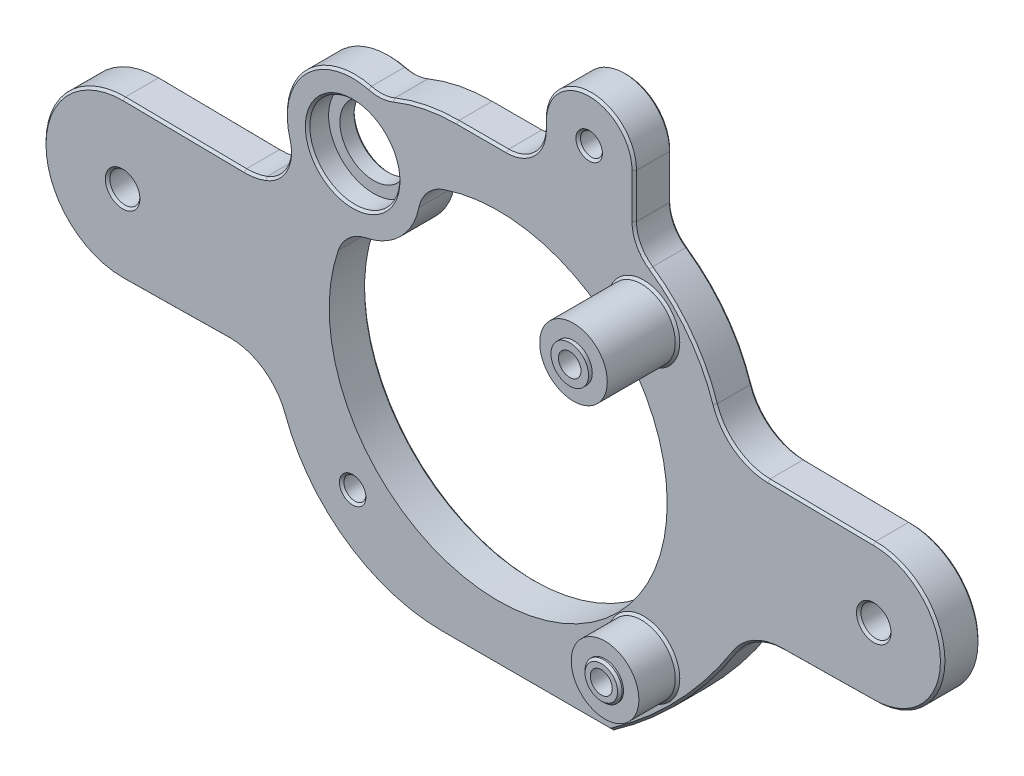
ISO-10303-21;
HEADER;
FILE_DESCRIPTION(('STEP AP214'),'2;1');
FILE_NAME('part.step','',(''),(''),'','','');
FILE_SCHEMA(('AUTOMOTIVE_DESIGN { 1 0 10303 214 1 1 1 1 }'));
ENDSEC;
DATA;
#1=APPLICATION_CONTEXT('core data for automotive mechanical design processes');
#2=APPLICATION_PROTOCOL_DEFINITION('international standard','automotive_design',2000,#1);
#3=PRODUCT_CONTEXT('',#1,'mechanical');
#4=PRODUCT('Part','Part','',(#3));
#5=PRODUCT_RELATED_PRODUCT_CATEGORY('part','',(#4));
#6=PRODUCT_DEFINITION_FORMATION('','',#4);
#7=PRODUCT_DEFINITION_CONTEXT('part definition',#1,'design');
#8=PRODUCT_DEFINITION('design','',#6,#7);
#9=PRODUCT_DEFINITION_SHAPE('','',#8);
#10=(LENGTH_UNIT() NAMED_UNIT(*) SI_UNIT(.MILLI.,.METRE.));
#11=(NAMED_UNIT(*) PLANE_ANGLE_UNIT() SI_UNIT($,.RADIAN.));
#12=(NAMED_UNIT(*) SI_UNIT($,.STERADIAN.) SOLID_ANGLE_UNIT());
#13=UNCERTAINTY_MEASURE_WITH_UNIT(LENGTH_MEASURE(1.E-05),#10,'distance_accuracy_value','');
#14=(GEOMETRIC_REPRESENTATION_CONTEXT(3) GLOBAL_UNCERTAINTY_ASSIGNED_CONTEXT((#13)) GLOBAL_UNIT_ASSIGNED_CONTEXT((#10,
#11,#12)) REPRESENTATION_CONTEXT('',''));
#15=CARTESIAN_POINT('',(0.,0.,0.));
#16=DIRECTION('',(0.,0.,1.));
#17=DIRECTION('',(1.,0.,0.));
#18=AXIS2_PLACEMENT_3D('',#15,#16,#17);
#19=CARTESIAN_POINT('',(38.7499999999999,38.7500000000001,29.7));
#20=DIRECTION('',(0.,0.,1.));
#21=DIRECTION('',(1.,0.,0.));
#22=AXIS2_PLACEMENT_3D('',#19,#20,#21);
#23=PLANE('',#22);
#24=CARTESIAN_POINT('',(38.7499999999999,38.7500000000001,29.7));
#25=DIRECTION('',(0.,0.,1.));
#26=DIRECTION('',(1.,0.,0.));
#27=AXIS2_PLACEMENT_3D('',#24,#25,#26);
#28=CIRCLE('',#27,3.);
#29=CARTESIAN_POINT('',(41.7499999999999,38.7500000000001,29.7));
#30=VERTEX_POINT('',#29);
#31=EDGE_CURVE('E490',#30,#30,#28,.T.);
#32=ORIENTED_EDGE('',*,*,#31,.F.);
#33=EDGE_LOOP('',(#32));
#34=FACE_BOUND('',#33,.T.);
#35=CARTESIAN_POINT('',(38.7499999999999,38.7500000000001,29.7));
#36=DIRECTION('',(0.,0.,1.));
#37=DIRECTION('',(1.,0.,0.));
#38=AXIS2_PLACEMENT_3D('',#35,#36,#37);
#39=CIRCLE('',#38,5.00000000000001);
#40=CARTESIAN_POINT('',(43.7499999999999,38.7500000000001,29.7));
#41=VERTEX_POINT('',#40);
#42=EDGE_CURVE('E798',#41,#41,#39,.T.);
#43=ORIENTED_EDGE('',*,*,#42,.T.);
#44=EDGE_LOOP('',(#43));
#45=FACE_BOUND('',#44,.T.);
#46=ADVANCED_FACE('F32',(#34,#45),#23,.T.);
#47=CARTESIAN_POINT('',(38.7499999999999,38.7500000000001,29.7));
#48=DIRECTION('',(0.,0.,-1.));
#49=DIRECTION('',(-1.,0.,0.));
#50=AXIS2_PLACEMENT_3D('',#47,#48,#49);
#51=CYLINDRICAL_SURFACE('',#50,9.);
#52=CARTESIAN_POINT('',(38.7499999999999,38.7500000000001,10.6000000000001));
#53=DIRECTION('',(0.,0.,1.));
#54=DIRECTION('',(1.,0.,0.));
#55=AXIS2_PLACEMENT_3D('',#52,#53,#54);
#56=CIRCLE('',#55,9.);
#57=CARTESIAN_POINT('',(47.7499999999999,38.7500000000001,10.6000000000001));
#58=VERTEX_POINT('',#57);
#59=EDGE_CURVE('E41',#58,#58,#56,.T.);
#60=ORIENTED_EDGE('',*,*,#59,.T.);
#61=EDGE_LOOP('',(#60));
#62=FACE_BOUND('',#61,.T.);
#63=CARTESIAN_POINT('',(38.7499999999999,38.7500000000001,28.7));
#64=DIRECTION('',(0.,0.,1.));
#65=DIRECTION('',(1.,0.,0.));
#66=AXIS2_PLACEMENT_3D('',#63,#64,#65);
#67=CIRCLE('',#66,9.);
#68=CARTESIAN_POINT('',(47.7499999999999,38.7500000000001,28.7));
#69=VERTEX_POINT('',#68);
#70=EDGE_CURVE('E2145',#69,#69,#67,.T.);
#71=ORIENTED_EDGE('',*,*,#70,.F.);
#72=EDGE_LOOP('',(#71));
#73=FACE_BOUND('',#72,.T.);
#74=ADVANCED_FACE('F1095',(#62,#73),#51,.T.);
#75=CARTESIAN_POINT('',(-38.7500000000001,38.7499999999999,10.));
#76=DIRECTION('',(0.,0.,-1.));
#77=DIRECTION('',(-1.,0.,0.));
#78=AXIS2_PLACEMENT_3D('',#75,#76,#77);
#79=CYLINDRICAL_SURFACE('',#78,9.);
#80=CARTESIAN_POINT('',(-38.7500000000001,38.7499999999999,0.600000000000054));
#81=DIRECTION('',(0.,0.,1.));
#82=DIRECTION('',(1.,0.,0.));
#83=AXIS2_PLACEMENT_3D('',#80,#81,#82);
#84=CIRCLE('',#83,9.);
#85=CARTESIAN_POINT('',(-29.7500000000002,38.7499999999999,0.600000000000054));
#86=VERTEX_POINT('',#85);
#87=EDGE_CURVE('E597',#86,#86,#84,.F.);
#88=ORIENTED_EDGE('',*,*,#87,.T.);
#89=EDGE_LOOP('',(#88));
#90=FACE_BOUND('',#89,.T.);
#91=CARTESIAN_POINT('',(-38.7500000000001,38.7499999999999,4.4));
#92=DIRECTION('',(0.,0.,1.));
#93=DIRECTION('',(1.,0.,0.));
#94=AXIS2_PLACEMENT_3D('',#91,#92,#93);
#95=CIRCLE('',#94,9.);
#96=CARTESIAN_POINT('',(-29.7500000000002,38.7499999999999,4.4));
#97=VERTEX_POINT('',#96);
#98=EDGE_CURVE('E487',#97,#97,#95,.T.);
#99=ORIENTED_EDGE('',*,*,#98,.T.);
#100=EDGE_LOOP('',(#99));
#101=FACE_BOUND('',#100,.T.);
#102=ADVANCED_FACE('F1101',(#90,#101),#79,.F.);
#103=CARTESIAN_POINT('',(-15.,-15.,10.));
#104=DIRECTION('',(0.,0.,1.));
#105=DIRECTION('',(1.,0.,0.));
#106=AXIS2_PLACEMENT_3D('',#103,#104,#105);
#107=PLANE('',#106);
#108=CARTESIAN_POINT('',(38.7499999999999,38.7500000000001,10.));
#109=DIRECTION('',(0.,0.,1.));
#110=DIRECTION('',(1.,0.,0.));
#111=AXIS2_PLACEMENT_3D('',#108,#109,#110);
#112=CIRCLE('',#111,2.925);
#113=CARTESIAN_POINT('',(41.6749999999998,38.7500000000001,10.));
#114=VERTEX_POINT('',#113);
#115=EDGE_CURVE('E386',#114,#114,#112,.T.);
#116=ORIENTED_EDGE('',*,*,#115,.F.);
#117=EDGE_LOOP('',(#116));
#118=FACE_BOUND('',#117,.T.);
#119=CARTESIAN_POINT('',(38.7499999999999,38.7500000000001,10.));
#120=DIRECTION('',(0.,0.,1.));
#121=DIRECTION('',(1.,0.,0.));
#122=AXIS2_PLACEMENT_3D('',#119,#120,#121);
#123=CIRCLE('',#122,3.);
#124=CARTESIAN_POINT('',(41.7499999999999,38.7500000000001,10.));
#125=VERTEX_POINT('',#124);
#126=EDGE_CURVE('E483',#125,#125,#123,.F.);
#127=ORIENTED_EDGE('',*,*,#126,.F.);
#128=EDGE_LOOP('',(#127));
#129=FACE_BOUND('',#128,.T.);
#130=ADVANCED_FACE('F1123',(#118,#129),#107,.T.);
#131=CARTESIAN_POINT('',(38.7500000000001,-38.7499999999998,21.3));
#132=DIRECTION('',(0.,0.,1.));
#133=DIRECTION('',(1.,0.,0.));
#134=AXIS2_PLACEMENT_3D('',#131,#132,#133);
#135=PLANE('',#134);
#136=CARTESIAN_POINT('',(38.7500000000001,-38.7499999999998,21.3));
#137=DIRECTION('',(0.,0.,1.));
#138=DIRECTION('',(1.,0.,0.));
#139=AXIS2_PLACEMENT_3D('',#136,#137,#138);
#140=CIRCLE('',#139,4.32499999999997);
#141=CARTESIAN_POINT('',(43.0750000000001,-38.7499999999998,21.3));
#142=VERTEX_POINT('',#141);
#143=EDGE_CURVE('E486',#142,#142,#140,.T.);
#144=ORIENTED_EDGE('',*,*,#143,.T.);
#145=EDGE_LOOP('',(#144));
#146=FACE_BOUND('',#145,.T.);
#147=CARTESIAN_POINT('',(38.7500000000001,-38.7499999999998,21.3));
#148=DIRECTION('',(0.,0.,1.));
#149=DIRECTION('',(1.,0.,0.));
#150=AXIS2_PLACEMENT_3D('',#147,#148,#149);
#151=CIRCLE('',#150,2.925);
#152=CARTESIAN_POINT('',(41.6750000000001,-38.7499999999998,21.3));
#153=VERTEX_POINT('',#152);
#154=EDGE_CURVE('E2131',#153,#153,#151,.T.);
#155=ORIENTED_EDGE('',*,*,#154,.F.);
#156=EDGE_LOOP('',(#155));
#157=FACE_BOUND('',#156,.T.);
#158=ADVANCED_FACE('F1119',(#146,#157),#135,.T.);
#159=CARTESIAN_POINT('',(38.7500000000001,-38.7499999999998,21.3));
#160=DIRECTION('',(0.,0.,-1.));
#161=DIRECTION('',(-1.,0.,0.));
#162=AXIS2_PLACEMENT_3D('',#159,#160,#161);
#163=CYLINDRICAL_SURFACE('',#162,9.);
#164=CARTESIAN_POINT('',(38.7500000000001,-38.7499999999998,10.6000000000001));
#165=DIRECTION('',(0.,0.,1.));
#166=DIRECTION('',(1.,0.,0.));
#167=AXIS2_PLACEMENT_3D('',#164,#165,#166);
#168=CIRCLE('',#167,9.);
#169=CARTESIAN_POINT('',(29.7500000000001,-38.7499999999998,10.6000000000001));
#170=VERTEX_POINT('',#169);
#171=EDGE_CURVE('E11',#170,#170,#168,.T.);
#172=CARTESIAN_POINT('',(38.7500000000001,-38.7499999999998,20.3));
#173=DIRECTION('',(0.,0.,1.));
#174=DIRECTION('',(1.,0.,0.));
#175=AXIS2_PLACEMENT_3D('',#172,#173,#174);
#176=CIRCLE('',#175,9.);
#177=CARTESIAN_POINT('',(29.7500000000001,-38.7499999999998,20.3));
#178=VERTEX_POINT('',#177);
#179=EDGE_CURVE('E2133',#178,#178,#176,.T.);
#180=CARTESIAN_POINT('',(29.7500000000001,-38.7499999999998,10.6000000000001));
#181=CARTESIAN_POINT('',(29.7500000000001,-38.7499999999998,10.7010416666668));
#182=CARTESIAN_POINT('',(29.7500000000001,-38.7499999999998,10.8020833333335));
#183=CARTESIAN_POINT('',(29.7500000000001,-38.7499999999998,11.0041666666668));
#184=CARTESIAN_POINT('',(29.7500000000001,-38.7499999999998,11.1052083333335));
#185=CARTESIAN_POINT('',(29.7500000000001,-38.7499999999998,11.3072916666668));
#186=CARTESIAN_POINT('',(29.7500000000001,-38.7499999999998,11.4083333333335));
#187=CARTESIAN_POINT('',(29.7500000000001,-38.7499999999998,11.6104166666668));
#188=CARTESIAN_POINT('',(29.7500000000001,-38.7499999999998,11.7114583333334));
#189=CARTESIAN_POINT('',(29.7500000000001,-38.7499999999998,11.9135416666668));
#190=CARTESIAN_POINT('',(29.7500000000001,-38.7499999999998,12.0145833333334));
#191=CARTESIAN_POINT('',(29.7500000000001,-38.7499999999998,12.2166666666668));
#192=CARTESIAN_POINT('',(29.7500000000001,-38.7499999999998,12.3177083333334));
#193=CARTESIAN_POINT('',(29.7500000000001,-38.7499999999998,12.5197916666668));
#194=CARTESIAN_POINT('',(29.7500000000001,-38.7499999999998,12.6208333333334));
#195=CARTESIAN_POINT('',(29.7500000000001,-38.7499999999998,12.8229166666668));
#196=CARTESIAN_POINT('',(29.7500000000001,-38.7499999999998,12.9239583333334));
#197=CARTESIAN_POINT('',(29.7500000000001,-38.7499999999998,13.1260416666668));
#198=CARTESIAN_POINT('',(29.7500000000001,-38.7499999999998,13.2270833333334));
#199=CARTESIAN_POINT('',(29.7500000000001,-38.7499999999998,13.4291666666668));
#200=CARTESIAN_POINT('',(29.7500000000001,-38.7499999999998,13.5302083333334));
#201=CARTESIAN_POINT('',(29.7500000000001,-38.7499999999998,13.7322916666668));
#202=CARTESIAN_POINT('',(29.7500000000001,-38.7499999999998,13.8333333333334));
#203=CARTESIAN_POINT('',(29.7500000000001,-38.7499999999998,14.0354166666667));
#204=CARTESIAN_POINT('',(29.7500000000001,-38.7499999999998,14.1364583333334));
#205=CARTESIAN_POINT('',(29.7500000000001,-38.7499999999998,14.3385416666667));
#206=CARTESIAN_POINT('',(29.7500000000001,-38.7499999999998,14.4395833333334));
#207=CARTESIAN_POINT('',(29.7500000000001,-38.7499999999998,14.6416666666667));
#208=CARTESIAN_POINT('',(29.7500000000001,-38.7499999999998,14.7427083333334));
#209=CARTESIAN_POINT('',(29.7500000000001,-38.7499999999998,14.9447916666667));
#210=CARTESIAN_POINT('',(29.7500000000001,-38.7499999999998,15.0458333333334));
#211=CARTESIAN_POINT('',(29.7500000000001,-38.7499999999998,15.2479166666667));
#212=CARTESIAN_POINT('',(29.7500000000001,-38.7499999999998,15.3489583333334));
#213=CARTESIAN_POINT('',(29.7500000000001,-38.7499999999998,15.5510416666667));
#214=CARTESIAN_POINT('',(29.7500000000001,-38.7499999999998,15.6520833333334));
#215=CARTESIAN_POINT('',(29.7500000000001,-38.7499999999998,15.8541666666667));
#216=CARTESIAN_POINT('',(29.7500000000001,-38.7499999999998,15.9552083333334));
#217=CARTESIAN_POINT('',(29.7500000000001,-38.7499999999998,16.1572916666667));
#218=CARTESIAN_POINT('',(29.7500000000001,-38.7499999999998,16.2583333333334));
#219=CARTESIAN_POINT('',(29.7500000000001,-38.7499999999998,16.4604166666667));
#220=CARTESIAN_POINT('',(29.7500000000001,-38.7499999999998,16.5614583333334));
#221=CARTESIAN_POINT('',(29.7500000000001,-38.7499999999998,16.7635416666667));
#222=CARTESIAN_POINT('',(29.7500000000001,-38.7499999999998,16.8645833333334));
#223=CARTESIAN_POINT('',(29.7500000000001,-38.7499999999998,17.0666666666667));
#224=CARTESIAN_POINT('',(29.7500000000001,-38.7499999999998,17.1677083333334));
#225=CARTESIAN_POINT('',(29.7500000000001,-38.7499999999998,17.3697916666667));
#226=CARTESIAN_POINT('',(29.7500000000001,-38.7499999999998,17.4708333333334));
#227=CARTESIAN_POINT('',(29.7500000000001,-38.7499999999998,17.6729166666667));
#228=CARTESIAN_POINT('',(29.7500000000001,-38.7499999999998,17.7739583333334));
#229=CARTESIAN_POINT('',(29.7500000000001,-38.7499999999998,17.9760416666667));
#230=CARTESIAN_POINT('',(29.7500000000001,-38.7499999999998,18.0770833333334));
#231=CARTESIAN_POINT('',(29.7500000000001,-38.7499999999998,18.2791666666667));
#232=CARTESIAN_POINT('',(29.7500000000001,-38.7499999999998,18.3802083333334));
#233=CARTESIAN_POINT('',(29.7500000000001,-38.7499999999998,18.5822916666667));
#234=CARTESIAN_POINT('',(29.7500000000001,-38.7499999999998,18.6833333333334));
#235=CARTESIAN_POINT('',(29.7500000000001,-38.7499999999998,18.8854166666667));
#236=CARTESIAN_POINT('',(29.7500000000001,-38.7499999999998,18.9864583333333));
#237=CARTESIAN_POINT('',(29.7500000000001,-38.7499999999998,19.1885416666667));
#238=CARTESIAN_POINT('',(29.7500000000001,-38.7499999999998,19.2895833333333));
#239=CARTESIAN_POINT('',(29.7500000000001,-38.7499999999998,19.4916666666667));
#240=CARTESIAN_POINT('',(29.7500000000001,-38.7499999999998,19.5927083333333));
#241=CARTESIAN_POINT('',(29.7500000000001,-38.7499999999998,19.7947916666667));
#242=CARTESIAN_POINT('',(29.7500000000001,-38.7499999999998,19.8958333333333));
#243=CARTESIAN_POINT('',(29.7500000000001,-38.7499999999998,20.0979166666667));
#244=CARTESIAN_POINT('',(29.7500000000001,-38.7499999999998,20.1989583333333));
#245=CARTESIAN_POINT('',(29.7500000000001,-38.7499999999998,20.3));
#246=B_SPLINE_CURVE_WITH_KNOTS('',3,(#180,#181,#182,#183,#184,#185,#186,#187,#188,#189,#190,
#191,#192,#193,#194,#195,#196,#197,#198,#199,#200,#201,#202,#203,#204,#205,#206,#207,#208,#209,
#210,#211,#212,#213,#214,#215,#216,#217,#218,#219,#220,#221,#222,#223,#224,#225,#226,#227,#228,
#229,#230,#231,#232,#233,#234,#235,#236,#237,#238,#239,#240,#241,#242,#243,#244,#245),
.UNSPECIFIED.,.F.,.F.,(4,2,2,2,2,2,2,2,2,2,2,2,2,2,2,2,2,2,2,2,2,2,2,2,2,2,2,2,2,2,2,2,4),(0.,
0.303124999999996,0.606249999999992,0.909374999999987,1.21249999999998,1.51562499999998,
1.81874999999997,2.12187499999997,2.42499999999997,2.72812499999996,3.03124999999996,
3.33437499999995,3.63749999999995,3.94062499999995,4.24374999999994,4.54687499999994,
4.84999999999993,5.15312499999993,5.45624999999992,5.75937499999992,6.06249999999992,
6.36562499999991,6.66874999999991,6.9718749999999,7.2749999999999,7.5781249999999,
7.88124999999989,8.18437499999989,8.48749999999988,8.79062499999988,9.09374999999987,
9.39687499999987,9.69999999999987),.UNSPECIFIED.);
#247=EDGE_CURVE('BSEAM1122',#170,#178,#246,.T.);
#248=ORIENTED_EDGE('',*,*,#171,.T.);
#249=ORIENTED_EDGE('',*,*,#179,.F.);
#250=ORIENTED_EDGE('',*,*,#247,.T.);
#251=ORIENTED_EDGE('',*,*,#247,.F.);
#252=EDGE_LOOP('',(#248,#250,#249,#251));
#253=FACE_BOUND('',#252,.T.);
#254=ADVANCED_FACE('F1122',(#253),#163,.T.);
#255=CARTESIAN_POINT('',(-38.7500000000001,38.7499999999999,10.));
#256=DIRECTION('',(0.,0.,1.));
#257=DIRECTION('',(1.,0.,0.));
#258=AXIS2_PLACEMENT_3D('',#255,#256,#257);
#259=CIRCLE('',#258,12.6);
#260=CARTESIAN_POINT('',(-26.1500000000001,38.7499999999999,10.));
#261=VERTEX_POINT('',#260);
#262=EDGE_CURVE('E782',#261,#261,#259,.F.);
#263=ORIENTED_EDGE('',*,*,#262,.T.);
#264=EDGE_LOOP('',(#263));
#265=FACE_BOUND('',#264,.T.);
#266=CARTESIAN_POINT('',(100.,0.,10.));
#267=DIRECTION('',(0.,0.,1.));
#268=DIRECTION('',(1.,0.,0.));
#269=AXIS2_PLACEMENT_3D('',#266,#267,#268);
#270=CIRCLE('',#269,4.59999999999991);
#271=CARTESIAN_POINT('',(104.6,0.,10.));
#272=VERTEX_POINT('',#271);
#273=EDGE_CURVE('E779',#272,#272,#270,.F.);
#274=ORIENTED_EDGE('',*,*,#273,.T.);
#275=EDGE_LOOP('',(#274));
#276=FACE_BOUND('',#275,.T.);
#277=CARTESIAN_POINT('',(-100.,0.,10.));
#278=DIRECTION('',(0.,0.,1.));
#279=DIRECTION('',(1.,0.,0.));
#280=AXIS2_PLACEMENT_3D('',#277,#278,#279);
#281=CIRCLE('',#280,4.59999999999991);
#282=CARTESIAN_POINT('',(-95.4000000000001,0.,10.));
#283=VERTEX_POINT('',#282);
#284=EDGE_CURVE('E776',#283,#283,#281,.F.);
#285=ORIENTED_EDGE('',*,*,#284,.T.);
#286=EDGE_LOOP('',(#285));
#287=FACE_BOUND('',#286,.T.);
#288=CARTESIAN_POINT('',(100.,0.,10.));
#289=DIRECTION('',(0.,0.,1.));
#290=DIRECTION('',(1.,0.,0.));
#291=AXIS2_PLACEMENT_3D('',#288,#289,#290);
#292=CIRCLE('',#291,17.7545765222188);
#293=CARTESIAN_POINT('',(99.8086540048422,-17.7535453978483,10.));
#294=VERTEX_POINT('',#293);
#295=CARTESIAN_POINT('',(99.8766560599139,17.7541480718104,10.));
#296=VERTEX_POINT('',#295);
#297=EDGE_CURVE('E760',#294,#296,#292,.T.);
#298=ORIENTED_EDGE('',*,*,#297,.T.);
#299=DIRECTION('',(-0.999912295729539,0.0132438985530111,0.));
#300=VECTOR('',#299,1.);
#301=CARTESIAN_POINT('',(71.7967777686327,18.1260677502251,10.));
#302=LINE('',#301,#300);
#303=CARTESIAN_POINT('',(71.7967777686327,18.1260677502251,10.));
#304=VERTEX_POINT('',#303);
#305=EDGE_CURVE('E49',#296,#304,#302,.T.);
#306=ORIENTED_EDGE('',*,*,#305,.T.);
#307=CARTESIAN_POINT('',(72.0033825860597,33.7246995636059,10.));
#308=DIRECTION('',(0.,0.,1.));
#309=DIRECTION('',(1.,0.,0.));
#310=AXIS2_PLACEMENT_3D('',#307,#308,#309);
#311=CIRCLE('',#310,15.6);
#312=CARTESIAN_POINT('',(57.1825031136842,28.8562776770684,10.));
#313=VERTEX_POINT('',#312);
#314=EDGE_CURVE('E53',#304,#313,#311,.F.);
#315=ORIENTED_EDGE('',*,*,#314,.T.);
#316=CARTESIAN_POINT('',(15.,15.,10.));
#317=DIRECTION('',(0.,0.,1.));
#318=DIRECTION('',(1.,0.,0.));
#319=AXIS2_PLACEMENT_3D('',#316,#317,#318);
#320=CIRCLE('',#319,44.4);
#321=CARTESIAN_POINT('',(40.2100877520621,51.5487547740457,10.));
#322=VERTEX_POINT('',#321);
#323=EDGE_CURVE('E772',#313,#322,#320,.T.);
#324=ORIENTED_EDGE('',*,*,#323,.T.);
#325=CARTESIAN_POINT('',(46.2287123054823,60.2743583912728,10.));
#326=DIRECTION('',(0.,0.,1.));
#327=DIRECTION('',(1.,0.,0.));
#328=AXIS2_PLACEMENT_3D('',#325,#326,#327);
#329=CIRCLE('',#328,10.6);
#330=CARTESIAN_POINT('',(35.6287123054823,60.2743583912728,10.));
#331=VERTEX_POINT('',#330);
#332=EDGE_CURVE('E770',#322,#331,#329,.F.);
#333=ORIENTED_EDGE('',*,*,#332,.T.);
#334=DIRECTION('',(0.,1.,0.));
#335=VECTOR('',#334,1.);
#336=CARTESIAN_POINT('',(35.6287123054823,72.0714285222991,10.));
#337=LINE('',#336,#335);
#338=CARTESIAN_POINT('',(35.6287123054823,72.0714285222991,10.));
#339=VERTEX_POINT('',#338);
#340=EDGE_CURVE('E768',#331,#339,#337,.T.);
#341=ORIENTED_EDGE('',*,*,#340,.T.);
#342=CARTESIAN_POINT('',(24.2287123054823,72.0714285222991,10.));
#343=DIRECTION('',(0.,0.,1.));
#344=DIRECTION('',(1.,0.,0.));
#345=AXIS2_PLACEMENT_3D('',#342,#343,#344);
#346=CIRCLE('',#345,11.4);
#347=CARTESIAN_POINT('',(12.8287123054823,72.0714285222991,10.));
#348=VERTEX_POINT('',#347);
#349=EDGE_CURVE('E766',#339,#348,#346,.T.);
#350=ORIENTED_EDGE('',*,*,#349,.T.);
#351=DIRECTION('',(0.,-1.,0.));
#352=VECTOR('',#351,1.);
#353=CARTESIAN_POINT('',(12.8287123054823,70.,10.));
#354=LINE('',#353,#352);
#355=CARTESIAN_POINT('',(12.8287123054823,70.,10.));
#356=VERTEX_POINT('',#355);
#357=EDGE_CURVE('E764',#348,#356,#354,.T.);
#358=ORIENTED_EDGE('',*,*,#357,.T.);
#359=CARTESIAN_POINT('',(2.22871230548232,70.,10.));
#360=DIRECTION('',(0.,0.,1.));
#361=DIRECTION('',(1.,0.,0.));
#362=AXIS2_PLACEMENT_3D('',#359,#360,#361);
#363=CIRCLE('',#362,10.6);
#364=CARTESIAN_POINT('',(2.22871230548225,59.4,10.));
#365=VERTEX_POINT('',#364);
#366=EDGE_CURVE('E762',#356,#365,#363,.F.);
#367=ORIENTED_EDGE('',*,*,#366,.T.);
#368=DIRECTION('',(-1.,0.,0.));
#369=VECTOR('',#368,1.);
#370=CARTESIAN_POINT('',(-11.0217151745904,59.4,10.));
#371=LINE('',#370,#369);
#372=CARTESIAN_POINT('',(-11.0217151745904,59.4,10.));
#373=VERTEX_POINT('',#372);
#374=EDGE_CURVE('E752',#365,#373,#371,.T.);
#375=ORIENTED_EDGE('',*,*,#374,.T.);
#376=CARTESIAN_POINT('',(-11.0217151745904,15.,10.));
#377=DIRECTION('',(0.,0.,1.));
#378=DIRECTION('',(1.,0.,0.));
#379=AXIS2_PLACEMENT_3D('',#376,#377,#378);
#380=CIRCLE('',#379,44.4);
#381=CARTESIAN_POINT('',(-27.8566994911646,56.0845871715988,10.));
#382=VERTEX_POINT('',#381);
#383=EDGE_CURVE('E750',#373,#382,#380,.T.);
#384=ORIENTED_EDGE('',*,*,#383,.T.);
#385=CARTESIAN_POINT('',(-31.87586241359,65.8930696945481,10.));
#386=DIRECTION('',(0.,0.,1.));
#387=DIRECTION('',(1.,0.,0.));
#388=AXIS2_PLACEMENT_3D('',#385,#386,#387);
#389=CIRCLE('',#388,10.6);
#390=CARTESIAN_POINT('',(-34.4782144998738,55.6174790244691,10.));
#391=VERTEX_POINT('',#390);
#392=EDGE_CURVE('E748',#382,#391,#389,.F.);
#393=ORIENTED_EDGE('',*,*,#392,.T.);
#394=CARTESIAN_POINT('',(-38.7500000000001,38.7499999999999,10.));
#395=DIRECTION('',(0.,0.,1.));
#396=DIRECTION('',(1.,0.,0.));
#397=AXIS2_PLACEMENT_3D('',#394,#395,#396);
#398=CIRCLE('',#397,17.4);
#399=CARTESIAN_POINT('',(-55.450580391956,33.8662909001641,10.));
#400=VERTEX_POINT('',#399);
#401=EDGE_CURVE('E746',#391,#400,#398,.T.);
#402=ORIENTED_EDGE('',*,*,#401,.T.);
#403=CARTESIAN_POINT('',(-65.6244971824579,30.891157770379,10.));
#404=DIRECTION('',(0.,0.,1.));
#405=DIRECTION('',(1.,0.,0.));
#406=AXIS2_PLACEMENT_3D('',#403,#404,#405);
#407=CIRCLE('',#406,10.6);
#408=CARTESIAN_POINT('',(-61.8918960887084,20.9700847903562,10.));
#409=VERTEX_POINT('',#408);
#410=EDGE_CURVE('E742',#400,#409,#407,.F.);
#411=ORIENTED_EDGE('',*,*,#410,.T.);
#412=CARTESIAN_POINT('',(-67.3851580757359,35.5709091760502,10.));
#413=DIRECTION('',(0.,0.,1.));
#414=DIRECTION('',(1.,0.,0.));
#415=AXIS2_PLACEMENT_3D('',#412,#413,#414);
#416=CIRCLE('',#415,15.6);
#417=CARTESIAN_POINT('',(-67.5917628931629,19.9722773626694,10.));
#418=VERTEX_POINT('',#417);
#419=EDGE_CURVE('E738',#409,#418,#416,.F.);
#420=ORIENTED_EDGE('',*,*,#419,.T.);
#421=DIRECTION('',(-0.999912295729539,0.0132438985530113,0.));
#422=VECTOR('',#421,1.);
#423=CARTESIAN_POINT('',(-99.8348957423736,20.3993395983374,10.));
#424=LINE('',#423,#422);
#425=CARTESIAN_POINT('',(-99.8348958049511,20.3993318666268,10.));
#426=VERTEX_POINT('',#425);
#427=EDGE_CURVE('E734',#418,#426,#424,.T.);
#428=ORIENTED_EDGE('',*,*,#427,.T.);
#429=CARTESIAN_POINT('',(-100.,0.,10.));
#430=DIRECTION('',(0.,0.,1.));
#431=DIRECTION('',(1.,0.,0.));
#432=AXIS2_PLACEMENT_3D('',#429,#430,#431);
#433=CIRCLE('',#432,20.4);
#434=CARTESIAN_POINT('',(-100.174500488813,-20.3992536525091,10.));
#435=VERTEX_POINT('',#434);
#436=EDGE_CURVE('E732',#426,#435,#433,.T.);
#437=ORIENTED_EDGE('',*,*,#436,.T.);
#438=DIRECTION('',(0.999912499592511,0.0132284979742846,0.));
#439=VECTOR('',#438,1.);
#440=CARTESIAN_POINT('',(-71.5521502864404,-20.0205898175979,10.));
#441=LINE('',#440,#439);
#442=CARTESIAN_POINT('',(-71.5521502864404,-20.0205898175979,10.));
#443=VERTEX_POINT('',#442);
#444=EDGE_CURVE('E730',#435,#443,#441,.T.);
#445=ORIENTED_EDGE('',*,*,#444,.T.);
#446=CARTESIAN_POINT('',(-71.3457857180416,-35.6192248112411,10.));
#447=DIRECTION('',(0.,0.,1.));
#448=DIRECTION('',(1.,0.,0.));
#449=AXIS2_PLACEMENT_3D('',#446,#447,#448);
#450=CIRCLE('',#449,15.6);
#451=CARTESIAN_POINT('',(-56.6958814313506,-30.2582263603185,10.));
#452=VERTEX_POINT('',#451);
#453=EDGE_CURVE('E736',#443,#452,#450,.F.);
#454=ORIENTED_EDGE('',*,*,#453,.T.);
#455=CARTESIAN_POINT('',(-15.,-15.,10.));
#456=DIRECTION('',(0.,0.,1.));
#457=DIRECTION('',(1.,0.,0.));
#458=AXIS2_PLACEMENT_3D('',#455,#456,#457);
#459=CIRCLE('',#458,44.3999999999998);
#460=CARTESIAN_POINT('',(-15.,-59.3999999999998,10.));
#461=VERTEX_POINT('',#460);
#462=EDGE_CURVE('E740',#452,#461,#459,.T.);
#463=ORIENTED_EDGE('',*,*,#462,.T.);
#464=DIRECTION('',(1.,0.,0.));
#465=VECTOR('',#464,1.);
#466=CARTESIAN_POINT('',(30.1201116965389,-59.4,10.));
#467=LINE('',#466,#465);
#468=CARTESIAN_POINT('',(29.9312913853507,-59.4,10.));
#469=VERTEX_POINT('',#468);
#470=EDGE_CURVE('E744',#461,#469,#467,.T.);
#471=ORIENTED_EDGE('',*,*,#470,.T.);
#472=CARTESIAN_POINT('',(-38.7500000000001,38.7499999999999,10.));
#473=DIRECTION('',(0.,0.,1.));
#474=DIRECTION('',(1.,0.,0.));
#475=AXIS2_PLACEMENT_3D('',#472,#473,#474);
#476=CIRCLE('',#475,119.793748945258);
#477=CARTESIAN_POINT('',(62.4641938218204,-25.329866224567,10.));
#478=VERTEX_POINT('',#477);
#479=EDGE_CURVE('E754',#469,#478,#476,.T.);
#480=ORIENTED_EDGE('',*,*,#479,.T.);
#481=CARTESIAN_POINT('',(75.644693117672,-33.6745914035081,10.));
#482=DIRECTION('',(0.,0.,1.));
#483=DIRECTION('',(1.,0.,0.));
#484=AXIS2_PLACEMENT_3D('',#481,#482,#483);
#485=CIRCLE('',#484,15.6);
#486=CARTESIAN_POINT('',(75.4383285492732,-18.075956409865,10.));
#487=VERTEX_POINT('',#486);
#488=EDGE_CURVE('E756',#478,#487,#485,.F.);
#489=ORIENTED_EDGE('',*,*,#488,.T.);
#490=DIRECTION('',(0.999912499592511,0.0132284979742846,0.));
#491=VECTOR('',#490,1.);
#492=CARTESIAN_POINT('',(99.8015122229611,-17.7536398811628,10.));
#493=LINE('',#492,#491);
#494=EDGE_CURVE('E758',#487,#294,#493,.T.);
#495=ORIENTED_EDGE('',*,*,#494,.T.);
#496=EDGE_LOOP('',(#298,#306,#315,#324,#333,#341,#350,#358,#367,#375,#384,#393,#402,#411,#420,
#428,#437,#445,#454,#463,#471,#480,#489,#495));
#497=FACE_BOUND('',#496,.T.);
#498=CARTESIAN_POINT('',(24.2287123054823,72.0714285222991,10.));
#499=DIRECTION('',(0.,0.,1.));
#500=DIRECTION('',(1.,0.,0.));
#501=AXIS2_PLACEMENT_3D('',#498,#499,#500);
#502=CIRCLE('',#501,3.525);
#503=CARTESIAN_POINT('',(27.7537123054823,72.0714285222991,10.));
#504=VERTEX_POINT('',#503);
#505=EDGE_CURVE('E727',#504,#504,#502,.F.);
#506=ORIENTED_EDGE('',*,*,#505,.T.);
#507=EDGE_LOOP('',(#506));
#508=FACE_BOUND('',#507,.T.);
#509=CARTESIAN_POINT('',(38.7499999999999,38.7500000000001,10.));
#510=DIRECTION('',(0.,0.,1.));
#511=DIRECTION('',(1.,0.,0.));
#512=AXIS2_PLACEMENT_3D('',#509,#510,#511);
#513=CIRCLE('',#512,9.60000000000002);
#514=CARTESIAN_POINT('',(48.3499999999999,38.7500000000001,10.));
#515=VERTEX_POINT('',#514);
#516=EDGE_CURVE('E724',#515,#515,#513,.F.);
#517=ORIENTED_EDGE('',*,*,#516,.T.);
#518=EDGE_LOOP('',(#517));
#519=FACE_BOUND('',#518,.T.);
#520=CARTESIAN_POINT('',(-38.7499999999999,-38.7500000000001,10.));
#521=DIRECTION('',(0.,0.,1.));
#522=DIRECTION('',(1.,0.,0.));
#523=AXIS2_PLACEMENT_3D('',#520,#521,#522);
#524=CIRCLE('',#523,3.52499999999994);
#525=CARTESIAN_POINT('',(-35.2249999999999,-38.7500000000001,10.));
#526=VERTEX_POINT('',#525);
#527=EDGE_CURVE('E721',#526,#526,#524,.F.);
#528=ORIENTED_EDGE('',*,*,#527,.T.);
#529=EDGE_LOOP('',(#528));
#530=FACE_BOUND('',#529,.T.);
#531=CARTESIAN_POINT('',(38.7500000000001,-38.7499999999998,10.));
#532=DIRECTION('',(0.,0.,1.));
#533=DIRECTION('',(1.,0.,0.));
#534=AXIS2_PLACEMENT_3D('',#531,#532,#533);
#535=CIRCLE('',#534,9.60000000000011);
#536=CARTESIAN_POINT('',(48.3500000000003,-38.7499999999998,10.));
#537=VERTEX_POINT('',#536);
#538=EDGE_CURVE('E718',#537,#537,#535,.F.);
#539=ORIENTED_EDGE('',*,*,#538,.T.);
#540=EDGE_LOOP('',(#539));
#541=FACE_BOUND('',#540,.T.);
#542=CARTESIAN_POINT('',(-38.7500000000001,38.7499999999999,10.));
#543=DIRECTION('',(0.,0.,-1.));
#544=DIRECTION('',(1.,0.,0.));
#545=AXIS2_PLACEMENT_3D('',#542,#543,#544);
#546=CIRCLE('',#545,18.);
#547=CARTESIAN_POINT('',(-21.1178761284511,35.1294741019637,10.));
#548=VERTEX_POINT('',#547);
#549=CARTESIAN_POINT('',(-35.1294741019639,21.1178761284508,10.));
#550=VERTEX_POINT('',#549);
#551=EDGE_CURVE('E385',#548,#550,#546,.T.);
#552=ORIENTED_EDGE('',*,*,#551,.F.);
#553=CARTESIAN_POINT('',(-11.3222517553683,33.1180708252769,10.));
#554=DIRECTION('',(0.,0.,1.));
#555=DIRECTION('',(1.,0.,0.));
#556=AXIS2_PLACEMENT_3D('',#553,#554,#555);
#557=CIRCLE('',#556,10.);
#558=CARTESIAN_POINT('',(-14.5571808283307,42.580376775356,10.));
#559=VERTEX_POINT('',#558);
#560=EDGE_CURVE('E375',#559,#548,#557,.T.);
#561=ORIENTED_EDGE('',*,*,#560,.F.);
#562=CARTESIAN_POINT('',(0.,0.,10.));
#563=DIRECTION('',(0.,0.,1.));
#564=DIRECTION('',(1.,0.,0.));
#565=AXIS2_PLACEMENT_3D('',#562,#563,#564);
#566=CIRCLE('',#565,45.);
#567=CARTESIAN_POINT('',(-42.5803767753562,14.5571808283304,10.));
#568=VERTEX_POINT('',#567);
#569=EDGE_CURVE('E402',#568,#559,#566,.T.);
#570=ORIENTED_EDGE('',*,*,#569,.F.);
#571=CARTESIAN_POINT('',(-33.118070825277,11.3222517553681,10.));
#572=DIRECTION('',(0.,0.,1.));
#573=DIRECTION('',(-1.,0.,0.));
#574=AXIS2_PLACEMENT_3D('',#571,#572,#573);
#575=CIRCLE('',#574,10.);
#576=EDGE_CURVE('E400',#550,#568,#575,.T.);
#577=ORIENTED_EDGE('',*,*,#576,.F.);
#578=EDGE_LOOP('',(#552,#561,#570,#577));
#579=FACE_BOUND('',#578,.T.);
#580=ADVANCED_FACE('F398',(#265,#276,#287,#497,#508,#519,#530,#541,#579),#107,.T.);
#581=CARTESIAN_POINT('',(-15.,-15.,0.));
#582=DIRECTION('',(0.,0.,1.));
#583=DIRECTION('',(1.,0.,0.));
#584=AXIS2_PLACEMENT_3D('',#581,#582,#583);
#585=PLANE('',#584);
#586=CARTESIAN_POINT('',(100.,0.,0.));
#587=DIRECTION('',(0.,0.,1.));
#588=DIRECTION('',(1.,0.,0.));
#589=AXIS2_PLACEMENT_3D('',#586,#587,#588);
#590=CIRCLE('',#589,4.60000000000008);
#591=CARTESIAN_POINT('',(104.6,0.,0.));
#592=VERTEX_POINT('',#591);
#593=EDGE_CURVE('E573',#592,#592,#590,.T.);
#594=ORIENTED_EDGE('',*,*,#593,.T.);
#595=EDGE_LOOP('',(#594));
#596=FACE_BOUND('',#595,.T.);
#597=CARTESIAN_POINT('',(-100.,0.,0.));
#598=DIRECTION('',(0.,0.,1.));
#599=DIRECTION('',(1.,0.,0.));
#600=AXIS2_PLACEMENT_3D('',#597,#598,#599);
#601=CIRCLE('',#600,4.60000000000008);
#602=CARTESIAN_POINT('',(-95.3999999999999,0.,0.));
#603=VERTEX_POINT('',#602);
#604=EDGE_CURVE('E570',#603,#603,#601,.T.);
#605=ORIENTED_EDGE('',*,*,#604,.T.);
#606=EDGE_LOOP('',(#605));
#607=FACE_BOUND('',#606,.T.);
#608=CARTESIAN_POINT('',(24.2287123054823,72.0714285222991,0.));
#609=DIRECTION('',(0.,0.,1.));
#610=DIRECTION('',(1.,0.,0.));
#611=AXIS2_PLACEMENT_3D('',#608,#609,#610);
#612=CIRCLE('',#611,3.52499999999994);
#613=CARTESIAN_POINT('',(20.7037123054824,72.0714285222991,0.));
#614=VERTEX_POINT('',#613);
#615=EDGE_CURVE('E567',#614,#614,#612,.T.);
#616=ORIENTED_EDGE('',*,*,#615,.T.);
#617=EDGE_LOOP('',(#616));
#618=FACE_BOUND('',#617,.T.);
#619=CARTESIAN_POINT('',(38.7499999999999,38.7500000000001,0.));
#620=DIRECTION('',(0.,0.,1.));
#621=DIRECTION('',(1.,0.,0.));
#622=AXIS2_PLACEMENT_3D('',#619,#620,#621);
#623=CIRCLE('',#622,3.52499999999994);
#624=CARTESIAN_POINT('',(42.2749999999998,38.7500000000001,0.));
#625=VERTEX_POINT('',#624);
#626=EDGE_CURVE('E564',#625,#625,#623,.T.);
#627=ORIENTED_EDGE('',*,*,#626,.T.);
#628=EDGE_LOOP('',(#627));
#629=FACE_BOUND('',#628,.T.);
#630=CARTESIAN_POINT('',(-38.7500000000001,38.7499999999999,0.));
#631=DIRECTION('',(0.,0.,1.));
#632=DIRECTION('',(1.,0.,0.));
#633=AXIS2_PLACEMENT_3D('',#630,#631,#632);
#634=CIRCLE('',#633,9.60000000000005);
#635=CARTESIAN_POINT('',(-29.1500000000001,38.7499999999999,0.));
#636=VERTEX_POINT('',#635);
#637=EDGE_CURVE('E561',#636,#636,#634,.T.);
#638=ORIENTED_EDGE('',*,*,#637,.T.);
#639=EDGE_LOOP('',(#638));
#640=FACE_BOUND('',#639,.T.);
#641=CARTESIAN_POINT('',(-33.118070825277,11.3222517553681,0.));
#642=DIRECTION('',(0.,0.,1.));
#643=DIRECTION('',(1.,0.,0.));
#644=AXIS2_PLACEMENT_3D('',#641,#642,#643);
#645=CIRCLE('',#644,10.6);
#646=CARTESIAN_POINT('',(-35.2501582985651,21.7056135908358,0.));
#647=VERTEX_POINT('',#646);
#648=CARTESIAN_POINT('',(-43.1481151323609,14.7512765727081,0.));
#649=VERTEX_POINT('',#648);
#650=EDGE_CURVE('E556',#647,#649,#645,.T.);
#651=ORIENTED_EDGE('',*,*,#650,.T.);
#652=CARTESIAN_POINT('',(0.,0.,0.));
#653=DIRECTION('',(0.,0.,1.));
#654=DIRECTION('',(1.,0.,0.));
#655=AXIS2_PLACEMENT_3D('',#652,#653,#654);
#656=CIRCLE('',#655,45.6);
#657=CARTESIAN_POINT('',(-14.7512765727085,43.1481151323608,0.));
#658=VERTEX_POINT('',#657);
#659=EDGE_CURVE('E558',#649,#658,#656,.T.);
#660=ORIENTED_EDGE('',*,*,#659,.T.);
#661=CARTESIAN_POINT('',(-11.3222517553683,33.1180708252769,0.));
#662=DIRECTION('',(0.,0.,1.));
#663=DIRECTION('',(1.,0.,0.));
#664=AXIS2_PLACEMENT_3D('',#661,#662,#663);
#665=CIRCLE('',#664,10.6);
#666=CARTESIAN_POINT('',(-21.7056135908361,35.2501582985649,0.));
#667=VERTEX_POINT('',#666);
#668=EDGE_CURVE('E552',#658,#667,#665,.T.);
#669=ORIENTED_EDGE('',*,*,#668,.T.);
#670=CARTESIAN_POINT('',(-38.7500000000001,38.7499999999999,0.));
#671=DIRECTION('',(0.,0.,1.));
#672=DIRECTION('',(1.,0.,0.));
#673=AXIS2_PLACEMENT_3D('',#670,#671,#672);
#674=CIRCLE('',#673,17.4);
#675=EDGE_CURVE('E554',#667,#647,#674,.F.);
#676=ORIENTED_EDGE('',*,*,#675,.T.);
#677=EDGE_LOOP('',(#651,#660,#669,#676));
#678=FACE_BOUND('',#677,.T.);
#679=CARTESIAN_POINT('',(-38.7500000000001,38.7499999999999,0.));
#680=DIRECTION('',(0.,0.,1.));
#681=DIRECTION('',(1.,0.,0.));
#682=AXIS2_PLACEMENT_3D('',#679,#680,#681);
#683=CIRCLE('',#682,119.793748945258);
#684=CARTESIAN_POINT('',(62.4641938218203,-25.329866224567,0.));
#685=VERTEX_POINT('',#684);
#686=CARTESIAN_POINT('',(29.9312913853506,-59.4,0.));
#687=VERTEX_POINT('',#686);
#688=EDGE_CURVE('E547',#685,#687,#683,.F.);
#689=ORIENTED_EDGE('',*,*,#688,.T.);
#690=DIRECTION('',(-1.,0.,0.));
#691=VECTOR('',#690,1.);
#692=CARTESIAN_POINT('',(-15.,-59.4,0.));
#693=LINE('',#692,#691);
#694=CARTESIAN_POINT('',(-15.,-59.3999999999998,0.));
#695=VERTEX_POINT('',#694);
#696=EDGE_CURVE('E549',#687,#695,#693,.T.);
#697=ORIENTED_EDGE('',*,*,#696,.T.);
#698=CARTESIAN_POINT('',(-15.,-15.,0.));
#699=DIRECTION('',(0.,0.,1.));
#700=DIRECTION('',(1.,0.,0.));
#701=AXIS2_PLACEMENT_3D('',#698,#699,#700);
#702=CIRCLE('',#701,44.3999999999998);
#703=CARTESIAN_POINT('',(-56.6958814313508,-30.2582263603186,0.));
#704=VERTEX_POINT('',#703);
#705=EDGE_CURVE('E503',#695,#704,#702,.F.);
#706=ORIENTED_EDGE('',*,*,#705,.T.);
#707=CARTESIAN_POINT('',(-71.3457857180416,-35.6192248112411,0.));
#708=DIRECTION('',(0.,0.,1.));
#709=DIRECTION('',(1.,0.,0.));
#710=AXIS2_PLACEMENT_3D('',#707,#708,#709);
#711=CIRCLE('',#710,15.6);
#712=CARTESIAN_POINT('',(-71.5521502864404,-20.0205898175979,0.));
#713=VERTEX_POINT('',#712);
#714=EDGE_CURVE('E505',#704,#713,#711,.T.);
#715=ORIENTED_EDGE('',*,*,#714,.T.);
#716=DIRECTION('',(-0.999912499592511,-0.0132284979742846,0.));
#717=VECTOR('',#716,1.);
#718=CARTESIAN_POINT('',(-14.9434871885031,-19.2716767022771,0.));
#719=LINE('',#718,#717);
#720=CARTESIAN_POINT('',(-100.174500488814,-20.3992536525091,0.));
#721=VERTEX_POINT('',#720);
#722=EDGE_CURVE('E507',#713,#721,#719,.T.);
#723=ORIENTED_EDGE('',*,*,#722,.T.);
#724=CARTESIAN_POINT('',(-100.,0.,0.));
#725=DIRECTION('',(0.,0.,1.));
#726=DIRECTION('',(1.,0.,0.));
#727=AXIS2_PLACEMENT_3D('',#724,#725,#726);
#728=CIRCLE('',#727,20.4);
#729=CARTESIAN_POINT('',(-99.8348958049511,20.3993318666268,0.));
#730=VERTEX_POINT('',#729);
#731=EDGE_CURVE('E509',#721,#730,#728,.F.);
#732=ORIENTED_EDGE('',*,*,#731,.T.);
#733=DIRECTION('',(0.999912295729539,-0.0132438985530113,0.));
#734=VECTOR('',#733,1.);
#735=CARTESIAN_POINT('',(-14.5460959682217,19.2696843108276,0.));
#736=LINE('',#735,#734);
#737=CARTESIAN_POINT('',(-67.5917628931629,19.9722773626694,0.));
#738=VERTEX_POINT('',#737);
#739=EDGE_CURVE('E511',#730,#738,#736,.T.);
#740=ORIENTED_EDGE('',*,*,#739,.T.);
#741=CARTESIAN_POINT('',(-67.3851580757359,35.5709091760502,0.));
#742=DIRECTION('',(0.,0.,1.));
#743=DIRECTION('',(1.,0.,0.));
#744=AXIS2_PLACEMENT_3D('',#741,#742,#743);
#745=CIRCLE('',#744,15.6);
#746=CARTESIAN_POINT('',(-61.8918960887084,20.9700847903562,0.));
#747=VERTEX_POINT('',#746);
#748=EDGE_CURVE('E513',#738,#747,#745,.T.);
#749=ORIENTED_EDGE('',*,*,#748,.T.);
#750=CARTESIAN_POINT('',(-65.6244971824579,30.891157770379,0.));
#751=DIRECTION('',(0.,0.,1.));
#752=DIRECTION('',(1.,0.,0.));
#753=AXIS2_PLACEMENT_3D('',#750,#751,#752);
#754=CIRCLE('',#753,10.6);
#755=CARTESIAN_POINT('',(-55.450580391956,33.8662909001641,0.));
#756=VERTEX_POINT('',#755);
#757=EDGE_CURVE('E515',#747,#756,#754,.T.);
#758=ORIENTED_EDGE('',*,*,#757,.T.);
#759=CARTESIAN_POINT('',(-38.7500000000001,38.7499999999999,0.));
#760=DIRECTION('',(0.,0.,1.));
#761=DIRECTION('',(1.,0.,0.));
#762=AXIS2_PLACEMENT_3D('',#759,#760,#761);
#763=CIRCLE('',#762,17.4);
#764=CARTESIAN_POINT('',(-34.4782144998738,55.6174790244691,0.));
#765=VERTEX_POINT('',#764);
#766=EDGE_CURVE('E517',#756,#765,#763,.F.);
#767=ORIENTED_EDGE('',*,*,#766,.T.);
#768=CARTESIAN_POINT('',(-31.87586241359,65.8930696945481,0.));
#769=DIRECTION('',(0.,0.,1.));
#770=DIRECTION('',(1.,0.,0.));
#771=AXIS2_PLACEMENT_3D('',#768,#769,#770);
#772=CIRCLE('',#771,10.6);
#773=CARTESIAN_POINT('',(-27.8566994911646,56.0845871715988,0.));
#774=VERTEX_POINT('',#773);
#775=EDGE_CURVE('E519',#765,#774,#772,.T.);
#776=ORIENTED_EDGE('',*,*,#775,.T.);
#777=CARTESIAN_POINT('',(-11.0217151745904,15.,0.));
#778=DIRECTION('',(0.,0.,1.));
#779=DIRECTION('',(1.,0.,0.));
#780=AXIS2_PLACEMENT_3D('',#777,#778,#779);
#781=CIRCLE('',#780,44.4);
#782=CARTESIAN_POINT('',(-11.0217151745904,59.4,0.));
#783=VERTEX_POINT('',#782);
#784=EDGE_CURVE('E521',#774,#783,#781,.F.);
#785=ORIENTED_EDGE('',*,*,#784,.T.);
#786=DIRECTION('',(1.,0.,0.));
#787=VECTOR('',#786,1.);
#788=CARTESIAN_POINT('',(-14.9999999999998,59.4,0.));
#789=LINE('',#788,#787);
#790=CARTESIAN_POINT('',(2.22871230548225,59.4,0.));
#791=VERTEX_POINT('',#790);
#792=EDGE_CURVE('E523',#783,#791,#789,.T.);
#793=ORIENTED_EDGE('',*,*,#792,.T.);
#794=CARTESIAN_POINT('',(2.22871230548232,70.,0.));
#795=DIRECTION('',(0.,0.,1.));
#796=DIRECTION('',(1.,0.,0.));
#797=AXIS2_PLACEMENT_3D('',#794,#795,#796);
#798=CIRCLE('',#797,10.6);
#799=CARTESIAN_POINT('',(12.8287123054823,70.,0.));
#800=VERTEX_POINT('',#799);
#801=EDGE_CURVE('E525',#791,#800,#798,.T.);
#802=ORIENTED_EDGE('',*,*,#801,.T.);
#803=DIRECTION('',(0.,1.,0.));
#804=VECTOR('',#803,1.);
#805=CARTESIAN_POINT('',(12.8287123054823,-15.,0.));
#806=LINE('',#805,#804);
#807=CARTESIAN_POINT('',(12.8287123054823,72.0714285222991,0.));
#808=VERTEX_POINT('',#807);
#809=EDGE_CURVE('E527',#800,#808,#806,.T.);
#810=ORIENTED_EDGE('',*,*,#809,.T.);
#811=CARTESIAN_POINT('',(24.2287123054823,72.0714285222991,0.));
#812=DIRECTION('',(0.,0.,1.));
#813=DIRECTION('',(1.,0.,0.));
#814=AXIS2_PLACEMENT_3D('',#811,#812,#813);
#815=CIRCLE('',#814,11.4);
#816=CARTESIAN_POINT('',(35.6287123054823,72.0714285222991,0.));
#817=VERTEX_POINT('',#816);
#818=EDGE_CURVE('E529',#808,#817,#815,.F.);
#819=ORIENTED_EDGE('',*,*,#818,.T.);
#820=DIRECTION('',(0.,-1.,0.));
#821=VECTOR('',#820,1.);
#822=CARTESIAN_POINT('',(35.6287123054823,-15.,0.));
#823=LINE('',#822,#821);
#824=CARTESIAN_POINT('',(35.6287123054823,60.2743583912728,0.));
#825=VERTEX_POINT('',#824);
#826=EDGE_CURVE('E531',#817,#825,#823,.T.);
#827=ORIENTED_EDGE('',*,*,#826,.T.);
#828=CARTESIAN_POINT('',(46.2287123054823,60.2743583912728,0.));
#829=DIRECTION('',(0.,0.,1.));
#830=DIRECTION('',(1.,0.,0.));
#831=AXIS2_PLACEMENT_3D('',#828,#829,#830);
#832=CIRCLE('',#831,10.6);
#833=CARTESIAN_POINT('',(40.2100877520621,51.5487547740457,0.));
#834=VERTEX_POINT('',#833);
#835=EDGE_CURVE('E533',#825,#834,#832,.T.);
#836=ORIENTED_EDGE('',*,*,#835,.T.);
#837=CARTESIAN_POINT('',(15.,15.,0.));
#838=DIRECTION('',(0.,0.,1.));
#839=DIRECTION('',(1.,0.,0.));
#840=AXIS2_PLACEMENT_3D('',#837,#838,#839);
#841=CIRCLE('',#840,44.4);
#842=CARTESIAN_POINT('',(57.1825031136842,28.8562776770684,0.));
#843=VERTEX_POINT('',#842);
#844=EDGE_CURVE('E535',#834,#843,#841,.F.);
#845=ORIENTED_EDGE('',*,*,#844,.T.);
#846=CARTESIAN_POINT('',(72.0033825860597,33.7246995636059,0.));
#847=DIRECTION('',(0.,0.,1.));
#848=DIRECTION('',(1.,0.,0.));
#849=AXIS2_PLACEMENT_3D('',#846,#847,#848);
#850=CIRCLE('',#849,15.6);
#851=CARTESIAN_POINT('',(71.7967777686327,18.1260677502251,0.));
#852=VERTEX_POINT('',#851);
#853=EDGE_CURVE('E537',#843,#852,#850,.T.);
#854=ORIENTED_EDGE('',*,*,#853,.T.);
#855=DIRECTION('',(0.999912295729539,-0.0132438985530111,0.));
#856=VECTOR('',#855,1.);
#857=CARTESIAN_POINT('',(-14.5460959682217,19.2696843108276,0.));
#858=LINE('',#857,#856);
#859=CARTESIAN_POINT('',(99.8766560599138,17.7541480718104,0.));
#860=VERTEX_POINT('',#859);
#861=EDGE_CURVE('E539',#852,#860,#858,.T.);
#862=ORIENTED_EDGE('',*,*,#861,.T.);
#863=CARTESIAN_POINT('',(100.,0.,0.));
#864=DIRECTION('',(0.,0.,1.));
#865=DIRECTION('',(1.,0.,0.));
#866=AXIS2_PLACEMENT_3D('',#863,#864,#865);
#867=CIRCLE('',#866,17.7545765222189);
#868=CARTESIAN_POINT('',(99.8086540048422,-17.7535453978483,0.));
#869=VERTEX_POINT('',#868);
#870=EDGE_CURVE('E541',#860,#869,#867,.F.);
#871=ORIENTED_EDGE('',*,*,#870,.T.);
#872=DIRECTION('',(-0.999912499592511,-0.0132284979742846,0.));
#873=VECTOR('',#872,1.);
#874=CARTESIAN_POINT('',(-14.9434871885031,-19.2716767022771,0.));
#875=LINE('',#874,#873);
#876=CARTESIAN_POINT('',(75.4383285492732,-18.0759564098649,0.));
#877=VERTEX_POINT('',#876);
#878=EDGE_CURVE('E543',#869,#877,#875,.T.);
#879=ORIENTED_EDGE('',*,*,#878,.T.);
#880=CARTESIAN_POINT('',(75.644693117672,-33.6745914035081,0.));
#881=DIRECTION('',(0.,0.,1.));
#882=DIRECTION('',(1.,0.,0.));
#883=AXIS2_PLACEMENT_3D('',#880,#881,#882);
#884=CIRCLE('',#883,15.6);
#885=EDGE_CURVE('E545',#877,#685,#884,.T.);
#886=ORIENTED_EDGE('',*,*,#885,.T.);
#887=EDGE_LOOP('',(#689,#697,#706,#715,#723,#732,#740,#749,#758,#767,#776,#785,#793,#802,#810,
#819,#827,#836,#845,#854,#862,#871,#879,#886));
#888=FACE_BOUND('',#887,.T.);
#889=CARTESIAN_POINT('',(38.7500000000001,-38.7499999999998,0.));
#890=DIRECTION('',(0.,0.,1.));
#891=DIRECTION('',(1.,0.,0.));
#892=AXIS2_PLACEMENT_3D('',#889,#890,#891);
#893=CIRCLE('',#892,3.52500000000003);
#894=CARTESIAN_POINT('',(42.2750000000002,-38.7499999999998,0.));
#895=VERTEX_POINT('',#894);
#896=EDGE_CURVE('E500',#895,#895,#893,.T.);
#897=ORIENTED_EDGE('',*,*,#896,.T.);
#898=EDGE_LOOP('',(#897));
#899=FACE_BOUND('',#898,.T.);
#900=CARTESIAN_POINT('',(-38.7499999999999,-38.7500000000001,0.));
#901=DIRECTION('',(0.,0.,1.));
#902=DIRECTION('',(1.,0.,0.));
#903=AXIS2_PLACEMENT_3D('',#900,#901,#902);
#904=CIRCLE('',#903,3.52499999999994);
#905=CARTESIAN_POINT('',(-35.2249999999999,-38.7500000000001,0.));
#906=VERTEX_POINT('',#905);
#907=EDGE_CURVE('E497',#906,#906,#904,.T.);
#908=ORIENTED_EDGE('',*,*,#907,.T.);
#909=EDGE_LOOP('',(#908));
#910=FACE_BOUND('',#909,.T.);
#911=ADVANCED_FACE('F1169',(#596,#607,#618,#629,#640,#678,#888,#899,#910),#585,.F.);
#912=CARTESIAN_POINT('',(-15.,-15.,10.));
#913=DIRECTION('',(0.,0.,-1.));
#914=DIRECTION('',(-1.,0.,0.));
#915=AXIS2_PLACEMENT_3D('',#912,#913,#914);
#916=CYLINDRICAL_SURFACE('',#915,44.9999999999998);
#917=DIRECTION('',(0.,0.,-1.));
#918=VECTOR('',#917,1.);
#919=CARTESIAN_POINT('',(-57.259339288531,-30.4644186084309,10.));
#920=LINE('',#919,#918);
#921=CARTESIAN_POINT('',(-57.259339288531,-30.4644186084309,9.39999999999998));
#922=VERTEX_POINT('',#921);
#923=CARTESIAN_POINT('',(-57.259339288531,-30.4644186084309,0.599999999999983));
#924=VERTEX_POINT('',#923);
#925=EDGE_CURVE('E394',#922,#924,#920,.T.);
#926=ORIENTED_EDGE('',*,*,#925,.T.);
#927=CARTESIAN_POINT('',(-15.,-15.,0.599999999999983));
#928=DIRECTION('',(0.,0.,1.));
#929=DIRECTION('',(1.,0.,0.));
#930=AXIS2_PLACEMENT_3D('',#927,#928,#929);
#931=CIRCLE('',#930,44.9999999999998);
#932=CARTESIAN_POINT('',(-15.,-60.,0.599999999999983));
#933=VERTEX_POINT('',#932);
#934=EDGE_CURVE('E704',#924,#933,#931,.T.);
#935=ORIENTED_EDGE('',*,*,#934,.T.);
#936=DIRECTION('',(0.,0.,-1.));
#937=VECTOR('',#936,1.);
#938=CARTESIAN_POINT('',(-15.,-60.,10.));
#939=LINE('',#938,#937);
#940=CARTESIAN_POINT('',(-15.,-60.,9.39999999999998));
#941=VERTEX_POINT('',#940);
#942=EDGE_CURVE('E480',#941,#933,#939,.T.);
#943=ORIENTED_EDGE('',*,*,#942,.F.);
#944=CARTESIAN_POINT('',(-15.,-15.,9.39999999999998));
#945=DIRECTION('',(0.,0.,1.));
#946=DIRECTION('',(1.,0.,0.));
#947=AXIS2_PLACEMENT_3D('',#944,#945,#946);
#948=CIRCLE('',#947,44.9999999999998);
#949=EDGE_CURVE('E702',#941,#922,#948,.F.);
#950=ORIENTED_EDGE('',*,*,#949,.T.);
#951=EDGE_LOOP('',(#926,#935,#943,#950));
#952=FACE_BOUND('',#951,.T.);
#953=ADVANCED_FACE('F1173',(#952),#916,.T.);
#954=CARTESIAN_POINT('',(-15.,-60.,10.));
#955=DIRECTION('',(0.,1.,0.));
#956=DIRECTION('',(-1.,0.,0.));
#957=AXIS2_PLACEMENT_3D('',#954,#955,#956);
#958=PLANE('',#957);
#959=ORIENTED_EDGE('',*,*,#942,.T.);
#960=DIRECTION('',(1.,0.,0.));
#961=VECTOR('',#960,1.);
#962=CARTESIAN_POINT('',(-15.,-60.,0.599999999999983));
#963=LINE('',#962,#961);
#964=CARTESIAN_POINT('',(30.1201116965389,-60.,0.599999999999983));
#965=VERTEX_POINT('',#964);
#966=EDGE_CURVE('E610',#933,#965,#963,.T.);
#967=ORIENTED_EDGE('',*,*,#966,.T.);
#968=DIRECTION('',(0.,0.,-1.));
#969=VECTOR('',#968,1.);
#970=CARTESIAN_POINT('',(30.1201116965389,-60.,10.));
#971=LINE('',#970,#969);
#972=CARTESIAN_POINT('',(30.1201116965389,-60.,9.39999999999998));
#973=VERTEX_POINT('',#972);
#974=EDGE_CURVE('E477',#973,#965,#971,.T.);
#975=ORIENTED_EDGE('',*,*,#974,.F.);
#976=DIRECTION('',(-1.,0.,0.));
#977=VECTOR('',#976,1.);
#978=CARTESIAN_POINT('',(-15.,-60.,9.39999999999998));
#979=LINE('',#978,#977);
#980=EDGE_CURVE('E608',#973,#941,#979,.T.);
#981=ORIENTED_EDGE('',*,*,#980,.T.);
#982=EDGE_LOOP('',(#959,#967,#975,#981));
#983=FACE_BOUND('',#982,.T.);
#984=ADVANCED_FACE('F1261',(#983),#958,.F.);
#985=CARTESIAN_POINT('',(-38.7500000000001,38.7499999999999,10.));
#986=DIRECTION('',(0.,0.,-1.));
#987=DIRECTION('',(-1.,0.,0.));
#988=AXIS2_PLACEMENT_3D('',#985,#986,#987);
#989=CYLINDRICAL_SURFACE('',#988,120.393748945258);
#990=ORIENTED_EDGE('',*,*,#974,.T.);
#991=CARTESIAN_POINT('',(-38.7500000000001,38.7499999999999,0.599999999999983));
#992=DIRECTION('',(0.,0.,1.));
#993=DIRECTION('',(1.,0.,0.));
#994=AXIS2_PLACEMENT_3D('',#991,#992,#993);
#995=CIRCLE('',#994,120.393748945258);
#996=CARTESIAN_POINT('',(62.97113610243,-25.6508171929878,0.599999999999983));
#997=VERTEX_POINT('',#996);
#998=EDGE_CURVE('E615',#965,#997,#995,.T.);
#999=ORIENTED_EDGE('',*,*,#998,.T.);
#1000=DIRECTION('',(0.,0.,-1.));
#1001=VECTOR('',#1000,1.);
#1002=CARTESIAN_POINT('',(62.97113610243,-25.6508171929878,10.));
#1003=LINE('',#1002,#1001);
#1004=CARTESIAN_POINT('',(62.97113610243,-25.6508171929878,9.40000000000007));
#1005=VERTEX_POINT('',#1004);
#1006=EDGE_CURVE('E474',#1005,#997,#1003,.T.);
#1007=ORIENTED_EDGE('',*,*,#1006,.F.);
#1008=CARTESIAN_POINT('',(-38.7500000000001,38.7499999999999,9.40000000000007));
#1009=DIRECTION('',(0.,0.,1.));
#1010=DIRECTION('',(1.,0.,0.));
#1011=AXIS2_PLACEMENT_3D('',#1008,#1009,#1010);
#1012=CIRCLE('',#1011,120.393748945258);
#1013=EDGE_CURVE('E613',#1005,#973,#1012,.F.);
#1014=ORIENTED_EDGE('',*,*,#1013,.T.);
#1015=EDGE_LOOP('',(#990,#999,#1007,#1014));
#1016=FACE_BOUND('',#1015,.T.);
#1017=ADVANCED_FACE('F1257',(#1016),#989,.T.);
#1018=CARTESIAN_POINT('',(75.644693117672,-33.6745914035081,10.));
#1019=DIRECTION('',(0.,0.,-1.));
#1020=DIRECTION('',(-1.,0.,0.));
#1021=AXIS2_PLACEMENT_3D('',#1018,#1019,#1020);
#1022=CYLINDRICAL_SURFACE('',#1021,15.);
#1023=ORIENTED_EDGE('',*,*,#1006,.T.);
#1024=CARTESIAN_POINT('',(75.644693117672,-33.6745914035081,0.599999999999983));
#1025=DIRECTION('',(0.,0.,1.));
#1026=DIRECTION('',(1.,0.,0.));
#1027=AXIS2_PLACEMENT_3D('',#1024,#1025,#1026);
#1028=CIRCLE('',#1027,15.);
#1029=CARTESIAN_POINT('',(75.4462656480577,-18.6759039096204,0.599999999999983));
#1030=VERTEX_POINT('',#1029);
#1031=EDGE_CURVE('E619',#997,#1030,#1028,.F.);
#1032=ORIENTED_EDGE('',*,*,#1031,.T.);
#1033=DIRECTION('',(0.,0.,-1.));
#1034=VECTOR('',#1033,1.);
#1035=CARTESIAN_POINT('',(75.4462656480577,-18.6759039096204,10.));
#1036=LINE('',#1035,#1034);
#1037=CARTESIAN_POINT('',(75.4462656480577,-18.6759039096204,9.40000000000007));
#1038=VERTEX_POINT('',#1037);
#1039=EDGE_CURVE('E471',#1038,#1030,#1036,.T.);
#1040=ORIENTED_EDGE('',*,*,#1039,.F.);
#1041=CARTESIAN_POINT('',(75.644693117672,-33.6745914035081,9.40000000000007));
#1042=DIRECTION('',(0.,0.,1.));
#1043=DIRECTION('',(1.,0.,0.));
#1044=AXIS2_PLACEMENT_3D('',#1041,#1042,#1043);
#1045=CIRCLE('',#1044,15.);
#1046=EDGE_CURVE('E617',#1038,#1005,#1045,.T.);
#1047=ORIENTED_EDGE('',*,*,#1046,.T.);
#1048=EDGE_LOOP('',(#1023,#1032,#1040,#1047));
#1049=FACE_BOUND('',#1048,.T.);
#1050=ADVANCED_FACE('F1253',(#1049),#1022,.F.);
#1051=CARTESIAN_POINT('',(99.8094493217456,-18.3535873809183,10.));
#1052=DIRECTION('',(-0.0132284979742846,0.999912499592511,0.));
#1053=DIRECTION('',(-0.999912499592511,-0.0132284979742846,0.));
#1054=AXIS2_PLACEMENT_3D('',#1051,#1052,#1053);
#1055=PLANE('',#1054);
#1056=ORIENTED_EDGE('',*,*,#1039,.T.);
#1057=DIRECTION('',(0.999912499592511,0.0132284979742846,0.));
#1058=VECTOR('',#1057,1.);
#1059=CARTESIAN_POINT('',(99.8094493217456,-18.3535873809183,0.599999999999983));
#1060=LINE('',#1059,#1058);
#1061=CARTESIAN_POINT('',(99.8094493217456,-18.3535873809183,0.599999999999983));
#1062=VERTEX_POINT('',#1061);
#1063=EDGE_CURVE('E623',#1030,#1062,#1060,.T.);
#1064=ORIENTED_EDGE('',*,*,#1063,.T.);
#1065=DIRECTION('',(0.,0.,-1.));
#1066=VECTOR('',#1065,1.);
#1067=CARTESIAN_POINT('',(99.8094493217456,-18.3535873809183,10.));
#1068=LINE('',#1067,#1066);
#1069=CARTESIAN_POINT('',(99.8094493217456,-18.3535873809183,9.39999999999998));
#1070=VERTEX_POINT('',#1069);
#1071=EDGE_CURVE('E468',#1070,#1062,#1068,.T.);
#1072=ORIENTED_EDGE('',*,*,#1071,.F.);
#1073=DIRECTION('',(-0.999912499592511,-0.0132284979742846,0.));
#1074=VECTOR('',#1073,1.);
#1075=CARTESIAN_POINT('',(75.4462656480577,-18.6759039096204,9.39999999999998));
#1076=LINE('',#1075,#1074);
#1077=EDGE_CURVE('E621',#1070,#1038,#1076,.T.);
#1078=ORIENTED_EDGE('',*,*,#1077,.T.);
#1079=EDGE_LOOP('',(#1056,#1064,#1072,#1078));
#1080=FACE_BOUND('',#1079,.T.);
#1081=ADVANCED_FACE('F1249',(#1080),#1055,.F.);
#1082=CARTESIAN_POINT('',(100.,0.,10.));
#1083=DIRECTION('',(0.,0.,-1.));
#1084=DIRECTION('',(-1.,0.,0.));
#1085=AXIS2_PLACEMENT_3D('',#1082,#1083,#1084);
#1086=CYLINDRICAL_SURFACE('',#1085,18.3545765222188);
#1087=ORIENTED_EDGE('',*,*,#1071,.T.);
#1088=CARTESIAN_POINT('',(100.,0.,0.599999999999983));
#1089=DIRECTION('',(0.,0.,1.));
#1090=DIRECTION('',(1.,0.,0.));
#1091=AXIS2_PLACEMENT_3D('',#1088,#1089,#1090);
#1092=CIRCLE('',#1091,18.3545765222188);
#1093=CARTESIAN_POINT('',(99.878595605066,18.354175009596,0.599999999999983));
#1094=VERTEX_POINT('',#1093);
#1095=EDGE_CURVE('E628',#1062,#1094,#1092,.T.);
#1096=ORIENTED_EDGE('',*,*,#1095,.T.);
#1097=DIRECTION('',(0.,0.,-1.));
#1098=VECTOR('',#1097,1.);
#1099=CARTESIAN_POINT('',(99.878595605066,18.354175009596,10.));
#1100=LINE('',#1099,#1098);
#1101=CARTESIAN_POINT('',(99.878595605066,18.354175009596,9.39999999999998));
#1102=VERTEX_POINT('',#1101);
#1103=EDGE_CURVE('E465',#1102,#1094,#1100,.T.);
#1104=ORIENTED_EDGE('',*,*,#1103,.F.);
#1105=CARTESIAN_POINT('',(100.,0.,9.39999999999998));
#1106=DIRECTION('',(0.,0.,1.));
#1107=DIRECTION('',(1.,0.,0.));
#1108=AXIS2_PLACEMENT_3D('',#1105,#1106,#1107);
#1109=CIRCLE('',#1108,18.3545765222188);
#1110=EDGE_CURVE('E625',#1102,#1070,#1109,.F.);
#1111=ORIENTED_EDGE('',*,*,#1110,.T.);
#1112=EDGE_LOOP('',(#1087,#1096,#1104,#1111));
#1113=FACE_BOUND('',#1112,.T.);
#1114=ADVANCED_FACE('F1245',(#1113),#1086,.T.);
#1115=CARTESIAN_POINT('',(99.8785956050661,18.354175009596,10.));
#1116=DIRECTION('',(-0.0132438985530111,-0.999912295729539,0.));
#1117=DIRECTION('',(0.999912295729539,-0.0132438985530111,0.));
#1118=AXIS2_PLACEMENT_3D('',#1115,#1116,#1117);
#1119=PLANE('',#1118);
#1120=ORIENTED_EDGE('',*,*,#1103,.T.);
#1121=DIRECTION('',(-0.999912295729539,0.0132438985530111,0.));
#1122=VECTOR('',#1121,1.);
#1123=CARTESIAN_POINT('',(99.8785956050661,18.354175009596,0.599999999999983));
#1124=LINE('',#1123,#1122);
#1125=CARTESIAN_POINT('',(71.8047241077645,18.7260151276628,0.599999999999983));
#1126=VERTEX_POINT('',#1125);
#1127=EDGE_CURVE('E632',#1094,#1126,#1124,.T.);
#1128=ORIENTED_EDGE('',*,*,#1127,.T.);
#1129=DIRECTION('',(0.,0.,-1.));
#1130=VECTOR('',#1129,1.);
#1131=CARTESIAN_POINT('',(71.8047241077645,18.7260151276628,10.));
#1132=LINE('',#1131,#1130);
#1133=CARTESIAN_POINT('',(71.8047241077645,18.7260151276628,9.39999999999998));
#1134=VERTEX_POINT('',#1133);
#1135=EDGE_CURVE('E462',#1134,#1126,#1132,.T.);
#1136=ORIENTED_EDGE('',*,*,#1135,.F.);
#1137=DIRECTION('',(0.999912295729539,-0.0132438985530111,0.));
#1138=VECTOR('',#1137,1.);
#1139=CARTESIAN_POINT('',(99.878595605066,18.354175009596,9.39999999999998));
#1140=LINE('',#1139,#1138);
#1141=EDGE_CURVE('E630',#1134,#1102,#1140,.T.);
#1142=ORIENTED_EDGE('',*,*,#1141,.T.);
#1143=EDGE_LOOP('',(#1120,#1128,#1136,#1142));
#1144=FACE_BOUND('',#1143,.T.);
#1145=ADVANCED_FACE('F1241',(#1144),#1119,.F.);
#1146=CARTESIAN_POINT('',(72.0033825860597,33.7246995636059,10.));
#1147=DIRECTION('',(0.,0.,-1.));
#1148=DIRECTION('',(-1.,0.,0.));
#1149=AXIS2_PLACEMENT_3D('',#1146,#1147,#1148);
#1150=CYLINDRICAL_SURFACE('',#1149,15.);
#1151=ORIENTED_EDGE('',*,*,#1135,.T.);
#1152=CARTESIAN_POINT('',(72.0033825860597,33.7246995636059,0.599999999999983));
#1153=DIRECTION('',(0.,0.,1.));
#1154=DIRECTION('',(1.,0.,0.));
#1155=AXIS2_PLACEMENT_3D('',#1152,#1153,#1154);
#1156=CIRCLE('',#1155,15.);
#1157=CARTESIAN_POINT('',(57.7525369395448,29.0435246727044,0.599999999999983));
#1158=VERTEX_POINT('',#1157);
#1159=EDGE_CURVE('E636',#1126,#1158,#1156,.F.);
#1160=ORIENTED_EDGE('',*,*,#1159,.T.);
#1161=DIRECTION('',(0.,0.,-1.));
#1162=VECTOR('',#1161,1.);
#1163=CARTESIAN_POINT('',(57.7525369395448,29.0435246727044,10.));
#1164=LINE('',#1163,#1162);
#1165=CARTESIAN_POINT('',(57.7525369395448,29.0435246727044,9.39999999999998));
#1166=VERTEX_POINT('',#1165);
#1167=EDGE_CURVE('E459',#1166,#1158,#1164,.T.);
#1168=ORIENTED_EDGE('',*,*,#1167,.F.);
#1169=CARTESIAN_POINT('',(72.0033825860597,33.7246995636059,9.39999999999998));
#1170=DIRECTION('',(0.,0.,1.));
#1171=DIRECTION('',(1.,0.,0.));
#1172=AXIS2_PLACEMENT_3D('',#1169,#1170,#1171);
#1173=CIRCLE('',#1172,15.);
#1174=EDGE_CURVE('E634',#1166,#1134,#1173,.T.);
#1175=ORIENTED_EDGE('',*,*,#1174,.T.);
#1176=EDGE_LOOP('',(#1151,#1160,#1168,#1175));
#1177=FACE_BOUND('',#1176,.T.);
#1178=ADVANCED_FACE('F1237',(#1177),#1150,.F.);
#1179=CARTESIAN_POINT('',(15.,15.,10.));
#1180=DIRECTION('',(0.,0.,-1.));
#1181=DIRECTION('',(-1.,0.,0.));
#1182=AXIS2_PLACEMENT_3D('',#1179,#1180,#1181);
#1183=CYLINDRICAL_SURFACE('',#1182,45.);
#1184=ORIENTED_EDGE('',*,*,#1167,.T.);
#1185=CARTESIAN_POINT('',(15.,15.,0.599999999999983));
#1186=DIRECTION('',(0.,0.,1.));
#1187=DIRECTION('',(1.,0.,0.));
#1188=AXIS2_PLACEMENT_3D('',#1185,#1186,#1187);
#1189=CIRCLE('',#1188,45.);
#1190=CARTESIAN_POINT('',(40.5507646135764,52.0426568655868,0.599999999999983));
#1191=VERTEX_POINT('',#1190);
#1192=EDGE_CURVE('E640',#1158,#1191,#1189,.T.);
#1193=ORIENTED_EDGE('',*,*,#1192,.T.);
#1194=DIRECTION('',(0.,0.,-1.));
#1195=VECTOR('',#1194,1.);
#1196=CARTESIAN_POINT('',(40.5507646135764,52.0426568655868,10.));
#1197=LINE('',#1196,#1195);
#1198=CARTESIAN_POINT('',(40.5507646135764,52.0426568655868,9.39999999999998));
#1199=VERTEX_POINT('',#1198);
#1200=EDGE_CURVE('E456',#1199,#1191,#1197,.T.);
#1201=ORIENTED_EDGE('',*,*,#1200,.F.);
#1202=CARTESIAN_POINT('',(15.,15.,9.39999999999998));
#1203=DIRECTION('',(0.,0.,1.));
#1204=DIRECTION('',(1.,0.,0.));
#1205=AXIS2_PLACEMENT_3D('',#1202,#1203,#1204);
#1206=CIRCLE('',#1205,45.);
#1207=EDGE_CURVE('E638',#1199,#1166,#1206,.F.);
#1208=ORIENTED_EDGE('',*,*,#1207,.T.);
#1209=EDGE_LOOP('',(#1184,#1193,#1201,#1208));
#1210=FACE_BOUND('',#1209,.T.);
#1211=ADVANCED_FACE('F1233',(#1210),#1183,.T.);
#1212=CARTESIAN_POINT('',(46.2287123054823,60.2743583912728,10.));
#1213=DIRECTION('',(0.,0.,-1.));
#1214=DIRECTION('',(-1.,0.,0.));
#1215=AXIS2_PLACEMENT_3D('',#1212,#1213,#1214);
#1216=CYLINDRICAL_SURFACE('',#1215,10.);
#1217=ORIENTED_EDGE('',*,*,#1200,.T.);
#1218=CARTESIAN_POINT('',(46.2287123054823,60.2743583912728,0.599999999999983));
#1219=DIRECTION('',(0.,0.,1.));
#1220=DIRECTION('',(1.,0.,0.));
#1221=AXIS2_PLACEMENT_3D('',#1218,#1219,#1220);
#1222=CIRCLE('',#1221,10.);
#1223=CARTESIAN_POINT('',(36.2287123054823,60.2743583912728,0.599999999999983));
#1224=VERTEX_POINT('',#1223);
#1225=EDGE_CURVE('E644',#1191,#1224,#1222,.F.);
#1226=ORIENTED_EDGE('',*,*,#1225,.T.);
#1227=DIRECTION('',(0.,0.,-1.));
#1228=VECTOR('',#1227,1.);
#1229=CARTESIAN_POINT('',(36.2287123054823,60.2743583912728,10.));
#1230=LINE('',#1229,#1228);
#1231=CARTESIAN_POINT('',(36.2287123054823,60.2743583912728,9.39999999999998));
#1232=VERTEX_POINT('',#1231);
#1233=EDGE_CURVE('E453',#1232,#1224,#1230,.T.);
#1234=ORIENTED_EDGE('',*,*,#1233,.F.);
#1235=CARTESIAN_POINT('',(46.2287123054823,60.2743583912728,9.39999999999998));
#1236=DIRECTION('',(0.,0.,1.));
#1237=DIRECTION('',(1.,0.,0.));
#1238=AXIS2_PLACEMENT_3D('',#1235,#1236,#1237);
#1239=CIRCLE('',#1238,10.);
#1240=EDGE_CURVE('E642',#1232,#1199,#1239,.T.);
#1241=ORIENTED_EDGE('',*,*,#1240,.T.);
#1242=EDGE_LOOP('',(#1217,#1226,#1234,#1241));
#1243=FACE_BOUND('',#1242,.T.);
#1244=ADVANCED_FACE('F1229',(#1243),#1216,.F.);
#1245=CARTESIAN_POINT('',(36.2287123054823,72.0714285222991,10.));
#1246=DIRECTION('',(-1.,0.,0.));
#1247=DIRECTION('',(0.,0.,1.));
#1248=AXIS2_PLACEMENT_3D('',#1245,#1246,#1247);
#1249=PLANE('',#1248);
#1250=ORIENTED_EDGE('',*,*,#1233,.T.);
#1251=DIRECTION('',(0.,1.,0.));
#1252=VECTOR('',#1251,1.);
#1253=CARTESIAN_POINT('',(36.2287123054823,72.0714285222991,0.599999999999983));
#1254=LINE('',#1253,#1252);
#1255=CARTESIAN_POINT('',(36.2287123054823,72.0714285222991,0.599999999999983));
#1256=VERTEX_POINT('',#1255);
#1257=EDGE_CURVE('E648',#1224,#1256,#1254,.T.);
#1258=ORIENTED_EDGE('',*,*,#1257,.T.);
#1259=DIRECTION('',(0.,0.,-1.));
#1260=VECTOR('',#1259,1.);
#1261=CARTESIAN_POINT('',(36.2287123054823,72.0714285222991,10.));
#1262=LINE('',#1261,#1260);
#1263=CARTESIAN_POINT('',(36.2287123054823,72.0714285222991,9.39999999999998));
#1264=VERTEX_POINT('',#1263);
#1265=EDGE_CURVE('E450',#1264,#1256,#1262,.T.);
#1266=ORIENTED_EDGE('',*,*,#1265,.F.);
#1267=DIRECTION('',(0.,-1.,0.));
#1268=VECTOR('',#1267,1.);
#1269=CARTESIAN_POINT('',(36.2287123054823,60.2743583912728,9.39999999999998));
#1270=LINE('',#1269,#1268);
#1271=EDGE_CURVE('E646',#1264,#1232,#1270,.T.);
#1272=ORIENTED_EDGE('',*,*,#1271,.T.);
#1273=EDGE_LOOP('',(#1250,#1258,#1266,#1272));
#1274=FACE_BOUND('',#1273,.T.);
#1275=ADVANCED_FACE('F1225',(#1274),#1249,.F.);
#1276=CARTESIAN_POINT('',(24.2287123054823,72.0714285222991,10.));
#1277=DIRECTION('',(0.,0.,-1.));
#1278=DIRECTION('',(-1.,0.,0.));
#1279=AXIS2_PLACEMENT_3D('',#1276,#1277,#1278);
#1280=CYLINDRICAL_SURFACE('',#1279,12.);
#1281=ORIENTED_EDGE('',*,*,#1265,.T.);
#1282=CARTESIAN_POINT('',(24.2287123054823,72.0714285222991,0.599999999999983));
#1283=DIRECTION('',(0.,0.,1.));
#1284=DIRECTION('',(1.,0.,0.));
#1285=AXIS2_PLACEMENT_3D('',#1282,#1283,#1284);
#1286=CIRCLE('',#1285,12.);
#1287=CARTESIAN_POINT('',(12.2287123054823,72.0714285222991,0.599999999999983));
#1288=VERTEX_POINT('',#1287);
#1289=EDGE_CURVE('E652',#1256,#1288,#1286,.T.);
#1290=ORIENTED_EDGE('',*,*,#1289,.T.);
#1291=DIRECTION('',(0.,0.,-1.));
#1292=VECTOR('',#1291,1.);
#1293=CARTESIAN_POINT('',(12.2287123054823,72.0714285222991,10.));
#1294=LINE('',#1293,#1292);
#1295=CARTESIAN_POINT('',(12.2287123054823,72.0714285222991,9.39999999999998));
#1296=VERTEX_POINT('',#1295);
#1297=EDGE_CURVE('E447',#1296,#1288,#1294,.T.);
#1298=ORIENTED_EDGE('',*,*,#1297,.F.);
#1299=CARTESIAN_POINT('',(24.2287123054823,72.0714285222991,9.39999999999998));
#1300=DIRECTION('',(0.,0.,1.));
#1301=DIRECTION('',(1.,0.,0.));
#1302=AXIS2_PLACEMENT_3D('',#1299,#1300,#1301);
#1303=CIRCLE('',#1302,12.);
#1304=EDGE_CURVE('E650',#1296,#1264,#1303,.F.);
#1305=ORIENTED_EDGE('',*,*,#1304,.T.);
#1306=EDGE_LOOP('',(#1281,#1290,#1298,#1305));
#1307=FACE_BOUND('',#1306,.T.);
#1308=ADVANCED_FACE('F1221',(#1307),#1280,.T.);
#1309=CARTESIAN_POINT('',(12.2287123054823,72.0714285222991,10.));
#1310=DIRECTION('',(1.,0.,0.));
#1311=DIRECTION('',(0.,0.,-1.));
#1312=AXIS2_PLACEMENT_3D('',#1309,#1310,#1311);
#1313=PLANE('',#1312);
#1314=ORIENTED_EDGE('',*,*,#1297,.T.);
#1315=DIRECTION('',(0.,-1.,0.));
#1316=VECTOR('',#1315,1.);
#1317=CARTESIAN_POINT('',(12.2287123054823,72.0714285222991,0.599999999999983));
#1318=LINE('',#1317,#1316);
#1319=CARTESIAN_POINT('',(12.2287123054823,70.,0.599999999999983));
#1320=VERTEX_POINT('',#1319);
#1321=EDGE_CURVE('E656',#1288,#1320,#1318,.T.);
#1322=ORIENTED_EDGE('',*,*,#1321,.T.);
#1323=DIRECTION('',(0.,0.,-1.));
#1324=VECTOR('',#1323,1.);
#1325=CARTESIAN_POINT('',(12.2287123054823,70.,10.));
#1326=LINE('',#1325,#1324);
#1327=CARTESIAN_POINT('',(12.2287123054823,70.,9.39999999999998));
#1328=VERTEX_POINT('',#1327);
#1329=EDGE_CURVE('E444',#1328,#1320,#1326,.T.);
#1330=ORIENTED_EDGE('',*,*,#1329,.F.);
#1331=DIRECTION('',(0.,1.,0.));
#1332=VECTOR('',#1331,1.);
#1333=CARTESIAN_POINT('',(12.2287123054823,72.0714285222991,9.39999999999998));
#1334=LINE('',#1333,#1332);
#1335=EDGE_CURVE('E654',#1328,#1296,#1334,.T.);
#1336=ORIENTED_EDGE('',*,*,#1335,.T.);
#1337=EDGE_LOOP('',(#1314,#1322,#1330,#1336));
#1338=FACE_BOUND('',#1337,.T.);
#1339=ADVANCED_FACE('F1217',(#1338),#1313,.F.);
#1340=CARTESIAN_POINT('',(2.22871230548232,70.,10.));
#1341=DIRECTION('',(0.,0.,-1.));
#1342=DIRECTION('',(-1.,0.,0.));
#1343=AXIS2_PLACEMENT_3D('',#1340,#1341,#1342);
#1344=CYLINDRICAL_SURFACE('',#1343,10.);
#1345=ORIENTED_EDGE('',*,*,#1329,.T.);
#1346=CARTESIAN_POINT('',(2.22871230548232,70.,0.599999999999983));
#1347=DIRECTION('',(0.,0.,1.));
#1348=DIRECTION('',(1.,0.,0.));
#1349=AXIS2_PLACEMENT_3D('',#1346,#1347,#1348);
#1350=CIRCLE('',#1349,10.);
#1351=CARTESIAN_POINT('',(2.22871230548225,60.,0.599999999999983));
#1352=VERTEX_POINT('',#1351);
#1353=EDGE_CURVE('E660',#1320,#1352,#1350,.F.);
#1354=ORIENTED_EDGE('',*,*,#1353,.T.);
#1355=DIRECTION('',(0.,0.,-1.));
#1356=VECTOR('',#1355,1.);
#1357=CARTESIAN_POINT('',(2.22871230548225,60.,10.));
#1358=LINE('',#1357,#1356);
#1359=CARTESIAN_POINT('',(2.22871230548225,60.,9.39999999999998));
#1360=VERTEX_POINT('',#1359);
#1361=EDGE_CURVE('E441',#1360,#1352,#1358,.T.);
#1362=ORIENTED_EDGE('',*,*,#1361,.F.);
#1363=CARTESIAN_POINT('',(2.22871230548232,70.,9.39999999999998));
#1364=DIRECTION('',(0.,0.,1.));
#1365=DIRECTION('',(1.,0.,0.));
#1366=AXIS2_PLACEMENT_3D('',#1363,#1364,#1365);
#1367=CIRCLE('',#1366,10.);
#1368=EDGE_CURVE('E658',#1360,#1328,#1367,.T.);
#1369=ORIENTED_EDGE('',*,*,#1368,.T.);
#1370=EDGE_LOOP('',(#1345,#1354,#1362,#1369));
#1371=FACE_BOUND('',#1370,.T.);
#1372=ADVANCED_FACE('F1213',(#1371),#1344,.F.);
#1373=CARTESIAN_POINT('',(2.22871230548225,60.,10.));
#1374=DIRECTION('',(0.,-1.,0.));
#1375=DIRECTION('',(1.,0.,0.));
#1376=AXIS2_PLACEMENT_3D('',#1373,#1374,#1375);
#1377=PLANE('',#1376);
#1378=ORIENTED_EDGE('',*,*,#1361,.T.);
#1379=DIRECTION('',(-1.,0.,0.));
#1380=VECTOR('',#1379,1.);
#1381=CARTESIAN_POINT('',(2.22871230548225,60.,0.599999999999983));
#1382=LINE('',#1381,#1380);
#1383=CARTESIAN_POINT('',(-11.0217151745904,60.,0.599999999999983));
#1384=VERTEX_POINT('',#1383);
#1385=EDGE_CURVE('E664',#1352,#1384,#1382,.T.);
#1386=ORIENTED_EDGE('',*,*,#1385,.T.);
#1387=DIRECTION('',(0.,0.,-1.));
#1388=VECTOR('',#1387,1.);
#1389=CARTESIAN_POINT('',(-11.0217151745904,60.,10.));
#1390=LINE('',#1389,#1388);
#1391=CARTESIAN_POINT('',(-11.0217151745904,60.,9.39999999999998));
#1392=VERTEX_POINT('',#1391);
#1393=EDGE_CURVE('E438',#1392,#1384,#1390,.T.);
#1394=ORIENTED_EDGE('',*,*,#1393,.F.);
#1395=DIRECTION('',(1.,0.,0.));
#1396=VECTOR('',#1395,1.);
#1397=CARTESIAN_POINT('',(2.22871230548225,60.,9.40000000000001));
#1398=LINE('',#1397,#1396);
#1399=EDGE_CURVE('E662',#1392,#1360,#1398,.T.);
#1400=ORIENTED_EDGE('',*,*,#1399,.T.);
#1401=EDGE_LOOP('',(#1378,#1386,#1394,#1400));
#1402=FACE_BOUND('',#1401,.T.);
#1403=ADVANCED_FACE('F1209',(#1402),#1377,.F.);
#1404=CARTESIAN_POINT('',(-11.0217151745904,15.,10.));
#1405=DIRECTION('',(0.,0.,-1.));
#1406=DIRECTION('',(-1.,0.,0.));
#1407=AXIS2_PLACEMENT_3D('',#1404,#1405,#1406);
#1408=CYLINDRICAL_SURFACE('',#1407,45.);
#1409=ORIENTED_EDGE('',*,*,#1393,.T.);
#1410=CARTESIAN_POINT('',(-11.0217151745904,15.,0.599999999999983));
#1411=DIRECTION('',(0.,0.,1.));
#1412=DIRECTION('',(1.,0.,0.));
#1413=AXIS2_PLACEMENT_3D('',#1410,#1411,#1412);
#1414=CIRCLE('',#1413,45.);
#1415=CARTESIAN_POINT('',(-28.0841992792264,56.6397842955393,0.599999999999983));
#1416=VERTEX_POINT('',#1415);
#1417=EDGE_CURVE('E668',#1384,#1416,#1414,.T.);
#1418=ORIENTED_EDGE('',*,*,#1417,.T.);
#1419=DIRECTION('',(0.,0.,-1.));
#1420=VECTOR('',#1419,1.);
#1421=CARTESIAN_POINT('',(-28.0841992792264,56.6397842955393,10.));
#1422=LINE('',#1421,#1420);
#1423=CARTESIAN_POINT('',(-28.0841992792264,56.6397842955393,9.39999999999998));
#1424=VERTEX_POINT('',#1423);
#1425=EDGE_CURVE('E435',#1424,#1416,#1422,.T.);
#1426=ORIENTED_EDGE('',*,*,#1425,.F.);
#1427=CARTESIAN_POINT('',(-11.0217151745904,15.,9.39999999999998));
#1428=DIRECTION('',(0.,0.,1.));
#1429=DIRECTION('',(1.,0.,0.));
#1430=AXIS2_PLACEMENT_3D('',#1427,#1428,#1429);
#1431=CIRCLE('',#1430,45.);
#1432=EDGE_CURVE('E666',#1424,#1392,#1431,.F.);
#1433=ORIENTED_EDGE('',*,*,#1432,.T.);
#1434=EDGE_LOOP('',(#1409,#1418,#1426,#1433));
#1435=FACE_BOUND('',#1434,.T.);
#1436=ADVANCED_FACE('F1205',(#1435),#1408,.T.);
#1437=CARTESIAN_POINT('',(-31.87586241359,65.8930696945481,10.));
#1438=DIRECTION('',(0.,0.,-1.));
#1439=DIRECTION('',(-1.,0.,0.));
#1440=AXIS2_PLACEMENT_3D('',#1437,#1438,#1439);
#1441=CYLINDRICAL_SURFACE('',#1440,10.);
#1442=ORIENTED_EDGE('',*,*,#1425,.T.);
#1443=CARTESIAN_POINT('',(-31.87586241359,65.8930696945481,0.599999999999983));
#1444=DIRECTION('',(0.,0.,1.));
#1445=DIRECTION('',(1.,0.,0.));
#1446=AXIS2_PLACEMENT_3D('',#1443,#1444,#1445);
#1447=CIRCLE('',#1446,10.);
#1448=CARTESIAN_POINT('',(-34.3309115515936,56.1991162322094,0.599999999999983));
#1449=VERTEX_POINT('',#1448);
#1450=EDGE_CURVE('E672',#1416,#1449,#1447,.F.);
#1451=ORIENTED_EDGE('',*,*,#1450,.T.);
#1452=DIRECTION('',(0.,0.,-1.));
#1453=VECTOR('',#1452,1.);
#1454=CARTESIAN_POINT('',(-34.3309115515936,56.1991162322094,10.));
#1455=LINE('',#1454,#1453);
#1456=CARTESIAN_POINT('',(-34.3309115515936,56.1991162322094,9.39999999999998));
#1457=VERTEX_POINT('',#1456);
#1458=EDGE_CURVE('E432',#1457,#1449,#1455,.T.);
#1459=ORIENTED_EDGE('',*,*,#1458,.F.);
#1460=CARTESIAN_POINT('',(-31.87586241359,65.8930696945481,9.39999999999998));
#1461=DIRECTION('',(0.,0.,1.));
#1462=DIRECTION('',(1.,0.,0.));
#1463=AXIS2_PLACEMENT_3D('',#1460,#1461,#1462);
#1464=CIRCLE('',#1463,10.);
#1465=EDGE_CURVE('E670',#1457,#1424,#1464,.T.);
#1466=ORIENTED_EDGE('',*,*,#1465,.T.);
#1467=EDGE_LOOP('',(#1442,#1451,#1459,#1466));
#1468=FACE_BOUND('',#1467,.T.);
#1469=ADVANCED_FACE('F1201',(#1468),#1441,.F.);
#1470=CARTESIAN_POINT('',(-38.7500000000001,38.7499999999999,10.));
#1471=DIRECTION('',(0.,0.,-1.));
#1472=DIRECTION('',(-1.,0.,0.));
#1473=AXIS2_PLACEMENT_3D('',#1470,#1471,#1472);
#1474=CYLINDRICAL_SURFACE('',#1473,18.);
#1475=ORIENTED_EDGE('',*,*,#1458,.T.);
#1476=CARTESIAN_POINT('',(-38.7500000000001,38.7499999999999,0.599999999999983));
#1477=DIRECTION('',(0.,0.,1.));
#1478=DIRECTION('',(1.,0.,0.));
#1479=AXIS2_PLACEMENT_3D('',#1476,#1477,#1478);
#1480=CIRCLE('',#1479,18.);
#1481=CARTESIAN_POINT('',(-56.0264624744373,33.6978871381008,0.599999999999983));
#1482=VERTEX_POINT('',#1481);
#1483=EDGE_CURVE('E676',#1449,#1482,#1480,.T.);
#1484=ORIENTED_EDGE('',*,*,#1483,.T.);
#1485=DIRECTION('',(0.,0.,-1.));
#1486=VECTOR('',#1485,1.);
#1487=CARTESIAN_POINT('',(-56.0264624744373,33.6978871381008,10.));
#1488=LINE('',#1487,#1486);
#1489=CARTESIAN_POINT('',(-56.0264624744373,33.6978871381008,9.39999999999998));
#1490=VERTEX_POINT('',#1489);
#1491=EDGE_CURVE('E429',#1490,#1482,#1488,.T.);
#1492=ORIENTED_EDGE('',*,*,#1491,.F.);
#1493=CARTESIAN_POINT('',(-38.7500000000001,38.7499999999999,9.39999999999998));
#1494=DIRECTION('',(0.,0.,1.));
#1495=DIRECTION('',(1.,0.,0.));
#1496=AXIS2_PLACEMENT_3D('',#1493,#1494,#1495);
#1497=CIRCLE('',#1496,18.);
#1498=EDGE_CURVE('E674',#1490,#1457,#1497,.F.);
#1499=ORIENTED_EDGE('',*,*,#1498,.T.);
#1500=EDGE_LOOP('',(#1475,#1484,#1492,#1499));
#1501=FACE_BOUND('',#1500,.T.);
#1502=ADVANCED_FACE('F1197',(#1501),#1474,.T.);
#1503=CARTESIAN_POINT('',(-65.6244971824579,30.891157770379,10.));
#1504=DIRECTION('',(0.,0.,-1.));
#1505=DIRECTION('',(-1.,0.,0.));
#1506=AXIS2_PLACEMENT_3D('',#1503,#1504,#1505);
#1507=CYLINDRICAL_SURFACE('',#1506,10.);
#1508=ORIENTED_EDGE('',*,*,#1491,.T.);
#1509=CARTESIAN_POINT('',(-65.6244971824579,30.891157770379,0.599999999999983));
#1510=DIRECTION('',(0.,0.,1.));
#1511=DIRECTION('',(1.,0.,0.));
#1512=AXIS2_PLACEMENT_3D('',#1509,#1510,#1511);
#1513=CIRCLE('',#1512,10.);
#1514=CARTESIAN_POINT('',(-62.1031753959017,21.5316549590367,0.599999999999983));
#1515=VERTEX_POINT('',#1514);
#1516=EDGE_CURVE('E680',#1482,#1515,#1513,.F.);
#1517=ORIENTED_EDGE('',*,*,#1516,.T.);
#1518=DIRECTION('',(0.,0.,-1.));
#1519=VECTOR('',#1518,1.);
#1520=CARTESIAN_POINT('',(-62.1031753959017,21.5316549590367,10.));
#1521=LINE('',#1520,#1519);
#1522=CARTESIAN_POINT('',(-62.1031753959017,21.5316549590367,9.39999999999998));
#1523=VERTEX_POINT('',#1522);
#1524=EDGE_CURVE('E426',#1523,#1515,#1521,.T.);
#1525=ORIENTED_EDGE('',*,*,#1524,.F.);
#1526=CARTESIAN_POINT('',(-65.6244971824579,30.891157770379,9.39999999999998));
#1527=DIRECTION('',(0.,0.,1.));
#1528=DIRECTION('',(1.,0.,0.));
#1529=AXIS2_PLACEMENT_3D('',#1526,#1527,#1528);
#1530=CIRCLE('',#1529,10.);
#1531=EDGE_CURVE('E678',#1523,#1490,#1530,.T.);
#1532=ORIENTED_EDGE('',*,*,#1531,.T.);
#1533=EDGE_LOOP('',(#1508,#1517,#1525,#1532));
#1534=FACE_BOUND('',#1533,.T.);
#1535=ADVANCED_FACE('F1193',(#1534),#1507,.F.);
#1536=CARTESIAN_POINT('',(-67.3851580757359,35.5709091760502,10.));
#1537=DIRECTION('',(0.,0.,-1.));
#1538=DIRECTION('',(-1.,0.,0.));
#1539=AXIS2_PLACEMENT_3D('',#1536,#1537,#1538);
#1540=CYLINDRICAL_SURFACE('',#1539,15.);
#1541=ORIENTED_EDGE('',*,*,#1524,.T.);
#1542=CARTESIAN_POINT('',(-67.3851580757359,35.5709091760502,0.599999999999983));
#1543=DIRECTION('',(0.,0.,1.));
#1544=DIRECTION('',(1.,0.,0.));
#1545=AXIS2_PLACEMENT_3D('',#1542,#1543,#1544);
#1546=CIRCLE('',#1545,15.);
#1547=CARTESIAN_POINT('',(-67.5838165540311,20.5722247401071,0.599999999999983));
#1548=VERTEX_POINT('',#1547);
#1549=EDGE_CURVE('E684',#1515,#1548,#1546,.F.);
#1550=ORIENTED_EDGE('',*,*,#1549,.T.);
#1551=DIRECTION('',(0.,0.,-1.));
#1552=VECTOR('',#1551,1.);
#1553=CARTESIAN_POINT('',(-67.5838165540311,20.5722247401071,10.));
#1554=LINE('',#1553,#1552);
#1555=CARTESIAN_POINT('',(-67.5838165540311,20.5722247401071,9.39999999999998));
#1556=VERTEX_POINT('',#1555);
#1557=EDGE_CURVE('E423',#1556,#1548,#1554,.T.);
#1558=ORIENTED_EDGE('',*,*,#1557,.F.);
#1559=CARTESIAN_POINT('',(-67.3851580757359,35.5709091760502,9.39999999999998));
#1560=DIRECTION('',(0.,0.,1.));
#1561=DIRECTION('',(1.,0.,0.));
#1562=AXIS2_PLACEMENT_3D('',#1559,#1560,#1561);
#1563=CIRCLE('',#1562,15.);
#1564=EDGE_CURVE('E682',#1556,#1523,#1563,.T.);
#1565=ORIENTED_EDGE('',*,*,#1564,.T.);
#1566=EDGE_LOOP('',(#1541,#1550,#1558,#1565));
#1567=FACE_BOUND('',#1566,.T.);
#1568=ADVANCED_FACE('F1189',(#1567),#1540,.F.);
#1569=CARTESIAN_POINT('',(-67.5838165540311,20.5722247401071,10.));
#1570=DIRECTION('',(-0.0132438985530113,-0.999912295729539,0.));
#1571=DIRECTION('',(0.999912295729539,-0.0132438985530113,0.));
#1572=AXIS2_PLACEMENT_3D('',#1569,#1570,#1571);
#1573=PLANE('',#1572);
#1574=ORIENTED_EDGE('',*,*,#1557,.T.);
#1575=DIRECTION('',(-0.999912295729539,0.0132438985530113,0.));
#1576=VECTOR('',#1575,1.);
#1577=CARTESIAN_POINT('',(-67.5838165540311,20.5722247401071,0.599999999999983));
#1578=LINE('',#1577,#1576);
#1579=CARTESIAN_POINT('',(-99.8269494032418,20.9992869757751,0.599999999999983));
#1580=VERTEX_POINT('',#1579);
#1581=EDGE_CURVE('E688',#1548,#1580,#1578,.T.);
#1582=ORIENTED_EDGE('',*,*,#1581,.T.);
#1583=DIRECTION('',(0.,0.,-1.));
#1584=VECTOR('',#1583,1.);
#1585=CARTESIAN_POINT('',(-99.8269494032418,20.9992869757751,10.));
#1586=LINE('',#1585,#1584);
#1587=CARTESIAN_POINT('',(-99.8269494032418,20.9992869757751,9.39999999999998));
#1588=VERTEX_POINT('',#1587);
#1589=EDGE_CURVE('E420',#1588,#1580,#1586,.T.);
#1590=ORIENTED_EDGE('',*,*,#1589,.F.);
#1591=DIRECTION('',(0.999912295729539,-0.0132438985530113,0.));
#1592=VECTOR('',#1591,1.);
#1593=CARTESIAN_POINT('',(-67.5838165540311,20.5722247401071,9.39999999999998));
#1594=LINE('',#1593,#1592);
#1595=EDGE_CURVE('E686',#1588,#1556,#1594,.T.);
#1596=ORIENTED_EDGE('',*,*,#1595,.T.);
#1597=EDGE_LOOP('',(#1574,#1582,#1590,#1596));
#1598=FACE_BOUND('',#1597,.T.);
#1599=ADVANCED_FACE('F1185',(#1598),#1573,.F.);
#1600=CARTESIAN_POINT('',(-100.,0.,10.));
#1601=DIRECTION('',(0.,0.,-1.));
#1602=DIRECTION('',(-1.,0.,0.));
#1603=AXIS2_PLACEMENT_3D('',#1600,#1601,#1602);
#1604=CYLINDRICAL_SURFACE('',#1603,21.);
#1605=ORIENTED_EDGE('',*,*,#1589,.T.);
#1606=CARTESIAN_POINT('',(-100.,0.,0.599999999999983));
#1607=DIRECTION('',(0.,0.,1.));
#1608=DIRECTION('',(1.,0.,0.));
#1609=AXIS2_PLACEMENT_3D('',#1606,#1607,#1608);
#1610=CIRCLE('',#1609,21.);
#1611=CARTESIAN_POINT('',(-100.173050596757,-20.9992869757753,0.599999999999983));
#1612=VERTEX_POINT('',#1611);
#1613=EDGE_CURVE('E692',#1580,#1612,#1610,.T.);
#1614=ORIENTED_EDGE('',*,*,#1613,.T.);
#1615=DIRECTION('',(0.,0.,-1.));
#1616=VECTOR('',#1615,1.);
#1617=CARTESIAN_POINT('',(-100.173050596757,-20.9992869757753,10.));
#1618=LINE('',#1617,#1616);
#1619=CARTESIAN_POINT('',(-100.173050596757,-20.9992869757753,9.39999999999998));
#1620=VERTEX_POINT('',#1619);
#1621=EDGE_CURVE('E417',#1620,#1612,#1618,.T.);
#1622=ORIENTED_EDGE('',*,*,#1621,.F.);
#1623=CARTESIAN_POINT('',(-100.,0.,9.39999999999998));
#1624=DIRECTION('',(0.,0.,1.));
#1625=DIRECTION('',(1.,0.,0.));
#1626=AXIS2_PLACEMENT_3D('',#1623,#1624,#1625);
#1627=CIRCLE('',#1626,21.);
#1628=EDGE_CURVE('E690',#1620,#1588,#1627,.F.);
#1629=ORIENTED_EDGE('',*,*,#1628,.T.);
#1630=EDGE_LOOP('',(#1605,#1614,#1622,#1629));
#1631=FACE_BOUND('',#1630,.T.);
#1632=ADVANCED_FACE('F1181',(#1631),#1604,.T.);
#1633=CARTESIAN_POINT('',(-71.5442131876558,-20.6205373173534,10.));
#1634=DIRECTION('',(-0.0132284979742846,0.999912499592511,0.));
#1635=DIRECTION('',(-0.999912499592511,-0.0132284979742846,0.));
#1636=AXIS2_PLACEMENT_3D('',#1633,#1634,#1635);
#1637=PLANE('',#1636);
#1638=ORIENTED_EDGE('',*,*,#1621,.T.);
#1639=DIRECTION('',(0.999912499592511,0.0132284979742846,0.));
#1640=VECTOR('',#1639,1.);
#1641=CARTESIAN_POINT('',(-71.5442131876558,-20.6205373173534,0.599999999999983));
#1642=LINE('',#1641,#1640);
#1643=CARTESIAN_POINT('',(-71.5442131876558,-20.6205373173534,0.599999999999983));
#1644=VERTEX_POINT('',#1643);
#1645=EDGE_CURVE('E696',#1612,#1644,#1642,.T.);
#1646=ORIENTED_EDGE('',*,*,#1645,.T.);
#1647=DIRECTION('',(0.,0.,-1.));
#1648=VECTOR('',#1647,1.);
#1649=CARTESIAN_POINT('',(-71.5442131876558,-20.6205373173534,10.));
#1650=LINE('',#1649,#1648);
#1651=CARTESIAN_POINT('',(-71.5442131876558,-20.6205373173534,9.39999999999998));
#1652=VERTEX_POINT('',#1651);
#1653=EDGE_CURVE('E414',#1652,#1644,#1650,.T.);
#1654=ORIENTED_EDGE('',*,*,#1653,.F.);
#1655=DIRECTION('',(-0.999912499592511,-0.0132284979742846,0.));
#1656=VECTOR('',#1655,1.);
#1657=CARTESIAN_POINT('',(-100.173050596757,-20.9992869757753,9.39999999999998));
#1658=LINE('',#1657,#1656);
#1659=EDGE_CURVE('E694',#1652,#1620,#1658,.T.);
#1660=ORIENTED_EDGE('',*,*,#1659,.T.);
#1661=EDGE_LOOP('',(#1638,#1646,#1654,#1660));
#1662=FACE_BOUND('',#1661,.T.);
#1663=ADVANCED_FACE('F1177',(#1662),#1637,.F.);
#1664=CARTESIAN_POINT('',(-71.3457857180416,-35.6192248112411,10.));
#1665=DIRECTION('',(0.,0.,-1.));
#1666=DIRECTION('',(-1.,0.,0.));
#1667=AXIS2_PLACEMENT_3D('',#1664,#1665,#1666);
#1668=CYLINDRICAL_SURFACE('',#1667,15.);
#1669=ORIENTED_EDGE('',*,*,#1653,.T.);
#1670=CARTESIAN_POINT('',(-71.3457857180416,-35.6192248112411,0.599999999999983));
#1671=DIRECTION('',(0.,0.,1.));
#1672=DIRECTION('',(1.,0.,0.));
#1673=AXIS2_PLACEMENT_3D('',#1670,#1671,#1672);
#1674=CIRCLE('',#1673,15.);
#1675=EDGE_CURVE('E700',#1644,#924,#1674,.F.);
#1676=ORIENTED_EDGE('',*,*,#1675,.T.);
#1677=ORIENTED_EDGE('',*,*,#925,.F.);
#1678=CARTESIAN_POINT('',(-71.3457857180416,-35.6192248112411,9.39999999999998));
#1679=DIRECTION('',(0.,0.,1.));
#1680=DIRECTION('',(1.,0.,0.));
#1681=AXIS2_PLACEMENT_3D('',#1678,#1679,#1680);
#1682=CIRCLE('',#1681,15.);
#1683=EDGE_CURVE('E698',#922,#1652,#1682,.T.);
#1684=ORIENTED_EDGE('',*,*,#1683,.T.);
#1685=EDGE_LOOP('',(#1669,#1676,#1677,#1684));
#1686=FACE_BOUND('',#1685,.T.);
#1687=ADVANCED_FACE('F1165',(#1686),#1668,.F.);
#1688=CARTESIAN_POINT('',(38.7500000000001,-38.7499999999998,10.));
#1689=DIRECTION('',(0.,0.,-1.));
#1690=DIRECTION('',(-1.,0.,0.));
#1691=AXIS2_PLACEMENT_3D('',#1688,#1689,#1690);
#1692=CYLINDRICAL_SURFACE('',#1691,2.925);
#1693=CARTESIAN_POINT('',(38.7500000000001,-38.7499999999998,0.600000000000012));
#1694=DIRECTION('',(0.,0.,1.));
#1695=DIRECTION('',(1.,0.,0.));
#1696=AXIS2_PLACEMENT_3D('',#1693,#1694,#1695);
#1697=CIRCLE('',#1696,2.925);
#1698=CARTESIAN_POINT('',(41.6750000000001,-38.7499999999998,0.600000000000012));
#1699=VERTEX_POINT('',#1698);
#1700=EDGE_CURVE('E706',#1699,#1699,#1697,.F.);
#1701=ORIENTED_EDGE('',*,*,#1700,.T.);
#1702=EDGE_LOOP('',(#1701));
#1703=FACE_BOUND('',#1702,.T.);
#1704=ORIENTED_EDGE('',*,*,#154,.T.);
#1705=EDGE_LOOP('',(#1704));
#1706=FACE_BOUND('',#1705,.T.);
#1707=ADVANCED_FACE('F1161',(#1703,#1706),#1692,.F.);
#1708=CARTESIAN_POINT('',(-38.7499999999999,-38.7500000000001,10.));
#1709=DIRECTION('',(0.,0.,-1.));
#1710=DIRECTION('',(-1.,0.,0.));
#1711=AXIS2_PLACEMENT_3D('',#1708,#1709,#1710);
#1712=CYLINDRICAL_SURFACE('',#1711,2.925);
#1713=CARTESIAN_POINT('',(-38.7499999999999,-38.7500000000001,0.599999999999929));
#1714=DIRECTION('',(0.,0.,1.));
#1715=DIRECTION('',(1.,0.,0.));
#1716=AXIS2_PLACEMENT_3D('',#1713,#1714,#1715);
#1717=CIRCLE('',#1716,2.925);
#1718=CARTESIAN_POINT('',(-35.8249999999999,-38.7500000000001,0.599999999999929));
#1719=VERTEX_POINT('',#1718);
#1720=EDGE_CURVE('E712',#1719,#1719,#1717,.F.);
#1721=ORIENTED_EDGE('',*,*,#1720,.T.);
#1722=EDGE_LOOP('',(#1721));
#1723=FACE_BOUND('',#1722,.T.);
#1724=CARTESIAN_POINT('',(-38.7499999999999,-38.7500000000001,9.40000000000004));
#1725=DIRECTION('',(0.,0.,1.));
#1726=DIRECTION('',(1.,0.,0.));
#1727=AXIS2_PLACEMENT_3D('',#1724,#1725,#1726);
#1728=CIRCLE('',#1727,2.925);
#1729=CARTESIAN_POINT('',(-35.8249999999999,-38.7500000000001,9.40000000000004));
#1730=VERTEX_POINT('',#1729);
#1731=EDGE_CURVE('E709',#1730,#1730,#1728,.T.);
#1732=ORIENTED_EDGE('',*,*,#1731,.T.);
#1733=EDGE_LOOP('',(#1732));
#1734=FACE_BOUND('',#1733,.T.);
#1735=ADVANCED_FACE('F1158',(#1723,#1734),#1712,.F.);
#1736=CARTESIAN_POINT('',(-11.3222517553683,33.1180708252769,10.));
#1737=DIRECTION('',(0.,0.,-1.));
#1738=DIRECTION('',(-1.,0.,0.));
#1739=AXIS2_PLACEMENT_3D('',#1736,#1737,#1738);
#1740=CYLINDRICAL_SURFACE('',#1739,10.);
#1741=DIRECTION('',(0.,0.,-1.));
#1742=VECTOR('',#1741,1.);
#1743=CARTESIAN_POINT('',(-21.1178761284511,35.1294741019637,10.));
#1744=LINE('',#1743,#1742);
#1745=CARTESIAN_POINT('',(-21.1178761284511,35.1294741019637,0.600000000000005));
#1746=VERTEX_POINT('',#1745);
#1747=EDGE_CURVE('E378',#548,#1746,#1744,.T.);
#1748=ORIENTED_EDGE('',*,*,#1747,.T.);
#1749=CARTESIAN_POINT('',(-11.3222517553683,33.1180708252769,0.600000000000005));
#1750=DIRECTION('',(0.,0.,1.));
#1751=DIRECTION('',(1.,0.,0.));
#1752=AXIS2_PLACEMENT_3D('',#1749,#1750,#1751);
#1753=CIRCLE('',#1752,10.);
#1754=CARTESIAN_POINT('',(-14.5571808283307,42.580376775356,0.600000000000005));
#1755=VERTEX_POINT('',#1754);
#1756=EDGE_CURVE('E606',#1746,#1755,#1753,.F.);
#1757=ORIENTED_EDGE('',*,*,#1756,.T.);
#1758=DIRECTION('',(0.,0.,-1.));
#1759=VECTOR('',#1758,1.);
#1760=CARTESIAN_POINT('',(-14.5571808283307,42.580376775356,10.));
#1761=LINE('',#1760,#1759);
#1762=EDGE_CURVE('E381',#559,#1755,#1761,.T.);
#1763=ORIENTED_EDGE('',*,*,#1762,.F.);
#1764=ORIENTED_EDGE('',*,*,#560,.T.);
#1765=EDGE_LOOP('',(#1748,#1757,#1763,#1764));
#1766=FACE_BOUND('',#1765,.T.);
#1767=ADVANCED_FACE('F377',(#1766),#1740,.F.);
#1768=CARTESIAN_POINT('',(-38.7500000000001,38.7499999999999,10.));
#1769=DIRECTION('',(0.,0.,-1.));
#1770=DIRECTION('',(-1.,0.,0.));
#1771=AXIS2_PLACEMENT_3D('',#1768,#1769,#1770);
#1772=CYLINDRICAL_SURFACE('',#1771,18.);
#1773=DIRECTION('',(0.,0.,-1.));
#1774=VECTOR('',#1773,1.);
#1775=CARTESIAN_POINT('',(-35.1294741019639,21.1178761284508,10.));
#1776=LINE('',#1775,#1774);
#1777=CARTESIAN_POINT('',(-35.1294741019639,21.1178761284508,0.600000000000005));
#1778=VERTEX_POINT('',#1777);
#1779=EDGE_CURVE('E395',#550,#1778,#1776,.T.);
#1780=ORIENTED_EDGE('',*,*,#1779,.T.);
#1781=CARTESIAN_POINT('',(-38.7500000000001,38.7499999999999,0.600000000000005));
#1782=DIRECTION('',(0.,0.,1.));
#1783=DIRECTION('',(1.,0.,0.));
#1784=AXIS2_PLACEMENT_3D('',#1781,#1782,#1783);
#1785=CIRCLE('',#1784,18.);
#1786=EDGE_CURVE('E393',#1778,#1746,#1785,.T.);
#1787=ORIENTED_EDGE('',*,*,#1786,.T.);
#1788=ORIENTED_EDGE('',*,*,#1747,.F.);
#1789=ORIENTED_EDGE('',*,*,#551,.T.);
#1790=EDGE_LOOP('',(#1780,#1787,#1788,#1789));
#1791=FACE_BOUND('',#1790,.T.);
#1792=ADVANCED_FACE('F390',(#1791),#1772,.T.);
#1793=CARTESIAN_POINT('',(-33.118070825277,11.3222517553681,10.));
#1794=DIRECTION('',(0.,0.,-1.));
#1795=DIRECTION('',(-1.,0.,0.));
#1796=AXIS2_PLACEMENT_3D('',#1793,#1794,#1795);
#1797=CYLINDRICAL_SURFACE('',#1796,10.);
#1798=DIRECTION('',(0.,0.,-1.));
#1799=VECTOR('',#1798,1.);
#1800=CARTESIAN_POINT('',(-42.5803767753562,14.5571808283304,10.));
#1801=LINE('',#1800,#1799);
#1802=CARTESIAN_POINT('',(-42.5803767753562,14.5571808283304,0.600000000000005));
#1803=VERTEX_POINT('',#1802);
#1804=EDGE_CURVE('E408',#568,#1803,#1801,.T.);
#1805=ORIENTED_EDGE('',*,*,#1804,.T.);
#1806=CARTESIAN_POINT('',(-33.118070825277,11.3222517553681,0.600000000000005));
#1807=DIRECTION('',(0.,0.,1.));
#1808=DIRECTION('',(1.,0.,0.));
#1809=AXIS2_PLACEMENT_3D('',#1806,#1807,#1808);
#1810=CIRCLE('',#1809,10.);
#1811=EDGE_CURVE('E603',#1803,#1778,#1810,.F.);
#1812=ORIENTED_EDGE('',*,*,#1811,.T.);
#1813=ORIENTED_EDGE('',*,*,#1779,.F.);
#1814=ORIENTED_EDGE('',*,*,#576,.T.);
#1815=EDGE_LOOP('',(#1805,#1812,#1813,#1814));
#1816=FACE_BOUND('',#1815,.T.);
#1817=ADVANCED_FACE('F1149',(#1816),#1797,.F.);
#1818=CARTESIAN_POINT('',(0.,0.,10.));
#1819=DIRECTION('',(0.,0.,-1.));
#1820=DIRECTION('',(-1.,0.,0.));
#1821=AXIS2_PLACEMENT_3D('',#1818,#1819,#1820);
#1822=CYLINDRICAL_SURFACE('',#1821,45.);
#1823=ORIENTED_EDGE('',*,*,#1762,.T.);
#1824=CARTESIAN_POINT('',(0.,0.,0.600000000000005));
#1825=DIRECTION('',(0.,0.,1.));
#1826=DIRECTION('',(1.,0.,0.));
#1827=AXIS2_PLACEMENT_3D('',#1824,#1825,#1826);
#1828=CIRCLE('',#1827,45.);
#1829=EDGE_CURVE('E600',#1755,#1803,#1828,.F.);
#1830=ORIENTED_EDGE('',*,*,#1829,.T.);
#1831=ORIENTED_EDGE('',*,*,#1804,.F.);
#1832=ORIENTED_EDGE('',*,*,#569,.T.);
#1833=EDGE_LOOP('',(#1823,#1830,#1831,#1832));
#1834=FACE_BOUND('',#1833,.T.);
#1835=ADVANCED_FACE('F1142',(#1834),#1822,.F.);
#1836=CARTESIAN_POINT('',(38.7499999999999,38.7500000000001,10.));
#1837=DIRECTION('',(0.,0.,-1.));
#1838=DIRECTION('',(-1.,0.,0.));
#1839=AXIS2_PLACEMENT_3D('',#1836,#1837,#1838);
#1840=CYLINDRICAL_SURFACE('',#1839,2.925);
#1841=CARTESIAN_POINT('',(38.7499999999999,38.7500000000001,0.599999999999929));
#1842=DIRECTION('',(0.,0.,1.));
#1843=DIRECTION('',(1.,0.,0.));
#1844=AXIS2_PLACEMENT_3D('',#1841,#1842,#1843);
#1845=CIRCLE('',#1844,2.925);
#1846=CARTESIAN_POINT('',(41.6749999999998,38.7500000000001,0.599999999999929));
#1847=VERTEX_POINT('',#1846);
#1848=EDGE_CURVE('E594',#1847,#1847,#1845,.F.);
#1849=ORIENTED_EDGE('',*,*,#1848,.T.);
#1850=EDGE_LOOP('',(#1849));
#1851=FACE_BOUND('',#1850,.T.);
#1852=ORIENTED_EDGE('',*,*,#115,.T.);
#1853=EDGE_LOOP('',(#1852));
#1854=FACE_BOUND('',#1853,.T.);
#1855=ADVANCED_FACE('F1138',(#1851,#1854),#1840,.F.);
#1856=CARTESIAN_POINT('',(24.2287123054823,72.0714285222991,10.));
#1857=DIRECTION('',(0.,0.,-1.));
#1858=DIRECTION('',(-1.,0.,0.));
#1859=AXIS2_PLACEMENT_3D('',#1856,#1857,#1858);
#1860=CYLINDRICAL_SURFACE('',#1859,2.925);
#1861=CARTESIAN_POINT('',(24.2287123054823,72.0714285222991,0.599999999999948));
#1862=DIRECTION('',(0.,0.,1.));
#1863=DIRECTION('',(1.,0.,0.));
#1864=AXIS2_PLACEMENT_3D('',#1861,#1862,#1863);
#1865=CIRCLE('',#1864,2.925);
#1866=CARTESIAN_POINT('',(21.3037123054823,72.0714285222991,0.599999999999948));
#1867=VERTEX_POINT('',#1866);
#1868=EDGE_CURVE('E591',#1867,#1867,#1865,.F.);
#1869=ORIENTED_EDGE('',*,*,#1868,.T.);
#1870=EDGE_LOOP('',(#1869));
#1871=FACE_BOUND('',#1870,.T.);
#1872=CARTESIAN_POINT('',(24.2287123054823,72.0714285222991,9.40000000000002));
#1873=DIRECTION('',(0.,0.,1.));
#1874=DIRECTION('',(1.,0.,0.));
#1875=AXIS2_PLACEMENT_3D('',#1872,#1873,#1874);
#1876=CIRCLE('',#1875,2.925);
#1877=CARTESIAN_POINT('',(27.1537123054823,72.0714285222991,9.40000000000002));
#1878=VERTEX_POINT('',#1877);
#1879=EDGE_CURVE('E588',#1878,#1878,#1876,.T.);
#1880=ORIENTED_EDGE('',*,*,#1879,.T.);
#1881=EDGE_LOOP('',(#1880));
#1882=FACE_BOUND('',#1881,.T.);
#1883=ADVANCED_FACE('F1134',(#1871,#1882),#1860,.F.);
#1884=CARTESIAN_POINT('',(-100.,0.,10.));
#1885=DIRECTION('',(0.,0.,-1.));
#1886=DIRECTION('',(-1.,0.,0.));
#1887=AXIS2_PLACEMENT_3D('',#1884,#1885,#1886);
#1888=CYLINDRICAL_SURFACE('',#1887,4.00000000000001);
#1889=CARTESIAN_POINT('',(-100.,0.,0.600000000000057));
#1890=DIRECTION('',(0.,0.,1.));
#1891=DIRECTION('',(1.,0.,0.));
#1892=AXIS2_PLACEMENT_3D('',#1889,#1890,#1891);
#1893=CIRCLE('',#1892,4.00000000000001);
#1894=CARTESIAN_POINT('',(-96.,0.,0.600000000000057));
#1895=VERTEX_POINT('',#1894);
#1896=EDGE_CURVE('E585',#1895,#1895,#1893,.F.);
#1897=ORIENTED_EDGE('',*,*,#1896,.T.);
#1898=EDGE_LOOP('',(#1897));
#1899=FACE_BOUND('',#1898,.T.);
#1900=CARTESIAN_POINT('',(-100.,0.,9.40000000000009));
#1901=DIRECTION('',(0.,0.,1.));
#1902=DIRECTION('',(1.,0.,0.));
#1903=AXIS2_PLACEMENT_3D('',#1900,#1901,#1902);
#1904=CIRCLE('',#1903,4.00000000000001);
#1905=CARTESIAN_POINT('',(-96.,0.,9.40000000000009));
#1906=VERTEX_POINT('',#1905);
#1907=EDGE_CURVE('E582',#1906,#1906,#1904,.T.);
#1908=ORIENTED_EDGE('',*,*,#1907,.T.);
#1909=EDGE_LOOP('',(#1908));
#1910=FACE_BOUND('',#1909,.T.);
#1911=ADVANCED_FACE('F1130',(#1899,#1910),#1888,.F.);
#1912=CARTESIAN_POINT('',(100.,0.,10.));
#1913=DIRECTION('',(0.,0.,-1.));
#1914=DIRECTION('',(-1.,0.,0.));
#1915=AXIS2_PLACEMENT_3D('',#1912,#1913,#1914);
#1916=CYLINDRICAL_SURFACE('',#1915,4.00000000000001);
#1917=CARTESIAN_POINT('',(100.,0.,0.600000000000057));
#1918=DIRECTION('',(0.,0.,1.));
#1919=DIRECTION('',(1.,0.,0.));
#1920=AXIS2_PLACEMENT_3D('',#1917,#1918,#1919);
#1921=CIRCLE('',#1920,4.00000000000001);
#1922=CARTESIAN_POINT('',(104.,0.,0.600000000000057));
#1923=VERTEX_POINT('',#1922);
#1924=EDGE_CURVE('E579',#1923,#1923,#1921,.F.);
#1925=ORIENTED_EDGE('',*,*,#1924,.T.);
#1926=EDGE_LOOP('',(#1925));
#1927=FACE_BOUND('',#1926,.T.);
#1928=CARTESIAN_POINT('',(100.,0.,9.40000000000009));
#1929=DIRECTION('',(0.,0.,1.));
#1930=DIRECTION('',(1.,0.,0.));
#1931=AXIS2_PLACEMENT_3D('',#1928,#1929,#1930);
#1932=CIRCLE('',#1931,4.00000000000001);
#1933=CARTESIAN_POINT('',(104.,0.,9.40000000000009));
#1934=VERTEX_POINT('',#1933);
#1935=EDGE_CURVE('E576',#1934,#1934,#1932,.T.);
#1936=ORIENTED_EDGE('',*,*,#1935,.T.);
#1937=EDGE_LOOP('',(#1936));
#1938=FACE_BOUND('',#1937,.T.);
#1939=ADVANCED_FACE('F1117',(#1927,#1938),#1916,.F.);
#1940=CARTESIAN_POINT('',(38.7500000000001,-38.7499999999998,20.3));
#1941=DIRECTION('',(0.,0.,1.));
#1942=DIRECTION('',(1.,0.,0.));
#1943=AXIS2_PLACEMENT_3D('',#1940,#1941,#1942);
#1944=PLANE('',#1943);
#1945=CARTESIAN_POINT('',(38.7500000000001,-38.7499999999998,20.3));
#1946=DIRECTION('',(0.,0.,1.));
#1947=DIRECTION('',(1.,0.,0.));
#1948=AXIS2_PLACEMENT_3D('',#1945,#1946,#1947);
#1949=CIRCLE('',#1948,4.925);
#1950=CARTESIAN_POINT('',(43.6750000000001,-38.7499999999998,20.3));
#1951=VERTEX_POINT('',#1950);
#1952=EDGE_CURVE('E2138',#1951,#1951,#1949,.T.);
#1953=ORIENTED_EDGE('',*,*,#1952,.F.);
#1954=EDGE_LOOP('',(#1953));
#1955=FACE_BOUND('',#1954,.T.);
#1956=ORIENTED_EDGE('',*,*,#179,.T.);
#1957=EDGE_LOOP('',(#1956));
#1958=FACE_BOUND('',#1957,.T.);
#1959=ADVANCED_FACE('F1113',(#1955,#1958),#1944,.T.);
#1960=CARTESIAN_POINT('',(38.7500000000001,-38.7499999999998,20.3));
#1961=DIRECTION('',(0.,0.,1.));
#1962=DIRECTION('',(1.,0.,0.));
#1963=AXIS2_PLACEMENT_3D('',#1960,#1961,#1962);
#1964=CYLINDRICAL_SURFACE('',#1963,4.925);
#1965=CARTESIAN_POINT('',(38.7500000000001,-38.7499999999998,20.7));
#1966=DIRECTION('',(0.,0.,1.));
#1967=DIRECTION('',(1.,0.,0.));
#1968=AXIS2_PLACEMENT_3D('',#1965,#1966,#1967);
#1969=CIRCLE('',#1968,4.925);
#1970=CARTESIAN_POINT('',(43.6750000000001,-38.7499999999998,20.7));
#1971=VERTEX_POINT('',#1970);
#1972=EDGE_CURVE('E494',#1971,#1971,#1969,.F.);
#1973=ORIENTED_EDGE('',*,*,#1972,.T.);
#1974=EDGE_LOOP('',(#1973));
#1975=FACE_BOUND('',#1974,.T.);
#1976=ORIENTED_EDGE('',*,*,#1952,.T.);
#1977=EDGE_LOOP('',(#1976));
#1978=FACE_BOUND('',#1977,.T.);
#1979=ADVANCED_FACE('F1110',(#1975,#1978),#1964,.T.);
#1980=CARTESIAN_POINT('',(38.7499999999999,38.7500000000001,29.7));
#1981=DIRECTION('',(0.,0.,-1.));
#1982=DIRECTION('',(-1.,0.,0.));
#1983=AXIS2_PLACEMENT_3D('',#1980,#1981,#1982);
#1984=CYLINDRICAL_SURFACE('',#1983,3.);
#1985=ORIENTED_EDGE('',*,*,#31,.T.);
#1986=EDGE_LOOP('',(#1985));
#1987=FACE_BOUND('',#1986,.T.);
#1988=ORIENTED_EDGE('',*,*,#126,.T.);
#1989=EDGE_LOOP('',(#1988));
#1990=FACE_BOUND('',#1989,.T.);
#1991=ADVANCED_FACE('F1107',(#1987,#1990),#1984,.F.);
#1992=CARTESIAN_POINT('',(-38.7500000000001,38.7499999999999,4.4));
#1993=DIRECTION('',(0.,0.,1.));
#1994=DIRECTION('',(1.,0.,0.));
#1995=AXIS2_PLACEMENT_3D('',#1992,#1993,#1994);
#1996=CYLINDRICAL_SURFACE('',#1995,12.);
#1997=CARTESIAN_POINT('',(-38.7500000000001,38.7499999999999,9.39999999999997));
#1998=DIRECTION('',(0.,0.,1.));
#1999=DIRECTION('',(1.,0.,0.));
#2000=AXIS2_PLACEMENT_3D('',#1997,#1998,#1999);
#2001=CIRCLE('',#2000,12.);
#2002=CARTESIAN_POINT('',(-26.7500000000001,38.7499999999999,9.39999999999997));
#2003=VERTEX_POINT('',#2002);
#2004=EDGE_CURVE('E715',#2003,#2003,#2001,.T.);
#2005=ORIENTED_EDGE('',*,*,#2004,.T.);
#2006=EDGE_LOOP('',(#2005));
#2007=FACE_BOUND('',#2006,.T.);
#2008=CARTESIAN_POINT('',(-38.7500000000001,38.7499999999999,4.4));
#2009=DIRECTION('',(0.,0.,1.));
#2010=DIRECTION('',(1.,0.,0.));
#2011=AXIS2_PLACEMENT_3D('',#2008,#2009,#2010);
#2012=CIRCLE('',#2011,12.);
#2013=CARTESIAN_POINT('',(-26.7500000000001,38.7499999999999,4.4));
#2014=VERTEX_POINT('',#2013);
#2015=EDGE_CURVE('E491',#2014,#2014,#2012,.T.);
#2016=ORIENTED_EDGE('',*,*,#2015,.F.);
#2017=EDGE_LOOP('',(#2016));
#2018=FACE_BOUND('',#2017,.T.);
#2019=ADVANCED_FACE('F1817',(#2007,#2018),#1996,.F.);
#2020=CARTESIAN_POINT('',(-38.7500000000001,38.7499999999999,4.4));
#2021=DIRECTION('',(0.,0.,1.));
#2022=DIRECTION('',(1.,0.,0.));
#2023=AXIS2_PLACEMENT_3D('',#2020,#2021,#2022);
#2024=PLANE('',#2023);
#2025=ORIENTED_EDGE('',*,*,#98,.F.);
#2026=EDGE_LOOP('',(#2025));
#2027=FACE_BOUND('',#2026,.T.);
#2028=ORIENTED_EDGE('',*,*,#2015,.T.);
#2029=EDGE_LOOP('',(#2028));
#2030=FACE_BOUND('',#2029,.T.);
#2031=ADVANCED_FACE('F1822',(#2027,#2030),#2024,.T.);
#2032=CARTESIAN_POINT('',(38.7499999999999,38.7500000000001,28.7));
#2033=DIRECTION('',(0.,0.,1.));
#2034=DIRECTION('',(1.,0.,0.));
#2035=AXIS2_PLACEMENT_3D('',#2032,#2033,#2034);
#2036=PLANE('',#2035);
#2037=CARTESIAN_POINT('',(38.7499999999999,38.7500000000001,28.7));
#2038=DIRECTION('',(0.,0.,1.));
#2039=DIRECTION('',(1.,0.,0.));
#2040=AXIS2_PLACEMENT_3D('',#2037,#2038,#2039);
#2041=CIRCLE('',#2040,5.00000000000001);
#2042=CARTESIAN_POINT('',(43.7499999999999,38.7500000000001,28.7));
#2043=VERTEX_POINT('',#2042);
#2044=EDGE_CURVE('E2148',#2043,#2043,#2041,.T.);
#2045=ORIENTED_EDGE('',*,*,#2044,.F.);
#2046=EDGE_LOOP('',(#2045));
#2047=FACE_BOUND('',#2046,.T.);
#2048=ORIENTED_EDGE('',*,*,#70,.T.);
#2049=EDGE_LOOP('',(#2048));
#2050=FACE_BOUND('',#2049,.T.);
#2051=ADVANCED_FACE('F2084',(#2047,#2050),#2036,.T.);
#2052=CARTESIAN_POINT('',(38.7499999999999,38.7500000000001,28.7));
#2053=DIRECTION('',(0.,0.,1.));
#2054=DIRECTION('',(1.,0.,0.));
#2055=AXIS2_PLACEMENT_3D('',#2052,#2053,#2054);
#2056=CYLINDRICAL_SURFACE('',#2055,5.00000000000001);
#2057=ORIENTED_EDGE('',*,*,#2044,.T.);
#2058=EDGE_LOOP('',(#2057));
#2059=FACE_BOUND('',#2058,.T.);
#2060=ORIENTED_EDGE('',*,*,#42,.F.);
#2061=EDGE_LOOP('',(#2060));
#2062=FACE_BOUND('',#2061,.T.);
#2063=ADVANCED_FACE('F1273',(#2059,#2062),#2056,.T.);
#2064=CARTESIAN_POINT('',(38.7500000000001,-38.7499999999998,21.3));
#2065=DIRECTION('',(0.,0.,-1.));
#2066=DIRECTION('',(-1.,0.,0.));
#2067=AXIS2_PLACEMENT_3D('',#2064,#2065,#2066);
#2068=CONICAL_SURFACE('',#2067,4.32499999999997,0.785398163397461);
#2069=ORIENTED_EDGE('',*,*,#1972,.F.);
#2070=EDGE_LOOP('',(#2069));
#2071=FACE_BOUND('',#2070,.T.);
#2072=ORIENTED_EDGE('',*,*,#143,.F.);
#2073=EDGE_LOOP('',(#2072));
#2074=FACE_BOUND('',#2073,.T.);
#2075=ADVANCED_FACE('F1269',(#2071,#2074),#2068,.T.);
#2076=CARTESIAN_POINT('',(100.,0.,0.));
#2077=DIRECTION('',(0.,0.,-1.));
#2078=DIRECTION('',(-1.,0.,0.));
#2079=AXIS2_PLACEMENT_3D('',#2076,#2077,#2078);
#2080=CONICAL_SURFACE('',#2079,4.60000000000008,0.785398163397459);
#2081=ORIENTED_EDGE('',*,*,#1924,.F.);
#2082=EDGE_LOOP('',(#2081));
#2083=FACE_BOUND('',#2082,.T.);
#2084=ORIENTED_EDGE('',*,*,#593,.F.);
#2085=EDGE_LOOP('',(#2084));
#2086=FACE_BOUND('',#2085,.T.);
#2087=ADVANCED_FACE('F1272',(#2083,#2086),#2080,.F.);
#2088=CARTESIAN_POINT('',(-100.,0.,0.));
#2089=DIRECTION('',(0.,0.,-1.));
#2090=DIRECTION('',(-1.,0.,0.));
#2091=AXIS2_PLACEMENT_3D('',#2088,#2089,#2090);
#2092=CONICAL_SURFACE('',#2091,4.60000000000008,0.785398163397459);
#2093=ORIENTED_EDGE('',*,*,#1896,.F.);
#2094=EDGE_LOOP('',(#2093));
#2095=FACE_BOUND('',#2094,.T.);
#2096=ORIENTED_EDGE('',*,*,#604,.F.);
#2097=EDGE_LOOP('',(#2096));
#2098=FACE_BOUND('',#2097,.T.);
#2099=ADVANCED_FACE('F1277',(#2095,#2098),#2092,.F.);
#2100=CARTESIAN_POINT('',(24.2287123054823,72.0714285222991,0.));
#2101=DIRECTION('',(0.,0.,-1.));
#2102=DIRECTION('',(-1.,0.,0.));
#2103=AXIS2_PLACEMENT_3D('',#2100,#2101,#2102);
#2104=CONICAL_SURFACE('',#2103,3.52499999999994,0.785398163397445);
#2105=CARTESIAN_POINT('',(21.3037123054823,72.0714285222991,0.599999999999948));
#2106=CARTESIAN_POINT('',(21.2974623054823,72.0714285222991,0.593749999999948));
#2107=CARTESIAN_POINT('',(21.2912123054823,72.0714285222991,0.587499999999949));
#2108=CARTESIAN_POINT('',(21.2787123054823,72.0714285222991,0.57499999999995));
#2109=CARTESIAN_POINT('',(21.2724623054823,72.0714285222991,0.56874999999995));
#2110=CARTESIAN_POINT('',(21.2599623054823,72.0714285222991,0.556249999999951));
#2111=CARTESIAN_POINT('',(21.2537123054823,72.0714285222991,0.549999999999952));
#2112=CARTESIAN_POINT('',(21.2412123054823,72.0714285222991,0.537499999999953));
#2113=CARTESIAN_POINT('',(21.2349623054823,72.0714285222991,0.531249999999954));
#2114=CARTESIAN_POINT('',(21.2224623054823,72.0714285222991,0.518749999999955));
#2115=CARTESIAN_POINT('',(21.2162123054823,72.0714285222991,0.512499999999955));
#2116=CARTESIAN_POINT('',(21.2037123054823,72.0714285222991,0.499999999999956));
#2117=CARTESIAN_POINT('',(21.1974623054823,72.0714285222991,0.493749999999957));
#2118=CARTESIAN_POINT('',(21.1849623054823,72.0714285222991,0.481249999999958));
#2119=CARTESIAN_POINT('',(21.1787123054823,72.0714285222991,0.474999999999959));
#2120=CARTESIAN_POINT('',(21.1662123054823,72.0714285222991,0.46249999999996));
#2121=CARTESIAN_POINT('',(21.1599623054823,72.0714285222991,0.45624999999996));
#2122=CARTESIAN_POINT('',(21.1474623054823,72.0714285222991,0.443749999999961));
#2123=CARTESIAN_POINT('',(21.1412123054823,72.0714285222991,0.437499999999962));
#2124=CARTESIAN_POINT('',(21.1287123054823,72.0714285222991,0.424999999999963));
#2125=CARTESIAN_POINT('',(21.1224623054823,72.0714285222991,0.418749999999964));
#2126=CARTESIAN_POINT('',(21.1099623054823,72.0714285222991,0.406249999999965));
#2127=CARTESIAN_POINT('',(21.1037123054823,72.0714285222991,0.399999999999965));
#2128=CARTESIAN_POINT('',(21.0912123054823,72.0714285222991,0.387499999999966));
#2129=CARTESIAN_POINT('',(21.0849623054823,72.0714285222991,0.381249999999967));
#2130=CARTESIAN_POINT('',(21.0724623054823,72.0714285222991,0.368749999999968));
#2131=CARTESIAN_POINT('',(21.0662123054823,72.0714285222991,0.362499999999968));
#2132=CARTESIAN_POINT('',(21.0537123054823,72.0714285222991,0.34999999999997));
#2133=CARTESIAN_POINT('',(21.0474623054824,72.0714285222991,0.34374999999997));
#2134=CARTESIAN_POINT('',(21.0349623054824,72.0714285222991,0.331249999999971));
#2135=CARTESIAN_POINT('',(21.0287123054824,72.0714285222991,0.324999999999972));
#2136=CARTESIAN_POINT('',(21.0162123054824,72.0714285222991,0.312499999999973));
#2137=CARTESIAN_POINT('',(21.0099623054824,72.0714285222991,0.306249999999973));
#2138=CARTESIAN_POINT('',(20.9974623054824,72.0714285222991,0.293749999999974));
#2139=CARTESIAN_POINT('',(20.9912123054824,72.0714285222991,0.287499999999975));
#2140=CARTESIAN_POINT('',(20.9787123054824,72.0714285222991,0.274999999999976));
#2141=CARTESIAN_POINT('',(20.9724623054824,72.0714285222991,0.268749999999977));
#2142=CARTESIAN_POINT('',(20.9599623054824,72.0714285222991,0.256249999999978));
#2143=CARTESIAN_POINT('',(20.9537123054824,72.0714285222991,0.249999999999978));
#2144=CARTESIAN_POINT('',(20.9412123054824,72.0714285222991,0.237499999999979));
#2145=CARTESIAN_POINT('',(20.9349623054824,72.0714285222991,0.23124999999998));
#2146=CARTESIAN_POINT('',(20.9224623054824,72.0714285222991,0.218749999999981));
#2147=CARTESIAN_POINT('',(20.9162123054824,72.0714285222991,0.212499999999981));
#2148=CARTESIAN_POINT('',(20.9037123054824,72.0714285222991,0.199999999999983));
#2149=CARTESIAN_POINT('',(20.8974623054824,72.0714285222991,0.193749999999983));
#2150=CARTESIAN_POINT('',(20.8849623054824,72.0714285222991,0.181249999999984));
#2151=CARTESIAN_POINT('',(20.8787123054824,72.0714285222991,0.174999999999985));
#2152=CARTESIAN_POINT('',(20.8662123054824,72.0714285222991,0.162499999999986));
#2153=CARTESIAN_POINT('',(20.8599623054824,72.0714285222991,0.156249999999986));
#2154=CARTESIAN_POINT('',(20.8474623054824,72.0714285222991,0.143749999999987));
#2155=CARTESIAN_POINT('',(20.8412123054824,72.0714285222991,0.137499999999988));
#2156=CARTESIAN_POINT('',(20.8287123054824,72.0714285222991,0.124999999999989));
#2157=CARTESIAN_POINT('',(20.8224623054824,72.0714285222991,0.11874999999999));
#2158=CARTESIAN_POINT('',(20.8099623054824,72.0714285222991,0.106249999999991));
#2159=CARTESIAN_POINT('',(20.8037123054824,72.0714285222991,0.0999999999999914));
#2160=CARTESIAN_POINT('',(20.7912123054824,72.0714285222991,0.0874999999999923));
#2161=CARTESIAN_POINT('',(20.7849623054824,72.0714285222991,0.0812499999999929));
#2162=CARTESIAN_POINT('',(20.7724623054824,72.0714285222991,0.068749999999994));
#2163=CARTESIAN_POINT('',(20.7662123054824,72.0714285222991,0.0624999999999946));
#2164=CARTESIAN_POINT('',(20.7537123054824,72.0714285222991,0.0499999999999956));
#2165=CARTESIAN_POINT('',(20.7474623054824,72.0714285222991,0.0437499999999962));
#2166=CARTESIAN_POINT('',(20.7349623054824,72.0714285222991,0.0312499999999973));
#2167=CARTESIAN_POINT('',(20.7287123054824,72.0714285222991,0.0249999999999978));
#2168=CARTESIAN_POINT('',(20.7162123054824,72.0714285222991,0.0124999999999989));
#2169=CARTESIAN_POINT('',(20.7099623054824,72.0714285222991,0.00624999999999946));
#2170=CARTESIAN_POINT('',(20.7037123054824,72.0714285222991,0.));
#2171=B_SPLINE_CURVE_WITH_KNOTS('',3,(#2105,#2106,#2107,#2108,#2109,#2110,#2111,#2112,#2113,
#2114,#2115,#2116,#2117,#2118,#2119,#2120,#2121,#2122,#2123,#2124,#2125,#2126,#2127,#2128,#2129,
#2130,#2131,#2132,#2133,#2134,#2135,#2136,#2137,#2138,#2139,#2140,#2141,#2142,#2143,#2144,#2145,
#2146,#2147,#2148,#2149,#2150,#2151,#2152,#2153,#2154,#2155,#2156,#2157,#2158,#2159,#2160,#2161,
#2162,#2163,#2164,#2165,#2166,#2167,#2168,#2169,#2170),.UNSPECIFIED.,.F.,.F.,(4,2,2,2,2,2,2,2,2,
2,2,2,2,2,2,2,2,2,2,2,2,2,2,2,2,2,2,2,2,2,2,2,4),(0.,0.0265165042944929,0.0530330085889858,
0.0795495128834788,0.106066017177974,0.132582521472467,0.15909902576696,0.185615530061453,
0.212132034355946,0.238648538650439,0.265165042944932,0.291681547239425,0.318198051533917,
0.34471455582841,0.371231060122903,0.397747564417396,0.424264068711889,0.450780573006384,
0.477297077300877,0.50381358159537,0.530330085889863,0.556846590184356,0.583363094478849,
0.609879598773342,0.636396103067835,0.662912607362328,0.689429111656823,0.715945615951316,
0.742462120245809,0.768978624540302,0.795495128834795,0.822011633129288,0.848528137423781),.UNSPECIFIED.);
#2172=EDGE_CURVE('BSEAM1281',#1867,#614,#2171,.T.);
#2173=ORIENTED_EDGE('',*,*,#1868,.F.);
#2174=ORIENTED_EDGE('',*,*,#615,.F.);
#2175=ORIENTED_EDGE('',*,*,#2172,.T.);
#2176=ORIENTED_EDGE('',*,*,#2172,.F.);
#2177=EDGE_LOOP('',(#2173,#2175,#2174,#2176));
#2178=FACE_BOUND('',#2177,.T.);
#2179=ADVANCED_FACE('F1281',(#2178),#2104,.F.);
#2180=CARTESIAN_POINT('',(38.7499999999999,38.7500000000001,0.));
#2181=DIRECTION('',(0.,0.,-1.));
#2182=DIRECTION('',(-1.,0.,0.));
#2183=AXIS2_PLACEMENT_3D('',#2180,#2181,#2182);
#2184=CONICAL_SURFACE('',#2183,3.52499999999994,0.785398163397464);
#2185=ORIENTED_EDGE('',*,*,#1848,.F.);
#2186=EDGE_LOOP('',(#2185));
#2187=FACE_BOUND('',#2186,.T.);
#2188=ORIENTED_EDGE('',*,*,#626,.F.);
#2189=EDGE_LOOP('',(#2188));
#2190=FACE_BOUND('',#2189,.T.);
#2191=ADVANCED_FACE('F1285',(#2187,#2190),#2184,.F.);
#2192=CARTESIAN_POINT('',(-38.7500000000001,38.7499999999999,0.));
#2193=DIRECTION('',(0.,0.,-1.));
#2194=DIRECTION('',(-1.,0.,0.));
#2195=AXIS2_PLACEMENT_3D('',#2192,#2193,#2194);
#2196=CONICAL_SURFACE('',#2195,9.60000000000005,0.785398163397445);
#2197=ORIENTED_EDGE('',*,*,#87,.F.);
#2198=EDGE_LOOP('',(#2197));
#2199=FACE_BOUND('',#2198,.T.);
#2200=ORIENTED_EDGE('',*,*,#637,.F.);
#2201=EDGE_LOOP('',(#2200));
#2202=FACE_BOUND('',#2201,.T.);
#2203=ADVANCED_FACE('F1289',(#2199,#2202),#2196,.F.);
#2204=CARTESIAN_POINT('',(-38.7500000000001,38.7499999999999,0.));
#2205=DIRECTION('',(0.,0.,1.));
#2206=DIRECTION('',(1.,0.,0.));
#2207=AXIS2_PLACEMENT_3D('',#2204,#2205,#2206);
#2208=CONICAL_SURFACE('',#2207,17.4,0.785398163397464);
#2209=DIRECTION('',(-0.692655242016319,0.142227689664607,-0.707106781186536));
#2210=VECTOR('',#2209,1.);
#2211=CARTESIAN_POINT('',(-21.1178761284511,35.1294741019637,0.600000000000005));
#2212=LINE('',#2211,#2210);
#2213=EDGE_CURVE('E792',#1746,#667,#2212,.T.);
#2214=ORIENTED_EDGE('',*,*,#2213,.F.);
#2215=ORIENTED_EDGE('',*,*,#1786,.F.);
#2216=DIRECTION('',(0.142227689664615,-0.692655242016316,0.707106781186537));
#2217=VECTOR('',#2216,1.);
#2218=CARTESIAN_POINT('',(-35.2501582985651,21.7056135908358,0.));
#2219=LINE('',#2218,#2217);
#2220=EDGE_CURVE('E795',#647,#1778,#2219,.T.);
#2221=ORIENTED_EDGE('',*,*,#2220,.F.);
#2222=ORIENTED_EDGE('',*,*,#675,.F.);
#2223=EDGE_LOOP('',(#2214,#2215,#2221,#2222));
#2224=FACE_BOUND('',#2223,.T.);
#2225=ADVANCED_FACE('F1293',(#2224),#2208,.T.);
#2226=CARTESIAN_POINT('',(-33.118070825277,11.3222517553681,0.));
#2227=DIRECTION('',(0.,0.,-1.));
#2228=DIRECTION('',(-1.,0.,0.));
#2229=AXIS2_PLACEMENT_3D('',#2226,#2227,#2228);
#2230=CONICAL_SURFACE('',#2229,10.6,0.785398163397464);
#2231=ORIENTED_EDGE('',*,*,#2220,.T.);
#2232=ORIENTED_EDGE('',*,*,#1811,.F.);
#2233=DIRECTION('',(0.669086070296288,-0.22874402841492,0.707106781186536));
#2234=VECTOR('',#2233,1.);
#2235=CARTESIAN_POINT('',(-43.1481151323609,14.7512765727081,0.));
#2236=LINE('',#2235,#2234);
#2237=EDGE_CURVE('E789',#649,#1803,#2236,.T.);
#2238=ORIENTED_EDGE('',*,*,#2237,.F.);
#2239=ORIENTED_EDGE('',*,*,#650,.F.);
#2240=EDGE_LOOP('',(#2231,#2232,#2238,#2239));
#2241=FACE_BOUND('',#2240,.T.);
#2242=ADVANCED_FACE('F1301',(#2241),#2230,.F.);
#2243=CARTESIAN_POINT('',(-11.3222517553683,33.1180708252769,0.));
#2244=DIRECTION('',(0.,0.,-1.));
#2245=DIRECTION('',(-1.,0.,0.));
#2246=AXIS2_PLACEMENT_3D('',#2243,#2244,#2245);
#2247=CONICAL_SURFACE('',#2246,10.6,0.785398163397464);
#2248=ORIENTED_EDGE('',*,*,#2213,.T.);
#2249=ORIENTED_EDGE('',*,*,#668,.F.);
#2250=DIRECTION('',(-0.228744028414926,0.669086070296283,-0.70710678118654));
#2251=VECTOR('',#2250,1.);
#2252=CARTESIAN_POINT('',(-14.5571808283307,42.580376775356,0.600000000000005));
#2253=LINE('',#2252,#2251);
#2254=EDGE_CURVE('E787',#1755,#658,#2253,.T.);
#2255=ORIENTED_EDGE('',*,*,#2254,.F.);
#2256=ORIENTED_EDGE('',*,*,#1756,.F.);
#2257=EDGE_LOOP('',(#2248,#2249,#2255,#2256));
#2258=FACE_BOUND('',#2257,.T.);
#2259=ADVANCED_FACE('F1297',(#2258),#2247,.F.);
#2260=CARTESIAN_POINT('',(0.,0.,0.));
#2261=DIRECTION('',(0.,0.,-1.));
#2262=DIRECTION('',(-1.,0.,0.));
#2263=AXIS2_PLACEMENT_3D('',#2260,#2261,#2262);
#2264=CONICAL_SURFACE('',#2263,45.6,0.785398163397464);
#2265=ORIENTED_EDGE('',*,*,#2237,.T.);
#2266=ORIENTED_EDGE('',*,*,#1829,.F.);
#2267=ORIENTED_EDGE('',*,*,#2254,.T.);
#2268=ORIENTED_EDGE('',*,*,#659,.F.);
#2269=EDGE_LOOP('',(#2265,#2266,#2267,#2268));
#2270=FACE_BOUND('',#2269,.T.);
#2271=ADVANCED_FACE('F926',(#2270),#2264,.F.);
#2272=CARTESIAN_POINT('',(2.22871230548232,70.,0.599999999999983));
#2273=DIRECTION('',(0.,0.,-1.));
#2274=DIRECTION('',(-1.,0.,0.));
#2275=AXIS2_PLACEMENT_3D('',#2272,#2273,#2274);
#2276=CONICAL_SURFACE('',#2275,10.,0.785398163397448);
#2277=DIRECTION('',(-0.707106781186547,0.,0.707106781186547));
#2278=VECTOR('',#2277,1.);
#2279=CARTESIAN_POINT('',(12.8287123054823,70.,0.));
#2280=LINE('',#2279,#2278);
#2281=EDGE_CURVE('E1495',#800,#1320,#2280,.T.);
#2282=ORIENTED_EDGE('',*,*,#2281,.F.);
#2283=ORIENTED_EDGE('',*,*,#801,.F.);
#2284=DIRECTION('',(0.,-0.707106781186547,-0.707106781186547));
#2285=VECTOR('',#2284,1.);
#2286=CARTESIAN_POINT('',(2.22871230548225,60.,0.599999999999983));
#2287=LINE('',#2286,#2285);
#2288=EDGE_CURVE('E790',#1352,#791,#2287,.T.);
#2289=ORIENTED_EDGE('',*,*,#2288,.F.);
#2290=ORIENTED_EDGE('',*,*,#1353,.F.);
#2291=EDGE_LOOP('',(#2282,#2283,#2289,#2290));
#2292=FACE_BOUND('',#2291,.T.);
#2293=ADVANCED_FACE('F922',(#2292),#2276,.F.);
#2294=CARTESIAN_POINT('',(2.22871230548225,60.,0.599999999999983));
#2295=DIRECTION('',(0.,-0.707106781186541,0.707106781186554));
#2296=DIRECTION('',(-1.,0.,0.));
#2297=AXIS2_PLACEMENT_3D('',#2294,#2295,#2296);
#2298=PLANE('',#2297);
#2299=ORIENTED_EDGE('',*,*,#2288,.T.);
#2300=ORIENTED_EDGE('',*,*,#792,.F.);
#2301=DIRECTION('',(0.,-0.707106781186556,-0.707106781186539));
#2302=VECTOR('',#2301,1.);
#2303=CARTESIAN_POINT('',(-11.0217151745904,60.,0.599999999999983));
#2304=LINE('',#2303,#2302);
#2305=EDGE_CURVE('E1492',#1384,#783,#2304,.T.);
#2306=ORIENTED_EDGE('',*,*,#2305,.F.);
#2307=ORIENTED_EDGE('',*,*,#1385,.F.);
#2308=EDGE_LOOP('',(#2299,#2300,#2306,#2307));
#2309=FACE_BOUND('',#2308,.T.);
#2310=ADVANCED_FACE('F918',(#2309),#2298,.F.);
#2311=CARTESIAN_POINT('',(12.2287123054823,72.0714285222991,0.599999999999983));
#2312=DIRECTION('',(0.707106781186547,0.,0.707106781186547));
#2313=DIRECTION('',(0.,-1.,0.));
#2314=AXIS2_PLACEMENT_3D('',#2311,#2312,#2313);
#2315=PLANE('',#2314);
#2316=ORIENTED_EDGE('',*,*,#2281,.T.);
#2317=ORIENTED_EDGE('',*,*,#1321,.F.);
#2318=DIRECTION('',(-0.707106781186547,0.,0.707106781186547));
#2319=VECTOR('',#2318,1.);
#2320=CARTESIAN_POINT('',(12.8287123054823,72.0714285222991,0.));
#2321=LINE('',#2320,#2319);
#2322=EDGE_CURVE('E1496',#808,#1288,#2321,.T.);
#2323=ORIENTED_EDGE('',*,*,#2322,.F.);
#2324=ORIENTED_EDGE('',*,*,#809,.F.);
#2325=EDGE_LOOP('',(#2316,#2317,#2323,#2324));
#2326=FACE_BOUND('',#2325,.T.);
#2327=ADVANCED_FACE('F914',(#2326),#2315,.F.);
#2328=CARTESIAN_POINT('',(-11.0217151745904,15.,0.599999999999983));
#2329=DIRECTION('',(0.,0.,1.));
#2330=DIRECTION('',(1.,0.,0.));
#2331=AXIS2_PLACEMENT_3D('',#2328,#2329,#2330);
#2332=CONICAL_SURFACE('',#2331,45.,0.785398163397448);
#2333=ORIENTED_EDGE('',*,*,#2305,.T.);
#2334=ORIENTED_EDGE('',*,*,#784,.F.);
#2335=DIRECTION('',(0.268111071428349,-0.654306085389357,-0.707106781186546));
#2336=VECTOR('',#2335,1.);
#2337=CARTESIAN_POINT('',(-28.0841992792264,56.6397842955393,0.599999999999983));
#2338=LINE('',#2337,#2336);
#2339=EDGE_CURVE('E1432',#1416,#774,#2338,.T.);
#2340=ORIENTED_EDGE('',*,*,#2339,.F.);
#2341=ORIENTED_EDGE('',*,*,#1417,.F.);
#2342=EDGE_LOOP('',(#2333,#2334,#2340,#2341));
#2343=FACE_BOUND('',#2342,.T.);
#2344=ADVANCED_FACE('F910',(#2343),#2332,.T.);
#2345=CARTESIAN_POINT('',(24.2287123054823,72.0714285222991,0.599999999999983));
#2346=DIRECTION('',(0.,0.,1.));
#2347=DIRECTION('',(1.,0.,0.));
#2348=AXIS2_PLACEMENT_3D('',#2345,#2346,#2347);
#2349=CONICAL_SURFACE('',#2348,12.,0.785398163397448);
#2350=ORIENTED_EDGE('',*,*,#2322,.T.);
#2351=ORIENTED_EDGE('',*,*,#1289,.F.);
#2352=DIRECTION('',(0.707106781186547,0.,0.707106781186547));
#2353=VECTOR('',#2352,1.);
#2354=CARTESIAN_POINT('',(35.6287123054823,72.0714285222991,0.));
#2355=LINE('',#2354,#2353);
#2356=EDGE_CURVE('E1437',#817,#1256,#2355,.T.);
#2357=ORIENTED_EDGE('',*,*,#2356,.F.);
#2358=ORIENTED_EDGE('',*,*,#818,.F.);
#2359=EDGE_LOOP('',(#2350,#2351,#2357,#2358));
#2360=FACE_BOUND('',#2359,.T.);
#2361=ADVANCED_FACE('F906',(#2360),#2349,.T.);
#2362=CARTESIAN_POINT('',(-31.87586241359,65.8930696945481,0.599999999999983));
#2363=DIRECTION('',(0.,0.,-1.));
#2364=DIRECTION('',(-1.,0.,0.));
#2365=AXIS2_PLACEMENT_3D('',#2362,#2363,#2364);
#2366=CONICAL_SURFACE('',#2365,10.,0.78539816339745);
#2367=ORIENTED_EDGE('',*,*,#2339,.T.);
#2368=ORIENTED_EDGE('',*,*,#775,.F.);
#2369=DIRECTION('',(-0.173598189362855,-0.68546602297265,-0.707106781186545));
#2370=VECTOR('',#2369,1.);
#2371=CARTESIAN_POINT('',(-34.3309115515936,56.1991162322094,0.599999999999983));
#2372=LINE('',#2371,#2370);
#2373=EDGE_CURVE('E1434',#1449,#765,#2372,.T.);
#2374=ORIENTED_EDGE('',*,*,#2373,.F.);
#2375=ORIENTED_EDGE('',*,*,#1450,.F.);
#2376=EDGE_LOOP('',(#2367,#2368,#2374,#2375));
#2377=FACE_BOUND('',#2376,.T.);
#2378=ADVANCED_FACE('F902',(#2377),#2366,.F.);
#2379=CARTESIAN_POINT('',(36.2287123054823,72.0714285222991,0.599999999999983));
#2380=DIRECTION('',(-0.707106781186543,0.,0.707106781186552));
#2381=DIRECTION('',(0.,1.,0.));
#2382=AXIS2_PLACEMENT_3D('',#2379,#2380,#2381);
#2383=PLANE('',#2382);
#2384=ORIENTED_EDGE('',*,*,#2356,.T.);
#2385=ORIENTED_EDGE('',*,*,#1257,.F.);
#2386=DIRECTION('',(0.707106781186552,0.,0.707106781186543));
#2387=VECTOR('',#2386,1.);
#2388=CARTESIAN_POINT('',(35.6287123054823,60.2743583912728,0.));
#2389=LINE('',#2388,#2387);
#2390=EDGE_CURVE('E1438',#825,#1224,#2389,.T.);
#2391=ORIENTED_EDGE('',*,*,#2390,.F.);
#2392=ORIENTED_EDGE('',*,*,#826,.F.);
#2393=EDGE_LOOP('',(#2384,#2385,#2391,#2392));
#2394=FACE_BOUND('',#2393,.T.);
#2395=ADVANCED_FACE('F898',(#2394),#2383,.F.);
#2396=CARTESIAN_POINT('',(-38.7500000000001,38.7499999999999,0.599999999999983));
#2397=DIRECTION('',(0.,0.,1.));
#2398=DIRECTION('',(1.,0.,0.));
#2399=AXIS2_PLACEMENT_3D('',#2396,#2397,#2398);
#2400=CONICAL_SURFACE('',#2399,18.,0.785398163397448);
#2401=ORIENTED_EDGE('',*,*,#2373,.T.);
#2402=ORIENTED_EDGE('',*,*,#766,.F.);
#2403=DIRECTION('',(0.678683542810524,0.198465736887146,-0.707106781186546));
#2404=VECTOR('',#2403,1.);
#2405=CARTESIAN_POINT('',(-56.0264624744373,33.6978871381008,0.599999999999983));
#2406=LINE('',#2405,#2404);
#2407=EDGE_CURVE('E1442',#1482,#756,#2406,.T.);
#2408=ORIENTED_EDGE('',*,*,#2407,.F.);
#2409=ORIENTED_EDGE('',*,*,#1483,.F.);
#2410=EDGE_LOOP('',(#2401,#2402,#2408,#2409));
#2411=FACE_BOUND('',#2410,.T.);
#2412=ADVANCED_FACE('F894',(#2411),#2400,.T.);
#2413=CARTESIAN_POINT('',(46.2287123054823,60.2743583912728,0.599999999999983));
#2414=DIRECTION('',(0.,0.,-1.));
#2415=DIRECTION('',(-1.,0.,0.));
#2416=AXIS2_PLACEMENT_3D('',#2413,#2414,#2415);
#2417=CONICAL_SURFACE('',#2416,10.,0.785398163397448);
#2418=ORIENTED_EDGE('',*,*,#2390,.T.);
#2419=ORIENTED_EDGE('',*,*,#1225,.F.);
#2420=DIRECTION('',(0.401491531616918,0.582069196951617,0.707106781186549));
#2421=VECTOR('',#2420,1.);
#2422=CARTESIAN_POINT('',(40.2100877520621,51.5487547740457,0.));
#2423=LINE('',#2422,#2421);
#2424=EDGE_CURVE('E1453',#834,#1191,#2423,.T.);
#2425=ORIENTED_EDGE('',*,*,#2424,.F.);
#2426=ORIENTED_EDGE('',*,*,#835,.F.);
#2427=EDGE_LOOP('',(#2418,#2419,#2425,#2426));
#2428=FACE_BOUND('',#2427,.T.);
#2429=ADVANCED_FACE('F890',(#2428),#2417,.F.);
#2430=CARTESIAN_POINT('',(-65.6244971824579,30.891157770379,0.599999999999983));
#2431=DIRECTION('',(0.,0.,-1.));
#2432=DIRECTION('',(-1.,0.,0.));
#2433=AXIS2_PLACEMENT_3D('',#2430,#2431,#2432);
#2434=CONICAL_SURFACE('',#2433,10.,0.785398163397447);
#2435=ORIENTED_EDGE('',*,*,#2407,.T.);
#2436=ORIENTED_EDGE('',*,*,#757,.F.);
#2437=DIRECTION('',(0.248995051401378,-0.661816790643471,-0.707106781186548));
#2438=VECTOR('',#2437,1.);
#2439=CARTESIAN_POINT('',(-62.1031753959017,21.5316549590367,0.599999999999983));
#2440=LINE('',#2439,#2438);
#2441=EDGE_CURVE('E1451',#1515,#747,#2440,.T.);
#2442=ORIENTED_EDGE('',*,*,#2441,.F.);
#2443=ORIENTED_EDGE('',*,*,#1516,.F.);
#2444=EDGE_LOOP('',(#2435,#2436,#2442,#2443));
#2445=FACE_BOUND('',#2444,.T.);
#2446=ADVANCED_FACE('F886',(#2445),#2434,.F.);
#2447=CARTESIAN_POINT('',(15.,15.,0.599999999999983));
#2448=DIRECTION('',(0.,0.,1.));
#2449=DIRECTION('',(1.,0.,0.));
#2450=AXIS2_PLACEMENT_3D('',#2447,#2448,#2449);
#2451=CONICAL_SURFACE('',#2450,45.,0.785398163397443);
#2452=ORIENTED_EDGE('',*,*,#2424,.T.);
#2453=ORIENTED_EDGE('',*,*,#1192,.F.);
#2454=DIRECTION('',(0.671791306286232,0.220672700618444,0.707106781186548));
#2455=VECTOR('',#2454,1.);
#2456=CARTESIAN_POINT('',(57.1825031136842,28.8562776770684,0.));
#2457=LINE('',#2456,#2455);
#2458=EDGE_CURVE('E1454',#843,#1158,#2457,.T.);
#2459=ORIENTED_EDGE('',*,*,#2458,.F.);
#2460=ORIENTED_EDGE('',*,*,#844,.F.);
#2461=EDGE_LOOP('',(#2452,#2453,#2459,#2460));
#2462=FACE_BOUND('',#2461,.T.);
#2463=ADVANCED_FACE('F882',(#2462),#2451,.T.);
#2464=CARTESIAN_POINT('',(-67.3851580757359,35.5709091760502,0.599999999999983));
#2465=DIRECTION('',(0.,0.,-1.));
#2466=DIRECTION('',(-1.,0.,0.));
#2467=AXIS2_PLACEMENT_3D('',#2464,#2465,#2466);
#2468=CONICAL_SURFACE('',#2467,15.,0.78539816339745);
#2469=ORIENTED_EDGE('',*,*,#2441,.T.);
#2470=ORIENTED_EDGE('',*,*,#748,.F.);
#2471=DIRECTION('',(-0.00936485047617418,-0.707044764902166,-0.707106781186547));
#2472=VECTOR('',#2471,1.);
#2473=CARTESIAN_POINT('',(-67.5838165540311,20.5722247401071,0.599999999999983));
#2474=LINE('',#2473,#2472);
#2475=EDGE_CURVE('E1458',#1548,#738,#2474,.T.);
#2476=ORIENTED_EDGE('',*,*,#2475,.F.);
#2477=ORIENTED_EDGE('',*,*,#1549,.F.);
#2478=EDGE_LOOP('',(#2469,#2470,#2476,#2477));
#2479=FACE_BOUND('',#2478,.T.);
#2480=ADVANCED_FACE('F878',(#2479),#2468,.F.);
#2481=CARTESIAN_POINT('',(72.0033825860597,33.7246995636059,0.599999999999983));
#2482=DIRECTION('',(0.,0.,-1.));
#2483=DIRECTION('',(-1.,0.,0.));
#2484=AXIS2_PLACEMENT_3D('',#2481,#2482,#2483);
#2485=CONICAL_SURFACE('',#2484,15.,0.785398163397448);
#2486=ORIENTED_EDGE('',*,*,#2458,.T.);
#2487=ORIENTED_EDGE('',*,*,#1159,.F.);
#2488=DIRECTION('',(0.00936485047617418,0.707044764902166,0.707106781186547));
#2489=VECTOR('',#2488,1.);
#2490=CARTESIAN_POINT('',(71.7967777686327,18.1260677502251,0.));
#2491=LINE('',#2490,#2489);
#2492=EDGE_CURVE('E1461',#852,#1126,#2491,.T.);
#2493=ORIENTED_EDGE('',*,*,#2492,.F.);
#2494=ORIENTED_EDGE('',*,*,#853,.F.);
#2495=EDGE_LOOP('',(#2486,#2487,#2493,#2494));
#2496=FACE_BOUND('',#2495,.T.);
#2497=ADVANCED_FACE('F874',(#2496),#2485,.F.);
#2498=CARTESIAN_POINT('',(-67.5838165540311,20.5722247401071,0.599999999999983));
#2499=DIRECTION('',(-0.009364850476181,-0.707044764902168,0.707106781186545));
#2500=DIRECTION('',(-0.999912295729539,0.0132438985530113,0.));
#2501=AXIS2_PLACEMENT_3D('',#2498,#2499,#2500);
#2502=PLANE('',#2501);
#2503=ORIENTED_EDGE('',*,*,#2475,.T.);
#2504=ORIENTED_EDGE('',*,*,#739,.F.);
#2505=DIRECTION('',(-0.0093648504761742,-0.707044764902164,-0.70710678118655));
#2506=VECTOR('',#2505,1.);
#2507=CARTESIAN_POINT('',(-99.8269494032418,20.9992869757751,0.599999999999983));
#2508=LINE('',#2507,#2506);
#2509=EDGE_CURVE('E1465',#1580,#730,#2508,.T.);
#2510=ORIENTED_EDGE('',*,*,#2509,.F.);
#2511=ORIENTED_EDGE('',*,*,#1581,.F.);
#2512=EDGE_LOOP('',(#2503,#2504,#2510,#2511));
#2513=FACE_BOUND('',#2512,.T.);
#2514=ADVANCED_FACE('F870',(#2513),#2502,.F.);
#2515=CARTESIAN_POINT('',(99.8785956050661,18.354175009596,0.599999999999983));
#2516=DIRECTION('',(-0.00936485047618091,-0.707044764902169,0.707106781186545));
#2517=DIRECTION('',(-0.999912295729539,0.0132438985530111,0.));
#2518=AXIS2_PLACEMENT_3D('',#2515,#2516,#2517);
#2519=PLANE('',#2518);
#2520=ORIENTED_EDGE('',*,*,#2492,.T.);
#2521=ORIENTED_EDGE('',*,*,#1127,.F.);
#2522=CARTESIAN_POINT('',(99.878595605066,18.354175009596,0.599999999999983));
#2523=CARTESIAN_POINT('',(99.8782640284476,18.2541705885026,0.499999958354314));
#2524=CARTESIAN_POINT('',(99.8779366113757,18.1541661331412,0.399999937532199));
#2525=CARTESIAN_POINT('',(99.877290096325,17.9541571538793,0.199999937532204));
#2526=CARTESIAN_POINT('',(99.8769709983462,17.8541526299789,0.0999999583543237));
#2527=CARTESIAN_POINT('',(99.876656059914,17.7541480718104,0.));
#2528=B_SPLINE_CURVE_WITH_KNOTS('',3,(#2522,#2523,#2524,#2525,#2526,#2527),.UNSPECIFIED.,.F.,
.F.,(4,2,4),(0.,0.424274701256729,0.848549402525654),.UNSPECIFIED.);
#2529=EDGE_CURVE('E855',#860,#1094,#2528,.F.);
#2530=ORIENTED_EDGE('',*,*,#2529,.F.);
#2531=ORIENTED_EDGE('',*,*,#861,.F.);
#2532=EDGE_LOOP('',(#2520,#2521,#2530,#2531));
#2533=FACE_BOUND('',#2532,.T.);
#2534=ADVANCED_FACE('F865',(#2533),#2519,.F.);
#2535=CARTESIAN_POINT('',(-100.,0.,0.599999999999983));
#2536=DIRECTION('',(0.,0.,1.));
#2537=DIRECTION('',(1.,0.,0.));
#2538=AXIS2_PLACEMENT_3D('',#2535,#2536,#2537);
#2539=CONICAL_SURFACE('',#2538,21.,0.785398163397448);
#2540=ORIENTED_EDGE('',*,*,#2509,.T.);
#2541=ORIENTED_EDGE('',*,*,#731,.F.);
#2542=CARTESIAN_POINT('',(-100.173050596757,-20.9992869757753,0.599999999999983));
#2543=CARTESIAN_POINT('',(-100.173300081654,-20.8992814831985,0.499999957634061));
#2544=CARTESIAN_POINT('',(-100.17354564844,-20.7992759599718,0.399999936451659));
#2545=CARTESIAN_POINT('',(-100.174028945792,-20.5992648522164,0.199999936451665));
#2546=CARTESIAN_POINT('',(-100.174266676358,-20.4992592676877,0.0999999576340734));
#2547=CARTESIAN_POINT('',(-100.174500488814,-20.3992536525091,0.));
#2548=B_SPLINE_CURVE_WITH_KNOTS('',3,(#2542,#2543,#2544,#2545,#2546,#2547),.UNSPECIFIED.,.F.,
.F.,(4,2,4),(0.,0.424276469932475,0.84855293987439),.UNSPECIFIED.);
#2549=EDGE_CURVE('E846',#1612,#721,#2548,.T.);
#2550=ORIENTED_EDGE('',*,*,#2549,.F.);
#2551=ORIENTED_EDGE('',*,*,#1613,.F.);
#2552=EDGE_LOOP('',(#2540,#2541,#2550,#2551));
#2553=FACE_BOUND('',#2552,.T.);
#2554=ADVANCED_FACE('F862',(#2553),#2539,.T.);
#2555=CARTESIAN_POINT('',(100.,0.,0.599999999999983));
#2556=DIRECTION('',(0.,0.,1.));
#2557=DIRECTION('',(1.,0.,0.));
#2558=AXIS2_PLACEMENT_3D('',#2555,#2556,#2557);
#2559=CONICAL_SURFACE('',#2558,18.3545765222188,0.785398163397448);
#2560=ORIENTED_EDGE('',*,*,#2529,.T.);
#2561=ORIENTED_EDGE('',*,*,#1095,.F.);
#2562=CARTESIAN_POINT('',(99.8094493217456,-18.3535873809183,0.599999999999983));
#2563=CARTESIAN_POINT('',(99.8093068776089,-18.2535804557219,0.499999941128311));
#2564=CARTESIAN_POINT('',(99.8091693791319,-18.1535734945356,0.399999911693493));
#2565=CARTESIAN_POINT('',(99.8089042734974,-17.9535595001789,0.199999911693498));
#2566=CARTESIAN_POINT('',(99.8087766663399,-17.8535524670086,0.0999999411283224));
#2567=CARTESIAN_POINT('',(99.8086540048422,-17.7535453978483,0.));
#2568=B_SPLINE_CURVE_WITH_KNOTS('',3,(#2562,#2563,#2564,#2565,#2566,#2567),.UNSPECIFIED.,.F.,
.F.,(4,2,4),(0.,0.4242790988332,0.848558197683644),.UNSPECIFIED.);
#2569=EDGE_CURVE('E839',#869,#1062,#2568,.F.);
#2570=ORIENTED_EDGE('',*,*,#2569,.F.);
#2571=ORIENTED_EDGE('',*,*,#870,.F.);
#2572=EDGE_LOOP('',(#2560,#2561,#2570,#2571));
#2573=FACE_BOUND('',#2572,.T.);
#2574=ADVANCED_FACE('F835',(#2573),#2559,.T.);
#2575=CARTESIAN_POINT('',(-71.5442131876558,-20.6205373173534,0.599999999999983));
#2576=DIRECTION('',(-0.00935396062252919,0.707044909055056,0.707106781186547));
#2577=DIRECTION('',(0.999912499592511,0.0132284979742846,0.));
#2578=AXIS2_PLACEMENT_3D('',#2575,#2576,#2577);
#2579=PLANE('',#2578);
#2580=ORIENTED_EDGE('',*,*,#2549,.T.);
#2581=ORIENTED_EDGE('',*,*,#722,.F.);
#2582=DIRECTION('',(-0.00935396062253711,0.707044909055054,-0.707106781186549));
#2583=VECTOR('',#2582,1.);
#2584=CARTESIAN_POINT('',(-71.5442131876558,-20.6205373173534,0.599999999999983));
#2585=LINE('',#2584,#2583);
#2586=EDGE_CURVE('E847',#1644,#713,#2585,.T.);
#2587=ORIENTED_EDGE('',*,*,#2586,.F.);
#2588=ORIENTED_EDGE('',*,*,#1645,.F.);
#2589=EDGE_LOOP('',(#2580,#2581,#2587,#2588));
#2590=FACE_BOUND('',#2589,.T.);
#2591=ADVANCED_FACE('F833',(#2590),#2579,.F.);
#2592=CARTESIAN_POINT('',(99.8094493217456,-18.3535873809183,0.599999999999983));
#2593=DIRECTION('',(-0.00935396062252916,0.707044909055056,0.707106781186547));
#2594=DIRECTION('',(0.999912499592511,0.0132284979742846,0.));
#2595=AXIS2_PLACEMENT_3D('',#2592,#2593,#2594);
#2596=PLANE('',#2595);
#2597=ORIENTED_EDGE('',*,*,#2569,.T.);
#2598=ORIENTED_EDGE('',*,*,#1063,.F.);
#2599=DIRECTION('',(0.00935396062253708,-0.707044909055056,0.707106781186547));
#2600=VECTOR('',#2599,1.);
#2601=CARTESIAN_POINT('',(75.4383285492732,-18.0759564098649,0.));
#2602=LINE('',#2601,#2600);
#2603=EDGE_CURVE('E1556',#877,#1030,#2602,.T.);
#2604=ORIENTED_EDGE('',*,*,#2603,.F.);
#2605=ORIENTED_EDGE('',*,*,#878,.F.);
#2606=EDGE_LOOP('',(#2597,#2598,#2604,#2605));
#2607=FACE_BOUND('',#2606,.T.);
#2608=ADVANCED_FACE('F828',(#2607),#2596,.F.);
#2609=CARTESIAN_POINT('',(-71.3457857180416,-35.6192248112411,0.599999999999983));
#2610=DIRECTION('',(0.,0.,-1.));
#2611=DIRECTION('',(-1.,0.,0.));
#2612=AXIS2_PLACEMENT_3D('',#2609,#2610,#2611);
#2613=CONICAL_SURFACE('',#2612,15.,0.785398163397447);
#2614=ORIENTED_EDGE('',*,*,#2586,.T.);
#2615=ORIENTED_EDGE('',*,*,#714,.F.);
#2616=DIRECTION('',(0.664041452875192,0.242999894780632,-0.707106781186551));
#2617=VECTOR('',#2616,1.);
#2618=CARTESIAN_POINT('',(-57.259339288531,-30.4644186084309,0.599999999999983));
#2619=LINE('',#2618,#2617);
#2620=EDGE_CURVE('E1558',#924,#704,#2619,.T.);
#2621=ORIENTED_EDGE('',*,*,#2620,.F.);
#2622=ORIENTED_EDGE('',*,*,#1675,.F.);
#2623=EDGE_LOOP('',(#2614,#2615,#2621,#2622));
#2624=FACE_BOUND('',#2623,.T.);
#2625=ADVANCED_FACE('F824',(#2624),#2613,.F.);
#2626=CARTESIAN_POINT('',(75.644693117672,-33.6745914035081,0.599999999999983));
#2627=DIRECTION('',(0.,0.,-1.));
#2628=DIRECTION('',(-1.,0.,0.));
#2629=AXIS2_PLACEMENT_3D('',#2626,#2627,#2628);
#2630=CONICAL_SURFACE('',#2629,15.,0.785398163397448);
#2631=ORIENTED_EDGE('',*,*,#2603,.T.);
#2632=ORIENTED_EDGE('',*,*,#1031,.F.);
#2633=DIRECTION('',(0.597437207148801,-0.378244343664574,0.707106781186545));
#2634=VECTOR('',#2633,1.);
#2635=CARTESIAN_POINT('',(62.4641938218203,-25.329866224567,0.));
#2636=LINE('',#2635,#2634);
#2637=EDGE_CURVE('E1338',#685,#997,#2636,.T.);
#2638=ORIENTED_EDGE('',*,*,#2637,.F.);
#2639=ORIENTED_EDGE('',*,*,#885,.F.);
#2640=EDGE_LOOP('',(#2631,#2632,#2638,#2639));
#2641=FACE_BOUND('',#2640,.T.);
#2642=ADVANCED_FACE('F820',(#2641),#2630,.F.);
#2643=CARTESIAN_POINT('',(-15.,-15.,0.599999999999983));
#2644=DIRECTION('',(0.,0.,1.));
#2645=DIRECTION('',(1.,0.,0.));
#2646=AXIS2_PLACEMENT_3D('',#2643,#2644,#2645);
#2647=CONICAL_SURFACE('',#2646,44.9999999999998,0.785398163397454);
#2648=ORIENTED_EDGE('',*,*,#2620,.T.);
#2649=ORIENTED_EDGE('',*,*,#705,.F.);
#2650=DIRECTION('',(0.,0.707106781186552,-0.707106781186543));
#2651=VECTOR('',#2650,1.);
#2652=CARTESIAN_POINT('',(-15.,-59.9999999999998,0.599999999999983));
#2653=LINE('',#2652,#2651);
#2654=EDGE_CURVE('E806',#933,#695,#2653,.T.);
#2655=ORIENTED_EDGE('',*,*,#2654,.F.);
#2656=ORIENTED_EDGE('',*,*,#934,.F.);
#2657=EDGE_LOOP('',(#2648,#2649,#2655,#2656));
#2658=FACE_BOUND('',#2657,.T.);
#2659=ADVANCED_FACE('F817',(#2658),#2647,.T.);
#2660=CARTESIAN_POINT('',(-38.7500000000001,38.7499999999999,0.599999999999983));
#2661=DIRECTION('',(0.,0.,1.));
#2662=DIRECTION('',(1.,0.,0.));
#2663=AXIS2_PLACEMENT_3D('',#2660,#2661,#2662);
#2664=CONICAL_SURFACE('',#2663,120.393748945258,0.785398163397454);
#2665=ORIENTED_EDGE('',*,*,#2637,.T.);
#2666=ORIENTED_EDGE('',*,*,#998,.F.);
#2667=CARTESIAN_POINT('',(30.1201116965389,-60.,0.599999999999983));
#2668=CARTESIAN_POINT('',(30.0886828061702,-59.8999935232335,0.499993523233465));
#2669=CARTESIAN_POINT('',(30.0572333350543,-59.7999902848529,0.399990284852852));
#2670=CARTESIAN_POINT('',(29.9942932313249,-59.5999902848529,0.199990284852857));
#2671=CARTESIAN_POINT('',(29.9628025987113,-59.4999935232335,0.0999935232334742));
#2672=CARTESIAN_POINT('',(29.9312913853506,-59.4,0.));
#2673=B_SPLINE_CURVE_WITH_KNOTS('',3,(#2667,#2668,#2669,#2670,#2671,#2672),.UNSPECIFIED.,.F.,
.F.,(4,2,4),(0.,0.43464155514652,0.869283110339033),.UNSPECIFIED.);
#2674=EDGE_CURVE('E799',#687,#965,#2673,.F.);
#2675=ORIENTED_EDGE('',*,*,#2674,.F.);
#2676=ORIENTED_EDGE('',*,*,#688,.F.);
#2677=EDGE_LOOP('',(#2665,#2666,#2675,#2676));
#2678=FACE_BOUND('',#2677,.T.);
#2679=ADVANCED_FACE('F808',(#2678),#2664,.T.);
#2680=CARTESIAN_POINT('',(-15.,-60.,0.599999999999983));
#2681=DIRECTION('',(0.,0.707106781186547,0.707106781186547));
#2682=DIRECTION('',(1.,0.,0.));
#2683=AXIS2_PLACEMENT_3D('',#2680,#2681,#2682);
#2684=PLANE('',#2683);
#2685=ORIENTED_EDGE('',*,*,#2654,.T.);
#2686=ORIENTED_EDGE('',*,*,#696,.F.);
#2687=ORIENTED_EDGE('',*,*,#2674,.T.);
#2688=ORIENTED_EDGE('',*,*,#966,.F.);
#2689=EDGE_LOOP('',(#2685,#2686,#2687,#2688));
#2690=FACE_BOUND('',#2689,.T.);
#2691=ADVANCED_FACE('F811',(#2690),#2684,.F.);
#2692=CARTESIAN_POINT('',(38.7500000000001,-38.7499999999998,0.));
#2693=DIRECTION('',(0.,0.,-1.));
#2694=DIRECTION('',(-1.,0.,0.));
#2695=AXIS2_PLACEMENT_3D('',#2692,#2693,#2694);
#2696=CONICAL_SURFACE('',#2695,3.52500000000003,0.785398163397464);
#2697=ORIENTED_EDGE('',*,*,#1700,.F.);
#2698=EDGE_LOOP('',(#2697));
#2699=FACE_BOUND('',#2698,.T.);
#2700=ORIENTED_EDGE('',*,*,#896,.F.);
#2701=EDGE_LOOP('',(#2700));
#2702=FACE_BOUND('',#2701,.T.);
#2703=ADVANCED_FACE('F815',(#2699,#2702),#2696,.F.);
#2704=CARTESIAN_POINT('',(-38.7499999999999,-38.7500000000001,0.));
#2705=DIRECTION('',(0.,0.,-1.));
#2706=DIRECTION('',(-1.,0.,0.));
#2707=AXIS2_PLACEMENT_3D('',#2704,#2705,#2706);
#2708=CONICAL_SURFACE('',#2707,3.52499999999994,0.785398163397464);
#2709=ORIENTED_EDGE('',*,*,#1720,.F.);
#2710=EDGE_LOOP('',(#2709));
#2711=FACE_BOUND('',#2710,.T.);
#2712=ORIENTED_EDGE('',*,*,#907,.F.);
#2713=EDGE_LOOP('',(#2712));
#2714=FACE_BOUND('',#2713,.T.);
#2715=ADVANCED_FACE('F930',(#2711,#2714),#2708,.F.);
#2716=CARTESIAN_POINT('',(-38.7500000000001,38.7499999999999,9.39999999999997));
#2717=DIRECTION('',(0.,0.,1.));
#2718=DIRECTION('',(1.,0.,0.));
#2719=AXIS2_PLACEMENT_3D('',#2716,#2717,#2718);
#2720=CONICAL_SURFACE('',#2719,12.,0.785398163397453);
#2721=ORIENTED_EDGE('',*,*,#262,.F.);
#2722=EDGE_LOOP('',(#2721));
#2723=FACE_BOUND('',#2722,.T.);
#2724=ORIENTED_EDGE('',*,*,#2004,.F.);
#2725=EDGE_LOOP('',(#2724));
#2726=FACE_BOUND('',#2725,.T.);
#2727=ADVANCED_FACE('F934',(#2723,#2726),#2720,.F.);
#2728=CARTESIAN_POINT('',(100.,0.,9.40000000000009));
#2729=DIRECTION('',(0.,0.,1.));
#2730=DIRECTION('',(1.,0.,0.));
#2731=AXIS2_PLACEMENT_3D('',#2728,#2729,#2730);
#2732=CONICAL_SURFACE('',#2731,4.00000000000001,0.78539816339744);
#2733=ORIENTED_EDGE('',*,*,#273,.F.);
#2734=EDGE_LOOP('',(#2733));
#2735=FACE_BOUND('',#2734,.T.);
#2736=ORIENTED_EDGE('',*,*,#1935,.F.);
#2737=EDGE_LOOP('',(#2736));
#2738=FACE_BOUND('',#2737,.T.);
#2739=ADVANCED_FACE('F938',(#2735,#2738),#2732,.F.);
#2740=CARTESIAN_POINT('',(-100.,0.,9.40000000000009));
#2741=DIRECTION('',(0.,0.,1.));
#2742=DIRECTION('',(1.,0.,0.));
#2743=AXIS2_PLACEMENT_3D('',#2740,#2741,#2742);
#2744=CONICAL_SURFACE('',#2743,4.00000000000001,0.78539816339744);
#2745=ORIENTED_EDGE('',*,*,#284,.F.);
#2746=EDGE_LOOP('',(#2745));
#2747=FACE_BOUND('',#2746,.T.);
#2748=ORIENTED_EDGE('',*,*,#1907,.F.);
#2749=EDGE_LOOP('',(#2748));
#2750=FACE_BOUND('',#2749,.T.);
#2751=ADVANCED_FACE('F942',(#2747,#2750),#2744,.F.);
#2752=CARTESIAN_POINT('',(-38.7500000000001,38.7499999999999,10.));
#2753=DIRECTION('',(0.,0.,-1.));
#2754=DIRECTION('',(-1.,0.,0.));
#2755=AXIS2_PLACEMENT_3D('',#2752,#2753,#2754);
#2756=CONICAL_SURFACE('',#2755,17.4,0.785398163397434);
#2757=DIRECTION('',(-0.173598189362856,-0.685466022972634,0.70710678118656));
#2758=VECTOR('',#2757,1.);
#2759=CARTESIAN_POINT('',(-34.3309115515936,56.1991162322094,9.39999999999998));
#2760=LINE('',#2759,#2758);
#2761=EDGE_CURVE('E1412',#1457,#391,#2760,.T.);
#2762=ORIENTED_EDGE('',*,*,#2761,.F.);
#2763=ORIENTED_EDGE('',*,*,#1498,.F.);
#2764=DIRECTION('',(-0.678683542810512,-0.198465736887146,-0.707106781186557));
#2765=VECTOR('',#2764,1.);
#2766=CARTESIAN_POINT('',(-55.450580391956,33.8662909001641,10.));
#2767=LINE('',#2766,#2765);
#2768=EDGE_CURVE('E36',#400,#1490,#2767,.T.);
#2769=ORIENTED_EDGE('',*,*,#2768,.F.);
#2770=ORIENTED_EDGE('',*,*,#401,.F.);
#2771=EDGE_LOOP('',(#2762,#2763,#2769,#2770));
#2772=FACE_BOUND('',#2771,.T.);
#2773=ADVANCED_FACE('F946',(#2772),#2756,.T.);
#2774=CARTESIAN_POINT('',(-65.6244971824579,30.891157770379,10.));
#2775=DIRECTION('',(0.,0.,1.));
#2776=DIRECTION('',(1.,0.,0.));
#2777=AXIS2_PLACEMENT_3D('',#2774,#2775,#2776);
#2778=CONICAL_SURFACE('',#2777,10.6,0.785398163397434);
#2779=ORIENTED_EDGE('',*,*,#2768,.T.);
#2780=ORIENTED_EDGE('',*,*,#1531,.F.);
#2781=DIRECTION('',(-0.248995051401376,0.661816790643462,-0.707106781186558));
#2782=VECTOR('',#2781,1.);
#2783=CARTESIAN_POINT('',(-61.8918960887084,20.9700847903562,10.));
#2784=LINE('',#2783,#2782);
#2785=EDGE_CURVE('E1410',#409,#1523,#2784,.T.);
#2786=ORIENTED_EDGE('',*,*,#2785,.F.);
#2787=ORIENTED_EDGE('',*,*,#410,.F.);
#2788=EDGE_LOOP('',(#2779,#2780,#2786,#2787));
#2789=FACE_BOUND('',#2788,.T.);
#2790=ADVANCED_FACE('F1071',(#2789),#2778,.F.);
#2791=CARTESIAN_POINT('',(-31.87586241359,65.8930696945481,10.));
#2792=DIRECTION('',(0.,0.,1.));
#2793=DIRECTION('',(1.,0.,0.));
#2794=AXIS2_PLACEMENT_3D('',#2791,#2792,#2793);
#2795=CONICAL_SURFACE('',#2794,10.6,0.785398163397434);
#2796=ORIENTED_EDGE('',*,*,#2761,.T.);
#2797=ORIENTED_EDGE('',*,*,#392,.F.);
#2798=DIRECTION('',(0.268111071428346,-0.654306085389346,0.707106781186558));
#2799=VECTOR('',#2798,1.);
#2800=CARTESIAN_POINT('',(-28.0841992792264,56.6397842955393,9.39999999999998));
#2801=LINE('',#2800,#2799);
#2802=EDGE_CURVE('E1407',#1424,#382,#2801,.T.);
#2803=ORIENTED_EDGE('',*,*,#2802,.F.);
#2804=ORIENTED_EDGE('',*,*,#1465,.F.);
#2805=EDGE_LOOP('',(#2796,#2797,#2803,#2804));
#2806=FACE_BOUND('',#2805,.T.);
#2807=ADVANCED_FACE('F1067',(#2806),#2795,.F.);
#2808=CARTESIAN_POINT('',(-67.3851580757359,35.5709091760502,10.));
#2809=DIRECTION('',(0.,0.,1.));
#2810=DIRECTION('',(1.,0.,0.));
#2811=AXIS2_PLACEMENT_3D('',#2808,#2809,#2810);
#2812=CONICAL_SURFACE('',#2811,15.6,0.785398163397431);
#2813=ORIENTED_EDGE('',*,*,#2785,.T.);
#2814=ORIENTED_EDGE('',*,*,#1564,.F.);
#2815=DIRECTION('',(0.0093648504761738,0.707044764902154,-0.70710678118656));
#2816=VECTOR('',#2815,1.);
#2817=CARTESIAN_POINT('',(-67.5917628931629,19.9722773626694,10.));
#2818=LINE('',#2817,#2816);
#2819=EDGE_CURVE('E1402',#418,#1556,#2818,.T.);
#2820=ORIENTED_EDGE('',*,*,#2819,.F.);
#2821=ORIENTED_EDGE('',*,*,#419,.F.);
#2822=EDGE_LOOP('',(#2813,#2814,#2820,#2821));
#2823=FACE_BOUND('',#2822,.T.);
#2824=ADVANCED_FACE('F1063',(#2823),#2812,.F.);
#2825=CARTESIAN_POINT('',(-11.0217151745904,15.,10.));
#2826=DIRECTION('',(0.,0.,-1.));
#2827=DIRECTION('',(-1.,0.,0.));
#2828=AXIS2_PLACEMENT_3D('',#2825,#2826,#2827);
#2829=CONICAL_SURFACE('',#2828,44.4,0.785398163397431);
#2830=ORIENTED_EDGE('',*,*,#2802,.T.);
#2831=ORIENTED_EDGE('',*,*,#383,.F.);
#2832=DIRECTION('',(0.,-0.707106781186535,0.70710678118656));
#2833=VECTOR('',#2832,1.);
#2834=CARTESIAN_POINT('',(-11.0217151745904,60.,9.39999999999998));
#2835=LINE('',#2834,#2833);
#2836=EDGE_CURVE('E1397',#1392,#373,#2835,.T.);
#2837=ORIENTED_EDGE('',*,*,#2836,.F.);
#2838=ORIENTED_EDGE('',*,*,#1432,.F.);
#2839=EDGE_LOOP('',(#2830,#2831,#2837,#2838));
#2840=FACE_BOUND('',#2839,.T.);
#2841=ADVANCED_FACE('F1059',(#2840),#2829,.T.);
#2842=CARTESIAN_POINT('',(-14.5460959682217,19.2696843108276,10.));
#2843=DIRECTION('',(0.00936485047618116,0.70704476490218,0.707106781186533));
#2844=DIRECTION('',(0.999912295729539,-0.0132438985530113,0.));
#2845=AXIS2_PLACEMENT_3D('',#2842,#2843,#2844);
#2846=PLANE('',#2845);
#2847=ORIENTED_EDGE('',*,*,#2819,.T.);
#2848=ORIENTED_EDGE('',*,*,#1595,.F.);
#2849=DIRECTION('',(0.00936485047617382,0.707044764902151,-0.707106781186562));
#2850=VECTOR('',#2849,1.);
#2851=CARTESIAN_POINT('',(-99.8348957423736,20.3993395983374,10.));
#2852=LINE('',#2851,#2850);
#2853=EDGE_CURVE('E1395',#426,#1588,#2852,.T.);
#2854=ORIENTED_EDGE('',*,*,#2853,.F.);
#2855=ORIENTED_EDGE('',*,*,#427,.F.);
#2856=EDGE_LOOP('',(#2847,#2848,#2854,#2855));
#2857=FACE_BOUND('',#2856,.T.);
#2858=ADVANCED_FACE('F1055',(#2857),#2846,.T.);
#2859=CARTESIAN_POINT('',(-14.9999999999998,59.4,10.));
#2860=DIRECTION('',(0.,0.707106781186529,0.707106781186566));
#2861=DIRECTION('',(1.,0.,0.));
#2862=AXIS2_PLACEMENT_3D('',#2859,#2860,#2861);
#2863=PLANE('',#2862);
#2864=ORIENTED_EDGE('',*,*,#2836,.T.);
#2865=ORIENTED_EDGE('',*,*,#374,.F.);
#2866=DIRECTION('',(0.,-0.707106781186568,0.707106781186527));
#2867=VECTOR('',#2866,1.);
#2868=CARTESIAN_POINT('',(2.22871230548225,60.,9.40000000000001));
#2869=LINE('',#2868,#2867);
#2870=EDGE_CURVE('E1038',#1360,#365,#2869,.T.);
#2871=ORIENTED_EDGE('',*,*,#2870,.F.);
#2872=ORIENTED_EDGE('',*,*,#1399,.F.);
#2873=EDGE_LOOP('',(#2864,#2865,#2871,#2872));
#2874=FACE_BOUND('',#2873,.T.);
#2875=ADVANCED_FACE('F1048',(#2874),#2863,.T.);
#2876=CARTESIAN_POINT('',(-100.,0.,10.));
#2877=DIRECTION('',(0.,0.,-1.));
#2878=DIRECTION('',(-1.,0.,0.));
#2879=AXIS2_PLACEMENT_3D('',#2876,#2877,#2878);
#2880=CONICAL_SURFACE('',#2879,20.4,0.785398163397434);
#2881=ORIENTED_EDGE('',*,*,#2853,.T.);
#2882=ORIENTED_EDGE('',*,*,#1628,.F.);
#2883=CARTESIAN_POINT('',(-100.174500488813,-20.3992536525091,10.));
#2884=CARTESIAN_POINT('',(-100.174266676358,-20.4992592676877,9.90000004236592));
#2885=CARTESIAN_POINT('',(-100.174028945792,-20.5992648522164,9.80000006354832));
#2886=CARTESIAN_POINT('',(-100.17354564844,-20.7992759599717,9.60000006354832));
#2887=CARTESIAN_POINT('',(-100.173300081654,-20.8992814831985,9.50000004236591));
#2888=CARTESIAN_POINT('',(-100.173050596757,-20.9992869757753,9.39999999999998));
#2889=B_SPLINE_CURVE_WITH_KNOTS('',3,(#2883,#2884,#2885,#2886,#2887,#2888),.UNSPECIFIED.,.F.,
.F.,(4,2,4),(0.,0.424276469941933,0.848552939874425),.UNSPECIFIED.);
#2890=EDGE_CURVE('E1030',#435,#1620,#2889,.T.);
#2891=ORIENTED_EDGE('',*,*,#2890,.F.);
#2892=ORIENTED_EDGE('',*,*,#436,.F.);
#2893=EDGE_LOOP('',(#2881,#2882,#2891,#2892));
#2894=FACE_BOUND('',#2893,.T.);
#2895=ADVANCED_FACE('F1043',(#2894),#2880,.T.);
#2896=CARTESIAN_POINT('',(2.22871230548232,70.,10.));
#2897=DIRECTION('',(0.,0.,1.));
#2898=DIRECTION('',(1.,0.,0.));
#2899=AXIS2_PLACEMENT_3D('',#2896,#2897,#2898);
#2900=CONICAL_SURFACE('',#2899,10.6,0.785398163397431);
#2901=ORIENTED_EDGE('',*,*,#2870,.T.);
#2902=ORIENTED_EDGE('',*,*,#366,.F.);
#2903=DIRECTION('',(0.707106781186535,0.,0.70710678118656));
#2904=VECTOR('',#2903,1.);
#2905=CARTESIAN_POINT('',(12.2287123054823,70.,9.39999999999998));
#2906=LINE('',#2905,#2904);
#2907=EDGE_CURVE('E1027',#1328,#356,#2906,.T.);
#2908=ORIENTED_EDGE('',*,*,#2907,.F.);
#2909=ORIENTED_EDGE('',*,*,#1368,.F.);
#2910=EDGE_LOOP('',(#2901,#2902,#2908,#2909));
#2911=FACE_BOUND('',#2910,.T.);
#2912=ADVANCED_FACE('F1047',(#2911),#2900,.F.);
#2913=CARTESIAN_POINT('',(-14.9434871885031,-19.2716767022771,10.));
#2914=DIRECTION('',(0.00935396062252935,-0.707044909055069,0.707106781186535));
#2915=DIRECTION('',(-0.999912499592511,-0.0132284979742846,0.));
#2916=AXIS2_PLACEMENT_3D('',#2913,#2914,#2915);
#2917=PLANE('',#2916);
#2918=ORIENTED_EDGE('',*,*,#2890,.T.);
#2919=ORIENTED_EDGE('',*,*,#1659,.F.);
#2920=DIRECTION('',(0.00935396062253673,-0.707044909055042,-0.707106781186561));
#2921=VECTOR('',#2920,1.);
#2922=CARTESIAN_POINT('',(-71.5521502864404,-20.0205898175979,10.));
#2923=LINE('',#2922,#2921);
#2924=EDGE_CURVE('E1024',#443,#1652,#2923,.T.);
#2925=ORIENTED_EDGE('',*,*,#2924,.F.);
#2926=ORIENTED_EDGE('',*,*,#444,.F.);
#2927=EDGE_LOOP('',(#2918,#2919,#2925,#2926));
#2928=FACE_BOUND('',#2927,.T.);
#2929=ADVANCED_FACE('F1040',(#2928),#2917,.T.);
#2930=CARTESIAN_POINT('',(12.8287123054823,-15.,10.));
#2931=DIRECTION('',(-0.707106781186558,0.,0.707106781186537));
#2932=DIRECTION('',(0.,1.,0.));
#2933=AXIS2_PLACEMENT_3D('',#2930,#2931,#2932);
#2934=PLANE('',#2933);
#2935=ORIENTED_EDGE('',*,*,#2907,.T.);
#2936=ORIENTED_EDGE('',*,*,#357,.F.);
#2937=DIRECTION('',(0.707106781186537,0.,0.707106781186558));
#2938=VECTOR('',#2937,1.);
#2939=CARTESIAN_POINT('',(12.2287123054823,72.0714285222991,9.39999999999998));
#2940=LINE('',#2939,#2938);
#2941=EDGE_CURVE('E1021',#1296,#348,#2940,.T.);
#2942=ORIENTED_EDGE('',*,*,#2941,.F.);
#2943=ORIENTED_EDGE('',*,*,#1335,.F.);
#2944=EDGE_LOOP('',(#2935,#2936,#2942,#2943));
#2945=FACE_BOUND('',#2944,.T.);
#2946=ADVANCED_FACE('F1387',(#2945),#2934,.T.);
#2947=CARTESIAN_POINT('',(-71.3457857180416,-35.6192248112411,10.));
#2948=DIRECTION('',(0.,0.,1.));
#2949=DIRECTION('',(1.,0.,0.));
#2950=AXIS2_PLACEMENT_3D('',#2947,#2948,#2949);
#2951=CONICAL_SURFACE('',#2950,15.6,0.78539816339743);
#2952=ORIENTED_EDGE('',*,*,#2924,.T.);
#2953=ORIENTED_EDGE('',*,*,#1683,.F.);
#2954=DIRECTION('',(-0.664041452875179,-0.242999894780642,-0.707106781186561));
#2955=VECTOR('',#2954,1.);
#2956=CARTESIAN_POINT('',(-56.6958814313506,-30.2582263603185,10.));
#2957=LINE('',#2956,#2955);
#2958=EDGE_CURVE('E1018',#452,#922,#2957,.T.);
#2959=ORIENTED_EDGE('',*,*,#2958,.F.);
#2960=ORIENTED_EDGE('',*,*,#453,.F.);
#2961=EDGE_LOOP('',(#2952,#2953,#2959,#2960));
#2962=FACE_BOUND('',#2961,.T.);
#2963=ADVANCED_FACE('F1575',(#2962),#2951,.F.);
#2964=CARTESIAN_POINT('',(24.2287123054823,72.0714285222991,10.));
#2965=DIRECTION('',(0.,0.,-1.));
#2966=DIRECTION('',(-1.,0.,0.));
#2967=AXIS2_PLACEMENT_3D('',#2964,#2965,#2966);
#2968=CONICAL_SURFACE('',#2967,11.4,0.785398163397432);
#2969=ORIENTED_EDGE('',*,*,#2941,.T.);
#2970=ORIENTED_EDGE('',*,*,#349,.F.);
#2971=DIRECTION('',(-0.707106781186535,0.,0.70710678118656));
#2972=VECTOR('',#2971,1.);
#2973=CARTESIAN_POINT('',(36.2287123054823,72.0714285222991,9.39999999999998));
#2974=LINE('',#2973,#2972);
#2975=EDGE_CURVE('E1015',#1264,#339,#2974,.T.);
#2976=ORIENTED_EDGE('',*,*,#2975,.F.);
#2977=ORIENTED_EDGE('',*,*,#1304,.F.);
#2978=EDGE_LOOP('',(#2969,#2970,#2976,#2977));
#2979=FACE_BOUND('',#2978,.T.);
#2980=ADVANCED_FACE('F1382',(#2979),#2968,.T.);
#2981=CARTESIAN_POINT('',(-15.,-15.,10.));
#2982=DIRECTION('',(0.,0.,-1.));
#2983=DIRECTION('',(-1.,0.,0.));
#2984=AXIS2_PLACEMENT_3D('',#2981,#2982,#2983);
#2985=CONICAL_SURFACE('',#2984,44.3999999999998,0.785398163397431);
#2986=ORIENTED_EDGE('',*,*,#2958,.T.);
#2987=ORIENTED_EDGE('',*,*,#949,.F.);
#2988=DIRECTION('',(0.,-0.707106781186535,-0.70710678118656));
#2989=VECTOR('',#2988,1.);
#2990=CARTESIAN_POINT('',(-15.,-59.3999999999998,10.));
#2991=LINE('',#2990,#2989);
#2992=EDGE_CURVE('E1012',#461,#941,#2991,.T.);
#2993=ORIENTED_EDGE('',*,*,#2992,.F.);
#2994=ORIENTED_EDGE('',*,*,#462,.F.);
#2995=EDGE_LOOP('',(#2986,#2987,#2993,#2994));
#2996=FACE_BOUND('',#2995,.T.);
#2997=ADVANCED_FACE('F1579',(#2996),#2985,.T.);
#2998=CARTESIAN_POINT('',(35.6287123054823,-15.,10.));
#2999=DIRECTION('',(0.707106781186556,0.,0.707106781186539));
#3000=DIRECTION('',(0.,-1.,0.));
#3001=AXIS2_PLACEMENT_3D('',#2998,#2999,#3000);
#3002=PLANE('',#3001);
#3003=ORIENTED_EDGE('',*,*,#2975,.T.);
#3004=ORIENTED_EDGE('',*,*,#340,.F.);
#3005=DIRECTION('',(-0.707106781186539,0.,0.707106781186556));
#3006=VECTOR('',#3005,1.);
#3007=CARTESIAN_POINT('',(36.2287123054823,60.2743583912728,9.39999999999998));
#3008=LINE('',#3007,#3006);
#3009=EDGE_CURVE('E1007',#1232,#331,#3008,.T.);
#3010=ORIENTED_EDGE('',*,*,#3009,.F.);
#3011=ORIENTED_EDGE('',*,*,#1271,.F.);
#3012=EDGE_LOOP('',(#3003,#3004,#3010,#3011));
#3013=FACE_BOUND('',#3012,.T.);
#3014=ADVANCED_FACE('F995',(#3013),#3002,.T.);
#3015=CARTESIAN_POINT('',(-15.,-59.4,10.));
#3016=DIRECTION('',(0.,-0.70710678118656,0.707106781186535));
#3017=DIRECTION('',(-1.,0.,0.));
#3018=AXIS2_PLACEMENT_3D('',#3015,#3016,#3017);
#3019=PLANE('',#3018);
#3020=ORIENTED_EDGE('',*,*,#2992,.T.);
#3021=ORIENTED_EDGE('',*,*,#980,.F.);
#3022=CARTESIAN_POINT('',(30.1201116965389,-60.,9.40000000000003));
#3023=CARTESIAN_POINT('',(30.0886828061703,-59.8999935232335,9.50000647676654));
#3024=CARTESIAN_POINT('',(30.0572333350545,-59.7999902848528,9.60000971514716));
#3025=CARTESIAN_POINT('',(29.994293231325,-59.5999902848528,9.80000971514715));
#3026=CARTESIAN_POINT('',(29.9628025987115,-59.4999935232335,9.90000647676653));
#3027=CARTESIAN_POINT('',(29.9312913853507,-59.4,10.));
#3028=B_SPLINE_CURVE_WITH_KNOTS('',3,(#3022,#3023,#3024,#3025,#3026,#3027),.UNSPECIFIED.,.F.,
.F.,(4,2,4),(0.,0.43464155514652,0.869283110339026),.UNSPECIFIED.);
#3029=EDGE_CURVE('E1000',#469,#973,#3028,.F.);
#3030=ORIENTED_EDGE('',*,*,#3029,.F.);
#3031=ORIENTED_EDGE('',*,*,#470,.F.);
#3032=EDGE_LOOP('',(#3020,#3021,#3030,#3031));
#3033=FACE_BOUND('',#3032,.T.);
#3034=ADVANCED_FACE('F990',(#3033),#3019,.T.);
#3035=CARTESIAN_POINT('',(46.2287123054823,60.2743583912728,10.));
#3036=DIRECTION('',(0.,0.,1.));
#3037=DIRECTION('',(1.,0.,0.));
#3038=AXIS2_PLACEMENT_3D('',#3035,#3036,#3037);
#3039=CONICAL_SURFACE('',#3038,10.6,0.785398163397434);
#3040=ORIENTED_EDGE('',*,*,#3009,.T.);
#3041=ORIENTED_EDGE('',*,*,#332,.F.);
#3042=DIRECTION('',(-0.401491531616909,-0.582069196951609,0.70710678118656));
#3043=VECTOR('',#3042,1.);
#3044=CARTESIAN_POINT('',(40.5507646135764,52.0426568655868,9.39999999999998));
#3045=LINE('',#3044,#3043);
#3046=EDGE_CURVE('E1008',#1199,#322,#3045,.T.);
#3047=ORIENTED_EDGE('',*,*,#3046,.F.);
#3048=ORIENTED_EDGE('',*,*,#1240,.F.);
#3049=EDGE_LOOP('',(#3040,#3041,#3047,#3048));
#3050=FACE_BOUND('',#3049,.T.);
#3051=ADVANCED_FACE('F994',(#3050),#3039,.F.);
#3052=CARTESIAN_POINT('',(-38.7500000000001,38.7499999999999,10.));
#3053=DIRECTION('',(0.,0.,-1.));
#3054=DIRECTION('',(-1.,0.,0.));
#3055=AXIS2_PLACEMENT_3D('',#3052,#3053,#3054);
#3056=CONICAL_SURFACE('',#3055,119.793748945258,0.785398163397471);
#3057=ORIENTED_EDGE('',*,*,#3029,.T.);
#3058=ORIENTED_EDGE('',*,*,#1013,.F.);
#3059=DIRECTION('',(0.597437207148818,-0.378244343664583,-0.707106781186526));
#3060=VECTOR('',#3059,1.);
#3061=CARTESIAN_POINT('',(62.4641938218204,-25.329866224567,10.));
#3062=LINE('',#3061,#3060);
#3063=EDGE_CURVE('E1348',#478,#1005,#3062,.T.);
#3064=ORIENTED_EDGE('',*,*,#3063,.F.);
#3065=ORIENTED_EDGE('',*,*,#479,.F.);
#3066=EDGE_LOOP('',(#3057,#3058,#3064,#3065));
#3067=FACE_BOUND('',#3066,.T.);
#3068=ADVANCED_FACE('F988',(#3067),#3056,.T.);
#3069=CARTESIAN_POINT('',(15.,15.,10.));
#3070=DIRECTION('',(0.,0.,-1.));
#3071=DIRECTION('',(-1.,0.,0.));
#3072=AXIS2_PLACEMENT_3D('',#3069,#3070,#3071);
#3073=CONICAL_SURFACE('',#3072,44.4,0.785398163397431);
#3074=ORIENTED_EDGE('',*,*,#3046,.T.);
#3075=ORIENTED_EDGE('',*,*,#323,.F.);
#3076=DIRECTION('',(-0.671791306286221,-0.220672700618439,0.70710678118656));
#3077=VECTOR('',#3076,1.);
#3078=CARTESIAN_POINT('',(57.7525369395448,29.0435246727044,9.39999999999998));
#3079=LINE('',#3078,#3077);
#3080=EDGE_CURVE('E1354',#1166,#313,#3079,.T.);
#3081=ORIENTED_EDGE('',*,*,#3080,.F.);
#3082=ORIENTED_EDGE('',*,*,#1207,.F.);
#3083=EDGE_LOOP('',(#3074,#3075,#3081,#3082));
#3084=FACE_BOUND('',#3083,.T.);
#3085=ADVANCED_FACE('F984',(#3084),#3073,.T.);
#3086=CARTESIAN_POINT('',(75.644693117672,-33.6745914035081,10.));
#3087=DIRECTION('',(0.,0.,1.));
#3088=DIRECTION('',(1.,0.,0.));
#3089=AXIS2_PLACEMENT_3D('',#3086,#3087,#3088);
#3090=CONICAL_SURFACE('',#3089,15.6,0.785398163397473);
#3091=ORIENTED_EDGE('',*,*,#3063,.T.);
#3092=ORIENTED_EDGE('',*,*,#1046,.F.);
#3093=DIRECTION('',(0.00935396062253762,-0.707044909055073,-0.70710678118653));
#3094=VECTOR('',#3093,1.);
#3095=CARTESIAN_POINT('',(75.4383285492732,-18.075956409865,10.));
#3096=LINE('',#3095,#3094);
#3097=EDGE_CURVE('E1357',#487,#1038,#3096,.T.);
#3098=ORIENTED_EDGE('',*,*,#3097,.F.);
#3099=ORIENTED_EDGE('',*,*,#488,.F.);
#3100=EDGE_LOOP('',(#3091,#3092,#3098,#3099));
#3101=FACE_BOUND('',#3100,.T.);
#3102=ADVANCED_FACE('F980',(#3101),#3090,.F.);
#3103=CARTESIAN_POINT('',(72.0033825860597,33.7246995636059,10.));
#3104=DIRECTION('',(0.,0.,1.));
#3105=DIRECTION('',(1.,0.,0.));
#3106=AXIS2_PLACEMENT_3D('',#3103,#3104,#3105);
#3107=CONICAL_SURFACE('',#3106,15.6,0.78539816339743);
#3108=ORIENTED_EDGE('',*,*,#3080,.T.);
#3109=ORIENTED_EDGE('',*,*,#314,.F.);
#3110=DIRECTION('',(-0.00936485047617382,-0.707044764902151,0.707106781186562));
#3111=VECTOR('',#3110,1.);
#3112=CARTESIAN_POINT('',(71.8047241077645,18.7260151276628,9.39999999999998));
#3113=LINE('',#3112,#3111);
#3114=EDGE_CURVE('E970',#1134,#304,#3113,.T.);
#3115=ORIENTED_EDGE('',*,*,#3114,.F.);
#3116=ORIENTED_EDGE('',*,*,#1174,.F.);
#3117=EDGE_LOOP('',(#3108,#3109,#3115,#3116));
#3118=FACE_BOUND('',#3117,.T.);
#3119=ADVANCED_FACE('F976',(#3118),#3107,.F.);
#3120=CARTESIAN_POINT('',(-14.9434871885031,-19.2716767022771,10.));
#3121=DIRECTION('',(0.00935396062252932,-0.707044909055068,0.707106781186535));
#3122=DIRECTION('',(-0.999912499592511,-0.0132284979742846,0.));
#3123=AXIS2_PLACEMENT_3D('',#3120,#3121,#3122);
#3124=PLANE('',#3123);
#3125=ORIENTED_EDGE('',*,*,#3097,.T.);
#3126=ORIENTED_EDGE('',*,*,#1077,.F.);
#3127=CARTESIAN_POINT('',(99.8094493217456,-18.3535873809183,9.39999999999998));
#3128=CARTESIAN_POINT('',(99.8093068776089,-18.2535804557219,9.50000005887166));
#3129=CARTESIAN_POINT('',(99.8091693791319,-18.1535734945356,9.60000008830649));
#3130=CARTESIAN_POINT('',(99.8089042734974,-17.9535595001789,9.80000008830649));
#3131=CARTESIAN_POINT('',(99.80877666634,-17.8535524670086,9.90000005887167));
#3132=CARTESIAN_POINT('',(99.8086540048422,-17.7535453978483,10.));
#3133=B_SPLINE_CURVE_WITH_KNOTS('',3,(#3127,#3128,#3129,#3130,#3131,#3132),.UNSPECIFIED.,.F.,
.F.,(4,2,4),(0.,0.424279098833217,0.848558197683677),.UNSPECIFIED.);
#3134=EDGE_CURVE('E965',#294,#1070,#3133,.F.);
#3135=ORIENTED_EDGE('',*,*,#3134,.F.);
#3136=ORIENTED_EDGE('',*,*,#494,.F.);
#3137=EDGE_LOOP('',(#3125,#3126,#3135,#3136));
#3138=FACE_BOUND('',#3137,.T.);
#3139=ADVANCED_FACE('F972',(#3138),#3124,.T.);
#3140=CARTESIAN_POINT('',(-14.5460959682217,19.2696843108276,10.));
#3141=DIRECTION('',(0.00936485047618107,0.707044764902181,0.707106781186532));
#3142=DIRECTION('',(0.999912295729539,-0.0132438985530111,0.));
#3143=AXIS2_PLACEMENT_3D('',#3140,#3141,#3142);
#3144=PLANE('',#3143);
#3145=ORIENTED_EDGE('',*,*,#3114,.T.);
#3146=ORIENTED_EDGE('',*,*,#305,.F.);
#3147=CARTESIAN_POINT('',(99.8766560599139,17.7541480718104,10.));
#3148=CARTESIAN_POINT('',(99.8769709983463,17.8541526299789,9.90000004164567));
#3149=CARTESIAN_POINT('',(99.8772900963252,17.9541571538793,9.80000006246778));
#3150=CARTESIAN_POINT('',(99.8779366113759,18.1541661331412,9.60000006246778));
#3151=CARTESIAN_POINT('',(99.8782640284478,18.2541705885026,9.50000004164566));
#3152=CARTESIAN_POINT('',(99.8785956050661,18.354175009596,9.39999999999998));
#3153=B_SPLINE_CURVE_WITH_KNOTS('',3,(#3147,#3148,#3149,#3150,#3151,#3152),.UNSPECIFIED.,.F.,
.F.,(4,2,4),(0.,0.424274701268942,0.848549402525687),.UNSPECIFIED.);
#3154=EDGE_CURVE('E959',#1102,#296,#3153,.F.);
#3155=ORIENTED_EDGE('',*,*,#3154,.F.);
#3156=ORIENTED_EDGE('',*,*,#1141,.F.);
#3157=EDGE_LOOP('',(#3145,#3146,#3155,#3156));
#3158=FACE_BOUND('',#3157,.T.);
#3159=ADVANCED_FACE('F953',(#3158),#3144,.T.);
#3160=CARTESIAN_POINT('',(100.,0.,10.));
#3161=DIRECTION('',(0.,0.,-1.));
#3162=DIRECTION('',(-1.,0.,0.));
#3163=AXIS2_PLACEMENT_3D('',#3160,#3161,#3162);
#3164=CONICAL_SURFACE('',#3163,17.7545765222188,0.785398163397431);
#3165=ORIENTED_EDGE('',*,*,#3134,.T.);
#3166=ORIENTED_EDGE('',*,*,#1110,.F.);
#3167=ORIENTED_EDGE('',*,*,#3154,.T.);
#3168=ORIENTED_EDGE('',*,*,#297,.F.);
#3169=EDGE_LOOP('',(#3165,#3166,#3167,#3168));
#3170=FACE_BOUND('',#3169,.T.);
#3171=ADVANCED_FACE('F948',(#3170),#3164,.T.);
#3172=CARTESIAN_POINT('',(24.2287123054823,72.0714285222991,9.40000000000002));
#3173=DIRECTION('',(0.,0.,1.));
#3174=DIRECTION('',(1.,0.,0.));
#3175=AXIS2_PLACEMENT_3D('',#3172,#3173,#3174);
#3176=CONICAL_SURFACE('',#3175,2.925,0.785398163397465);
#3177=ORIENTED_EDGE('',*,*,#505,.F.);
#3178=EDGE_LOOP('',(#3177));
#3179=FACE_BOUND('',#3178,.T.);
#3180=ORIENTED_EDGE('',*,*,#1879,.F.);
#3181=EDGE_LOOP('',(#3180));
#3182=FACE_BOUND('',#3181,.T.);
#3183=ADVANCED_FACE('F952',(#3179,#3182),#3176,.F.);
#3184=CARTESIAN_POINT('',(38.7499999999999,38.7500000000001,10.6000000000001));
#3185=DIRECTION('',(0.,0.,-1.));
#3186=DIRECTION('',(-1.,0.,0.));
#3187=AXIS2_PLACEMENT_3D('',#3184,#3185,#3186);
#3188=CONICAL_SURFACE('',#3187,9.,0.785398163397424);
#3189=ORIENTED_EDGE('',*,*,#516,.F.);
#3190=EDGE_LOOP('',(#3189));
#3191=FACE_BOUND('',#3190,.T.);
#3192=ORIENTED_EDGE('',*,*,#59,.F.);
#3193=EDGE_LOOP('',(#3192));
#3194=FACE_BOUND('',#3193,.T.);
#3195=ADVANCED_FACE('F1081',(#3191,#3194),#3188,.T.);
#3196=CARTESIAN_POINT('',(-38.7499999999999,-38.7500000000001,9.40000000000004));
#3197=DIRECTION('',(0.,0.,1.));
#3198=DIRECTION('',(1.,0.,0.));
#3199=AXIS2_PLACEMENT_3D('',#3196,#3197,#3198);
#3200=CONICAL_SURFACE('',#3199,2.925,0.785398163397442);
#3201=ORIENTED_EDGE('',*,*,#527,.F.);
#3202=EDGE_LOOP('',(#3201));
#3203=FACE_BOUND('',#3202,.T.);
#3204=ORIENTED_EDGE('',*,*,#1731,.F.);
#3205=EDGE_LOOP('',(#3204));
#3206=FACE_BOUND('',#3205,.T.);
#3207=ADVANCED_FACE('F1084',(#3203,#3206),#3200,.F.);
#3208=CARTESIAN_POINT('',(38.7500000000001,-38.7499999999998,10.6000000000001));
#3209=DIRECTION('',(0.,0.,-1.));
#3210=DIRECTION('',(-1.,0.,0.));
#3211=AXIS2_PLACEMENT_3D('',#3208,#3209,#3210);
#3212=CONICAL_SURFACE('',#3211,9.,0.785398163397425);
#3213=ORIENTED_EDGE('',*,*,#538,.F.);
#3214=EDGE_LOOP('',(#3213));
#3215=FACE_BOUND('',#3214,.T.);
#3216=ORIENTED_EDGE('',*,*,#171,.F.);
#3217=EDGE_LOOP('',(#3216));
#3218=FACE_BOUND('',#3217,.T.);
#3219=ADVANCED_FACE('F34',(#3215,#3218),#3212,.T.);
#3220=CLOSED_SHELL('',(#46,#74,#102,#130,#158,#254,#580,#911,#953,#984,#1017,#1050,#1081,#1114,
#1145,#1178,#1211,#1244,#1275,#1308,#1339,#1372,#1403,#1436,#1469,#1502,#1535,#1568,#1599,#1632,
#1663,#1687,#1707,#1735,#1767,#1792,#1817,#1835,#1855,#1883,#1911,#1939,#1959,#1979,#1991,#2019,
#2031,#2051,#2063,#2075,#2087,#2099,#2179,#2191,#2203,#2225,#2242,#2259,#2271,#2293,#2310,#2327,
#2344,#2361,#2378,#2395,#2412,#2429,#2446,#2463,#2480,#2497,#2514,#2534,#2554,#2574,#2591,#2608,
#2625,#2642,#2659,#2679,#2691,#2703,#2715,#2727,#2739,#2751,#2773,#2790,#2807,#2824,#2841,#2858,
#2875,#2895,#2912,#2929,#2946,#2963,#2980,#2997,#3014,#3034,#3051,#3068,#3085,#3102,#3119,#3139,
#3159,#3171,#3183,#3195,#3207,#3219));
#3221=MANIFOLD_SOLID_BREP('B2',#3220);
#3222=ADVANCED_BREP_SHAPE_REPRESENTATION('',(#18,#3221),#14);
#3223=SHAPE_DEFINITION_REPRESENTATION(#9,#3222);
ENDSEC;
END-ISO-10303-21;
